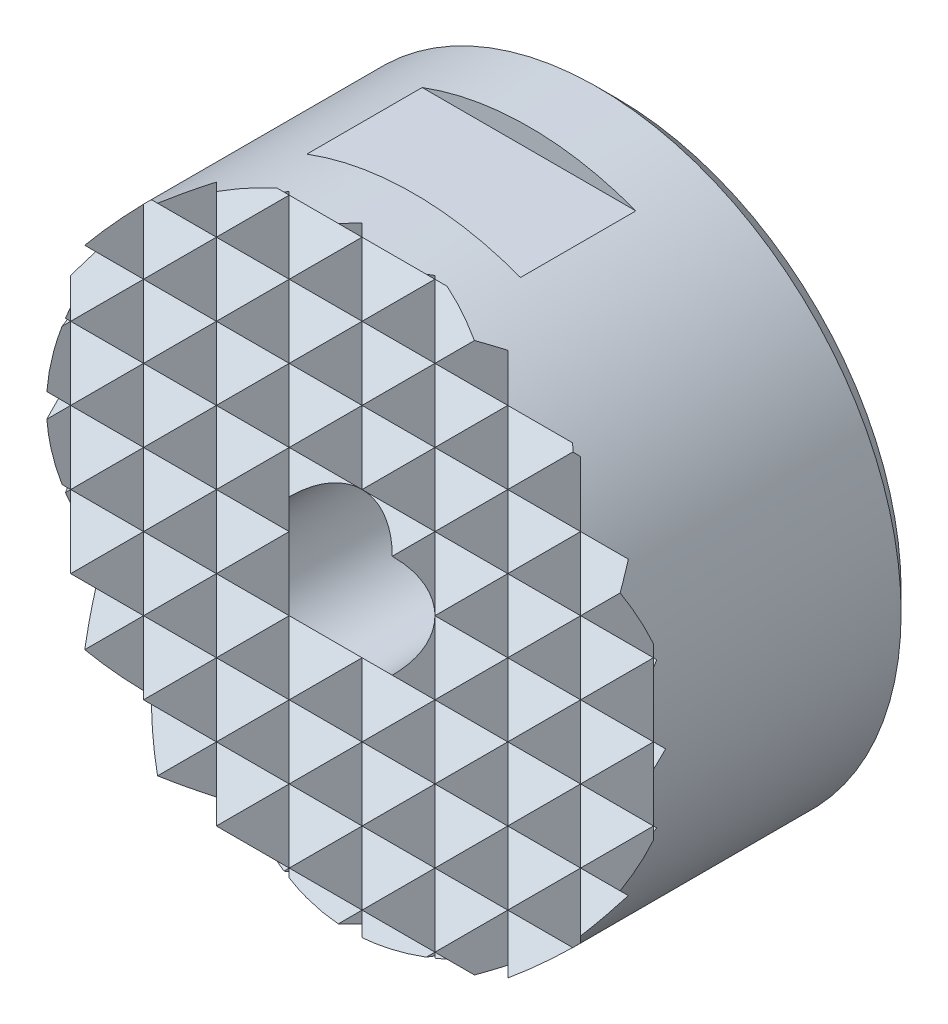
ISO-10303-21;
HEADER;
FILE_DESCRIPTION(('STEP AP214'),'2;1');
FILE_NAME('part.step','',(''),(''),'','','');
FILE_SCHEMA(('AUTOMOTIVE_DESIGN { 1 0 10303 214 1 1 1 1 }'));
ENDSEC;
DATA;
#1=APPLICATION_CONTEXT('core data for automotive mechanical design processes');
#2=APPLICATION_PROTOCOL_DEFINITION('international standard','automotive_design',2000,#1);
#3=PRODUCT_CONTEXT('',#1,'mechanical');
#4=PRODUCT('Part','Part','',(#3));
#5=PRODUCT_RELATED_PRODUCT_CATEGORY('part','',(#4));
#6=PRODUCT_DEFINITION_FORMATION('','',#4);
#7=PRODUCT_DEFINITION_CONTEXT('part definition',#1,'design');
#8=PRODUCT_DEFINITION('design','',#6,#7);
#9=PRODUCT_DEFINITION_SHAPE('','',#8);
#10=(LENGTH_UNIT() NAMED_UNIT(*) SI_UNIT(.MILLI.,.METRE.));
#11=(NAMED_UNIT(*) PLANE_ANGLE_UNIT() SI_UNIT($,.RADIAN.));
#12=(NAMED_UNIT(*) SI_UNIT($,.STERADIAN.) SOLID_ANGLE_UNIT());
#13=UNCERTAINTY_MEASURE_WITH_UNIT(LENGTH_MEASURE(1.E-05),#10,'distance_accuracy_value','');
#14=(GEOMETRIC_REPRESENTATION_CONTEXT(3) GLOBAL_UNCERTAINTY_ASSIGNED_CONTEXT((#13)) GLOBAL_UNIT_ASSIGNED_CONTEXT((#10,
#11,#12)) REPRESENTATION_CONTEXT('',''));
#15=CARTESIAN_POINT('',(0.,0.,0.));
#16=DIRECTION('',(0.,0.,1.));
#17=DIRECTION('',(1.,0.,0.));
#18=AXIS2_PLACEMENT_3D('',#15,#16,#17);
#19=CARTESIAN_POINT('',(-12.,-15.,10.5));
#20=DIRECTION('',(0.707106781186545,0.,-0.70710678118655));
#21=DIRECTION('',(-0.70710678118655,0.,-0.707106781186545));
#22=AXIS2_PLACEMENT_3D('',#19,#20,#21);
#23=PLANE('',#22);
#24=DIRECTION('',(0.577350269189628,0.577350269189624,0.577350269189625));
#25=VECTOR('',#24,1.);
#26=CARTESIAN_POINT('',(-18.,-2.99999999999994,4.5));
#27=LINE('',#26,#25);
#28=CARTESIAN_POINT('',(-12.,3.,10.5));
#29=VERTEX_POINT('',#28);
#30=CARTESIAN_POINT('',(-10.5,4.5,12.));
#31=VERTEX_POINT('',#30);
#32=EDGE_CURVE('E1385',#29,#31,#27,.T.);
#33=ORIENTED_EDGE('',*,*,#32,.T.);
#34=DIRECTION('',(-0.577350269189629,0.577350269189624,-0.577350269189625));
#35=VECTOR('',#34,1.);
#36=CARTESIAN_POINT('',(-5.,-0.999999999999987,17.5));
#37=LINE('',#36,#35);
#38=CARTESIAN_POINT('',(-11.3141445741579,5.31414457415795,11.185855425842));
#39=VERTEX_POINT('',#38);
#40=EDGE_CURVE('E1436',#31,#39,#37,.T.);
#41=ORIENTED_EDGE('',*,*,#40,.T.);
#42=CARTESIAN_POINT('',(0.,0.,22.5));
#43=DIRECTION('',(0.707106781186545,0.,-0.70710678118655));
#44=DIRECTION('',(-0.70710678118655,0.,-0.707106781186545));
#45=AXIS2_PLACEMENT_3D('',#42,#43,#44);
#46=ELLIPSE('',#45,17.6776695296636,12.5);
#47=CARTESIAN_POINT('',(-12.,3.50000000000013,10.5));
#48=VERTEX_POINT('',#47);
#49=EDGE_CURVE('E762',#48,#39,#46,.T.);
#50=ORIENTED_EDGE('',*,*,#49,.F.);
#51=DIRECTION('',(0.,1.,0.));
#52=VECTOR('',#51,1.);
#53=CARTESIAN_POINT('',(-12.,-15.,10.5));
#54=LINE('',#53,#52);
#55=EDGE_CURVE('E645',#29,#48,#54,.T.);
#56=ORIENTED_EDGE('',*,*,#55,.F.);
#57=EDGE_LOOP('',(#33,#41,#50,#56));
#58=FACE_BOUND('',#57,.T.);
#59=ADVANCED_FACE('F14',(#58),#23,.F.);
#60=DIRECTION('',(0.577350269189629,0.577350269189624,0.577350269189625));
#61=VECTOR('',#60,1.);
#62=CARTESIAN_POINT('',(-17.,-5.,5.5));
#63=LINE('',#62,#61);
#64=CARTESIAN_POINT('',(-12.,0.,10.5));
#65=VERTEX_POINT('',#64);
#66=CARTESIAN_POINT('',(-10.5,1.5,12.));
#67=VERTEX_POINT('',#66);
#68=EDGE_CURVE('E1304',#65,#67,#63,.T.);
#69=ORIENTED_EDGE('',*,*,#68,.T.);
#70=DIRECTION('',(-0.577350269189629,0.577350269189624,-0.577350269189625));
#71=VECTOR('',#70,1.);
#72=CARTESIAN_POINT('',(-6.,-3.,16.5));
#73=LINE('',#72,#71);
#74=EDGE_CURVE('E1338',#67,#29,#73,.T.);
#75=ORIENTED_EDGE('',*,*,#74,.T.);
#76=EDGE_CURVE('E1759',#65,#29,#54,.T.);
#77=ORIENTED_EDGE('',*,*,#76,.F.);
#78=EDGE_LOOP('',(#69,#75,#77));
#79=FACE_BOUND('',#78,.T.);
#80=ADVANCED_FACE('F2095',(#79),#23,.F.);
#81=DIRECTION('',(0.577350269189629,0.577350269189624,0.577350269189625));
#82=VECTOR('',#81,1.);
#83=CARTESIAN_POINT('',(-16.,-7.,6.5));
#84=LINE('',#83,#82);
#85=CARTESIAN_POINT('',(-12.,-3.,10.5));
#86=VERTEX_POINT('',#85);
#87=CARTESIAN_POINT('',(-10.5,-1.5,12.));
#88=VERTEX_POINT('',#87);
#89=EDGE_CURVE('E1211',#86,#88,#84,.T.);
#90=ORIENTED_EDGE('',*,*,#89,.T.);
#91=DIRECTION('',(-0.577350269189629,0.577350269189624,-0.577350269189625));
#92=VECTOR('',#91,1.);
#93=CARTESIAN_POINT('',(-7.,-5.,15.5));
#94=LINE('',#93,#92);
#95=EDGE_CURVE('E1263',#88,#65,#94,.T.);
#96=ORIENTED_EDGE('',*,*,#95,.T.);
#97=EDGE_CURVE('E700',#86,#65,#54,.T.);
#98=ORIENTED_EDGE('',*,*,#97,.F.);
#99=EDGE_LOOP('',(#90,#96,#98));
#100=FACE_BOUND('',#99,.T.);
#101=ADVANCED_FACE('F1757',(#100),#23,.F.);
#102=CARTESIAN_POINT('',(-10.5,-15.,12.));
#103=DIRECTION('',(-0.70710678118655,0.,-0.707106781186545));
#104=DIRECTION('',(-0.707106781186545,0.,0.70710678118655));
#105=AXIS2_PLACEMENT_3D('',#102,#103,#104);
#106=PLANE('',#105);
#107=CARTESIAN_POINT('',(0.,0.,1.5));
#108=DIRECTION('',(-0.70710678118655,0.,-0.707106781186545));
#109=DIRECTION('',(0.707106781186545,0.,-0.70710678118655));
#110=AXIS2_PLACEMENT_3D('',#107,#108,#109);
#111=ELLIPSE('',#110,17.6776695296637,12.5);
#112=CARTESIAN_POINT('',(-10.2106256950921,7.21062569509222,11.7106256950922));
#113=VERTEX_POINT('',#112);
#114=CARTESIAN_POINT('',(-9.,8.67467578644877,10.5));
#115=VERTEX_POINT('',#114);
#116=EDGE_CURVE('E763',#113,#115,#111,.T.);
#117=ORIENTED_EDGE('',*,*,#116,.F.);
#118=DIRECTION('',(0.577350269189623,-0.577350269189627,-0.577350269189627));
#119=VECTOR('',#118,1.);
#120=CARTESIAN_POINT('',(-2.99999999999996,0.,4.5));
#121=LINE('',#120,#119);
#122=CARTESIAN_POINT('',(-9.,6.,10.5));
#123=VERTEX_POINT('',#122);
#124=EDGE_CURVE('E1479',#113,#123,#121,.T.);
#125=ORIENTED_EDGE('',*,*,#124,.T.);
#126=DIRECTION('',(0.,1.,0.));
#127=VECTOR('',#126,1.);
#128=CARTESIAN_POINT('',(-9.,-15.,10.5));
#129=LINE('',#128,#127);
#130=EDGE_CURVE('E655',#123,#115,#129,.T.);
#131=ORIENTED_EDGE('',*,*,#130,.T.);
#132=EDGE_LOOP('',(#117,#125,#131));
#133=FACE_BOUND('',#132,.T.);
#134=ADVANCED_FACE('F1683',(#133),#106,.F.);
#135=CARTESIAN_POINT('',(-9.,-15.,10.5));
#136=DIRECTION('',(0.707106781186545,0.,-0.70710678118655));
#137=DIRECTION('',(-0.70710678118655,0.,-0.707106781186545));
#138=AXIS2_PLACEMENT_3D('',#135,#136,#137);
#139=PLANE('',#138);
#140=DIRECTION('',(0.577350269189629,0.577350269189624,0.577350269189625));
#141=VECTOR('',#140,1.);
#142=CARTESIAN_POINT('',(-16.,-0.999999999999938,3.50000000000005));
#143=LINE('',#142,#141);
#144=CARTESIAN_POINT('',(-7.5,7.5,12.));
#145=VERTEX_POINT('',#144);
#146=EDGE_CURVE('E1476',#123,#145,#143,.T.);
#147=ORIENTED_EDGE('',*,*,#146,.T.);
#148=DIRECTION('',(-0.577350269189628,0.577350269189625,-0.577350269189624));
#149=VECTOR('',#148,1.);
#150=CARTESIAN_POINT('',(-0.999999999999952,1.,18.5));
#151=LINE('',#150,#149);
#152=CARTESIAN_POINT('',(-8.83883476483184,8.83883476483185,10.6611652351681));
#153=VERTEX_POINT('',#152);
#154=EDGE_CURVE('E1516',#145,#153,#151,.T.);
#155=ORIENTED_EDGE('',*,*,#154,.T.);
#156=CARTESIAN_POINT('',(0.,0.,19.5));
#157=DIRECTION('',(0.707106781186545,0.,-0.70710678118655));
#158=DIRECTION('',(-0.70710678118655,0.,-0.707106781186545));
#159=AXIS2_PLACEMENT_3D('',#156,#157,#158);
#160=ELLIPSE('',#159,17.6776695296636,12.5);
#161=EDGE_CURVE('E768',#115,#153,#160,.T.);
#162=ORIENTED_EDGE('',*,*,#161,.F.);
#163=ORIENTED_EDGE('',*,*,#130,.F.);
#164=EDGE_LOOP('',(#147,#155,#162,#163));
#165=FACE_BOUND('',#164,.T.);
#166=ADVANCED_FACE('F1664',(#165),#139,.F.);
#167=CARTESIAN_POINT('',(-7.5,-15.,12.));
#168=DIRECTION('',(-0.70710678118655,0.,-0.707106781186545));
#169=DIRECTION('',(-0.707106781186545,0.,0.70710678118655));
#170=AXIS2_PLACEMENT_3D('',#167,#168,#169);
#171=PLANE('',#170);
#172=CARTESIAN_POINT('',(0.,0.,4.5));
#173=DIRECTION('',(-0.70710678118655,0.,-0.707106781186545));
#174=DIRECTION('',(0.707106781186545,0.,-0.70710678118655));
#175=AXIS2_PLACEMENT_3D('',#172,#173,#174);
#176=ELLIPSE('',#175,17.6776695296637,12.5);
#177=CARTESIAN_POINT('',(-7.21062569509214,10.2106256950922,11.7106256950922));
#178=VERTEX_POINT('',#177);
#179=CARTESIAN_POINT('',(-6.,10.9658560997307,10.5));
#180=VERTEX_POINT('',#179);
#181=EDGE_CURVE('E769',#178,#180,#176,.T.);
#182=ORIENTED_EDGE('',*,*,#181,.F.);
#183=DIRECTION('',(0.577350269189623,-0.577350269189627,-0.577350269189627));
#184=VECTOR('',#183,1.);
#185=CARTESIAN_POINT('',(1.00000000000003,2.,3.5));
#186=LINE('',#185,#184);
#187=CARTESIAN_POINT('',(-6.,9.,10.5));
#188=VERTEX_POINT('',#187);
#189=EDGE_CURVE('E1548',#178,#188,#186,.T.);
#190=ORIENTED_EDGE('',*,*,#189,.T.);
#191=DIRECTION('',(0.,1.,0.));
#192=VECTOR('',#191,1.);
#193=CARTESIAN_POINT('',(-6.,-15.,10.5));
#194=LINE('',#193,#192);
#195=EDGE_CURVE('E660',#188,#180,#194,.T.);
#196=ORIENTED_EDGE('',*,*,#195,.T.);
#197=EDGE_LOOP('',(#182,#190,#196));
#198=FACE_BOUND('',#197,.T.);
#199=ADVANCED_FACE('F1654',(#198),#171,.F.);
#200=CARTESIAN_POINT('',(-6.,-15.,10.5));
#201=DIRECTION('',(0.707106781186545,0.,-0.70710678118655));
#202=DIRECTION('',(-0.70710678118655,0.,-0.707106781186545));
#203=AXIS2_PLACEMENT_3D('',#200,#201,#202);
#204=PLANE('',#203);
#205=DIRECTION('',(0.577350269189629,0.577350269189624,0.577350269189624));
#206=VECTOR('',#205,1.);
#207=CARTESIAN_POINT('',(-14.,1.00000000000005,2.50000000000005));
#208=LINE('',#207,#206);
#209=CARTESIAN_POINT('',(-4.49999999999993,10.5,12.));
#210=VERTEX_POINT('',#209);
#211=EDGE_CURVE('E1545',#188,#210,#208,.T.);
#212=ORIENTED_EDGE('',*,*,#211,.T.);
#213=DIRECTION('',(-0.577350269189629,0.577350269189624,-0.577350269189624));
#214=VECTOR('',#213,1.);
#215=CARTESIAN_POINT('',(3.00000000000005,3.,19.5));
#216=LINE('',#215,#214);
#217=CARTESIAN_POINT('',(-5.31414457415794,11.3141445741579,11.185855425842));
#218=VERTEX_POINT('',#217);
#219=EDGE_CURVE('E642',#210,#218,#216,.T.);
#220=ORIENTED_EDGE('',*,*,#219,.T.);
#221=CARTESIAN_POINT('',(0.,0.,16.5));
#222=DIRECTION('',(0.707106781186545,0.,-0.70710678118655));
#223=DIRECTION('',(-0.70710678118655,0.,-0.707106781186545));
#224=AXIS2_PLACEMENT_3D('',#221,#222,#223);
#225=ELLIPSE('',#224,17.6776695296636,12.5);
#226=EDGE_CURVE('E640',#180,#218,#225,.T.);
#227=ORIENTED_EDGE('',*,*,#226,.F.);
#228=ORIENTED_EDGE('',*,*,#195,.F.);
#229=EDGE_LOOP('',(#212,#220,#227,#228));
#230=FACE_BOUND('',#229,.T.);
#231=ADVANCED_FACE('F1635',(#230),#204,.F.);
#232=CARTESIAN_POINT('',(4.5,-15.,12.));
#233=DIRECTION('',(-0.70710678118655,0.,-0.707106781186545));
#234=DIRECTION('',(-0.707106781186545,0.,0.707106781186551));
#235=AXIS2_PLACEMENT_3D('',#232,#233,#234);
#236=PLANE('',#235);
#237=CARTESIAN_POINT('',(0.,0.,16.5));
#238=DIRECTION('',(-0.70710678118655,0.,-0.707106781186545));
#239=DIRECTION('',(0.707106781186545,0.,-0.707106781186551));
#240=AXIS2_PLACEMENT_3D('',#237,#238,#239);
#241=ELLIPSE('',#240,17.6776695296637,12.5);
#242=CARTESIAN_POINT('',(5.31414457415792,11.314144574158,11.185855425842));
#243=VERTEX_POINT('',#242);
#244=CARTESIAN_POINT('',(6.,10.9658560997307,10.5));
#245=VERTEX_POINT('',#244);
#246=EDGE_CURVE('E774',#243,#245,#241,.T.);
#247=ORIENTED_EDGE('',*,*,#246,.F.);
#248=DIRECTION('',(-0.577350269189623,-0.577350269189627,0.577350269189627));
#249=VECTOR('',#248,1.);
#250=CARTESIAN_POINT('',(-4.,1.99999999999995,20.5));
#251=LINE('',#250,#249);
#252=CARTESIAN_POINT('',(4.5,10.5,12.));
#253=VERTEX_POINT('',#252);
#254=EDGE_CURVE('E646',#243,#253,#251,.T.);
#255=ORIENTED_EDGE('',*,*,#254,.T.);
#256=DIRECTION('',(0.577350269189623,-0.577350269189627,-0.577350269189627));
#257=VECTOR('',#256,1.);
#258=CARTESIAN_POINT('',(13.,1.99999999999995,3.49999999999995));
#259=LINE('',#258,#257);
#260=CARTESIAN_POINT('',(6.,9.,10.5));
#261=VERTEX_POINT('',#260);
#262=EDGE_CURVE('E1542',#253,#261,#259,.T.);
#263=ORIENTED_EDGE('',*,*,#262,.T.);
#264=DIRECTION('',(0.,1.,0.));
#265=VECTOR('',#264,1.);
#266=CARTESIAN_POINT('',(6.,-15.,10.5));
#267=LINE('',#266,#265);
#268=EDGE_CURVE('E686',#261,#245,#267,.T.);
#269=ORIENTED_EDGE('',*,*,#268,.T.);
#270=EDGE_LOOP('',(#247,#255,#263,#269));
#271=FACE_BOUND('',#270,.T.);
#272=ADVANCED_FACE('F1571',(#271),#236,.F.);
#273=CARTESIAN_POINT('',(6.,-15.,10.5));
#274=DIRECTION('',(0.707106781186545,0.,-0.707106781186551));
#275=DIRECTION('',(-0.707106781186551,0.,-0.707106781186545));
#276=AXIS2_PLACEMENT_3D('',#273,#274,#275);
#277=PLANE('',#276);
#278=ORIENTED_EDGE('',*,*,#268,.F.);
#279=DIRECTION('',(0.577350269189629,0.577350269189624,0.577350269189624));
#280=VECTOR('',#279,1.);
#281=CARTESIAN_POINT('',(-2.00000000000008,1.00000000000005,2.50000000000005));
#282=LINE('',#281,#280);
#283=CARTESIAN_POINT('',(7.21062569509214,10.2106256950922,11.7106256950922));
#284=VERTEX_POINT('',#283);
#285=EDGE_CURVE('E1554',#261,#284,#282,.T.);
#286=ORIENTED_EDGE('',*,*,#285,.T.);
#287=CARTESIAN_POINT('',(0.,0.,4.50000000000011));
#288=DIRECTION('',(0.707106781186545,0.,-0.707106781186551));
#289=DIRECTION('',(-0.707106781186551,0.,-0.707106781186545));
#290=AXIS2_PLACEMENT_3D('',#287,#288,#289);
#291=ELLIPSE('',#290,17.6776695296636,12.5);
#292=EDGE_CURVE('E779',#245,#284,#291,.T.);
#293=ORIENTED_EDGE('',*,*,#292,.F.);
#294=EDGE_LOOP('',(#278,#286,#293));
#295=FACE_BOUND('',#294,.T.);
#296=ADVANCED_FACE('F3232',(#295),#277,.F.);
#297=CARTESIAN_POINT('',(7.5,-15.,12.));
#298=DIRECTION('',(-0.707106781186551,0.,-0.707106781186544));
#299=DIRECTION('',(-0.707106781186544,0.,0.707106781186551));
#300=AXIS2_PLACEMENT_3D('',#297,#298,#299);
#301=PLANE('',#300);
#302=CARTESIAN_POINT('',(0.,0.,19.5));
#303=DIRECTION('',(-0.707106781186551,0.,-0.707106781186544));
#304=DIRECTION('',(0.707106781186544,0.,-0.707106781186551));
#305=AXIS2_PLACEMENT_3D('',#302,#303,#304);
#306=ELLIPSE('',#305,17.6776695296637,12.5);
#307=CARTESIAN_POINT('',(8.83883476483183,8.83883476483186,10.6611652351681));
#308=VERTEX_POINT('',#307);
#309=CARTESIAN_POINT('',(9.,8.67467578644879,10.5));
#310=VERTEX_POINT('',#309);
#311=EDGE_CURVE('E780',#308,#310,#306,.T.);
#312=ORIENTED_EDGE('',*,*,#311,.F.);
#313=DIRECTION('',(-0.577350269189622,-0.577350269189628,0.577350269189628));
#314=VECTOR('',#313,1.);
#315=CARTESIAN_POINT('',(0.,0.,19.5));
#316=LINE('',#315,#314);
#317=CARTESIAN_POINT('',(7.5,7.5,12.));
#318=VERTEX_POINT('',#317);
#319=EDGE_CURVE('E1526',#308,#318,#316,.T.);
#320=ORIENTED_EDGE('',*,*,#319,.T.);
#321=DIRECTION('',(0.577350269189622,-0.577350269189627,-0.577350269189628));
#322=VECTOR('',#321,1.);
#323=CARTESIAN_POINT('',(15.,0.,4.49999999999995));
#324=LINE('',#323,#322);
#325=CARTESIAN_POINT('',(9.,6.,10.5));
#326=VERTEX_POINT('',#325);
#327=EDGE_CURVE('E1489',#318,#326,#324,.T.);
#328=ORIENTED_EDGE('',*,*,#327,.T.);
#329=DIRECTION('',(0.,1.,0.));
#330=VECTOR('',#329,1.);
#331=CARTESIAN_POINT('',(9.,-15.,10.5));
#332=LINE('',#331,#330);
#333=EDGE_CURVE('E691',#326,#310,#332,.T.);
#334=ORIENTED_EDGE('',*,*,#333,.T.);
#335=EDGE_LOOP('',(#312,#320,#328,#334));
#336=FACE_BOUND('',#335,.T.);
#337=ADVANCED_FACE('F3038',(#336),#301,.F.);
#338=CARTESIAN_POINT('',(9.,-15.,10.5));
#339=DIRECTION('',(0.707106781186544,0.,-0.707106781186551));
#340=DIRECTION('',(-0.707106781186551,0.,-0.707106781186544));
#341=AXIS2_PLACEMENT_3D('',#338,#339,#340);
#342=PLANE('',#341);
#343=ORIENTED_EDGE('',*,*,#333,.F.);
#344=DIRECTION('',(0.577350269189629,0.577350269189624,0.577350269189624));
#345=VECTOR('',#344,1.);
#346=CARTESIAN_POINT('',(1.99999999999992,-0.999999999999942,3.50000000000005));
#347=LINE('',#346,#345);
#348=CARTESIAN_POINT('',(10.2106256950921,7.21062569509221,11.7106256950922));
#349=VERTEX_POINT('',#348);
#350=EDGE_CURVE('E1492',#326,#349,#347,.T.);
#351=ORIENTED_EDGE('',*,*,#350,.T.);
#352=CARTESIAN_POINT('',(0.,0.,1.50000000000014));
#353=DIRECTION('',(0.707106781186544,0.,-0.707106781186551));
#354=DIRECTION('',(-0.707106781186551,0.,-0.707106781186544));
#355=AXIS2_PLACEMENT_3D('',#352,#353,#354);
#356=ELLIPSE('',#355,17.6776695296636,12.5);
#357=EDGE_CURVE('E785',#310,#349,#356,.T.);
#358=ORIENTED_EDGE('',*,*,#357,.F.);
#359=EDGE_LOOP('',(#343,#351,#358));
#360=FACE_BOUND('',#359,.T.);
#361=ADVANCED_FACE('F3028',(#360),#342,.F.);
#362=CARTESIAN_POINT('',(10.5,-15.,12.));
#363=DIRECTION('',(-0.707106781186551,0.,-0.707106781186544));
#364=DIRECTION('',(-0.707106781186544,0.,0.707106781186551));
#365=AXIS2_PLACEMENT_3D('',#362,#363,#364);
#366=PLANE('',#365);
#367=CARTESIAN_POINT('',(0.,0.,22.5));
#368=DIRECTION('',(-0.707106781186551,0.,-0.707106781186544));
#369=DIRECTION('',(0.707106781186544,0.,-0.707106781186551));
#370=AXIS2_PLACEMENT_3D('',#367,#368,#369);
#371=ELLIPSE('',#370,17.6776695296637,12.5);
#372=CARTESIAN_POINT('',(11.3141445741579,5.31414457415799,11.185855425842));
#373=VERTEX_POINT('',#372);
#374=CARTESIAN_POINT('',(12.,3.50000000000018,10.5));
#375=VERTEX_POINT('',#374);
#376=EDGE_CURVE('E786',#373,#375,#371,.T.);
#377=ORIENTED_EDGE('',*,*,#376,.F.);
#378=DIRECTION('',(-0.577350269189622,-0.577350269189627,0.577350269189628));
#379=VECTOR('',#378,1.);
#380=CARTESIAN_POINT('',(4.,-2.00000000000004,18.5));
#381=LINE('',#380,#379);
#382=CARTESIAN_POINT('',(10.5,4.5,12.));
#383=VERTEX_POINT('',#382);
#384=EDGE_CURVE('E1451',#373,#383,#381,.T.);
#385=ORIENTED_EDGE('',*,*,#384,.T.);
#386=DIRECTION('',(0.577350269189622,-0.577350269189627,-0.577350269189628));
#387=VECTOR('',#386,1.);
#388=CARTESIAN_POINT('',(17.,-2.00000000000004,5.5));
#389=LINE('',#388,#387);
#390=CARTESIAN_POINT('',(12.,3.,10.5));
#391=VERTEX_POINT('',#390);
#392=EDGE_CURVE('E1404',#383,#391,#389,.T.);
#393=ORIENTED_EDGE('',*,*,#392,.T.);
#394=DIRECTION('',(0.,1.,0.));
#395=VECTOR('',#394,1.);
#396=CARTESIAN_POINT('',(12.,-15.,10.5));
#397=LINE('',#396,#395);
#398=EDGE_CURVE('E696',#391,#375,#397,.T.);
#399=ORIENTED_EDGE('',*,*,#398,.T.);
#400=EDGE_LOOP('',(#377,#385,#393,#399));
#401=FACE_BOUND('',#400,.T.);
#402=ADVANCED_FACE('F1928',(#401),#366,.F.);
#403=CARTESIAN_POINT('',(12.,0.,10.5));
#404=VERTEX_POINT('',#403);
#405=EDGE_CURVE('E1919',#404,#391,#397,.T.);
#406=ORIENTED_EDGE('',*,*,#405,.T.);
#407=DIRECTION('',(-0.577350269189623,-0.577350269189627,0.577350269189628));
#408=VECTOR('',#407,1.);
#409=CARTESIAN_POINT('',(5.,-4.,17.5));
#410=LINE('',#409,#408);
#411=CARTESIAN_POINT('',(10.5,1.5,12.));
#412=VERTEX_POINT('',#411);
#413=EDGE_CURVE('E1353',#391,#412,#410,.T.);
#414=ORIENTED_EDGE('',*,*,#413,.T.);
#415=DIRECTION('',(0.577350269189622,-0.577350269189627,-0.577350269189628));
#416=VECTOR('',#415,1.);
#417=CARTESIAN_POINT('',(16.,-4.,6.5));
#418=LINE('',#417,#416);
#419=EDGE_CURVE('E1281',#412,#404,#418,.T.);
#420=ORIENTED_EDGE('',*,*,#419,.T.);
#421=EDGE_LOOP('',(#406,#414,#420));
#422=FACE_BOUND('',#421,.T.);
#423=ADVANCED_FACE('F1947',(#422),#366,.F.);
#424=CARTESIAN_POINT('',(12.,-3.,10.5));
#425=VERTEX_POINT('',#424);
#426=EDGE_CURVE('E695',#425,#404,#397,.T.);
#427=ORIENTED_EDGE('',*,*,#426,.T.);
#428=DIRECTION('',(-0.577350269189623,-0.577350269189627,0.577350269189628));
#429=VECTOR('',#428,1.);
#430=CARTESIAN_POINT('',(6.,-6.,16.5));
#431=LINE('',#430,#429);
#432=CARTESIAN_POINT('',(10.5,-1.5,12.));
#433=VERTEX_POINT('',#432);
#434=EDGE_CURVE('E1241',#404,#433,#431,.T.);
#435=ORIENTED_EDGE('',*,*,#434,.T.);
#436=DIRECTION('',(0.577350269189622,-0.577350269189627,-0.577350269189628));
#437=VECTOR('',#436,1.);
#438=CARTESIAN_POINT('',(15.,-6.,7.5));
#439=LINE('',#438,#437);
#440=EDGE_CURVE('E1223',#433,#425,#439,.T.);
#441=ORIENTED_EDGE('',*,*,#440,.T.);
#442=EDGE_LOOP('',(#427,#435,#441));
#443=FACE_BOUND('',#442,.T.);
#444=ADVANCED_FACE('F1912',(#443),#366,.F.);
#445=CARTESIAN_POINT('',(12.,-15.,10.5));
#446=DIRECTION('',(0.707106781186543,0.,-0.707106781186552));
#447=DIRECTION('',(-0.707106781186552,0.,-0.707106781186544));
#448=AXIS2_PLACEMENT_3D('',#445,#446,#447);
#449=PLANE('',#448);
#450=ORIENTED_EDGE('',*,*,#398,.F.);
#451=DIRECTION('',(0.57735026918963,0.577350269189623,0.577350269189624));
#452=VECTOR('',#451,1.);
#453=CARTESIAN_POINT('',(5.99999999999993,-2.99999999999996,4.5));
#454=LINE('',#453,#452);
#455=CARTESIAN_POINT('',(12.1075620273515,3.1075620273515,10.6075620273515));
#456=VERTEX_POINT('',#455);
#457=EDGE_CURVE('E1407',#391,#456,#454,.T.);
#458=ORIENTED_EDGE('',*,*,#457,.T.);
#459=CARTESIAN_POINT('',(0.,0.,-1.49999999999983));
#460=DIRECTION('',(0.707106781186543,0.,-0.707106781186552));
#461=DIRECTION('',(-0.707106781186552,0.,-0.707106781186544));
#462=AXIS2_PLACEMENT_3D('',#459,#460,#461);
#463=ELLIPSE('',#462,17.6776695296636,12.5);
#464=EDGE_CURVE('E789',#375,#456,#463,.T.);
#465=ORIENTED_EDGE('',*,*,#464,.F.);
#466=EDGE_LOOP('',(#450,#458,#465));
#467=FACE_BOUND('',#466,.T.);
#468=ADVANCED_FACE('F1931',(#467),#449,.F.);
#469=CARTESIAN_POINT('',(12.1770717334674,2.82292826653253,10.6770717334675));
#470=VERTEX_POINT('',#469);
#471=CARTESIAN_POINT('',(12.4903774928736,0.490377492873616,10.9903774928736));
#472=VERTEX_POINT('',#471);
#473=EDGE_CURVE('E793',#470,#472,#463,.T.);
#474=ORIENTED_EDGE('',*,*,#473,.F.);
#475=DIRECTION('',(-0.577350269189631,0.577350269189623,-0.577350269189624));
#476=VECTOR('',#475,1.);
#477=CARTESIAN_POINT('',(18.,-2.99999999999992,16.5));
#478=LINE('',#477,#476);
#479=EDGE_CURVE('E1355',#470,#391,#478,.T.);
#480=ORIENTED_EDGE('',*,*,#479,.T.);
#481=ORIENTED_EDGE('',*,*,#405,.F.);
#482=DIRECTION('',(0.57735026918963,0.577350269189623,0.577350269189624));
#483=VECTOR('',#482,1.);
#484=CARTESIAN_POINT('',(7.,-5.,5.5));
#485=LINE('',#484,#483);
#486=EDGE_CURVE('E1284',#404,#472,#485,.T.);
#487=ORIENTED_EDGE('',*,*,#486,.T.);
#488=EDGE_LOOP('',(#474,#480,#481,#487));
#489=FACE_BOUND('',#488,.T.);
#490=ADVANCED_FACE('F4089',(#489),#449,.F.);
#491=CARTESIAN_POINT('',(12.4903774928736,-0.490377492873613,10.9903774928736));
#492=VERTEX_POINT('',#491);
#493=CARTESIAN_POINT('',(12.1770717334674,-2.82292826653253,10.6770717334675));
#494=VERTEX_POINT('',#493);
#495=EDGE_CURVE('E4420',#492,#494,#463,.T.);
#496=ORIENTED_EDGE('',*,*,#495,.F.);
#497=DIRECTION('',(-0.577350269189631,0.577350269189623,-0.577350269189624));
#498=VECTOR('',#497,1.);
#499=CARTESIAN_POINT('',(17.,-4.99999999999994,15.5));
#500=LINE('',#499,#498);
#501=EDGE_CURVE('E1243',#492,#404,#500,.T.);
#502=ORIENTED_EDGE('',*,*,#501,.T.);
#503=ORIENTED_EDGE('',*,*,#426,.F.);
#504=DIRECTION('',(0.57735026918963,0.577350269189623,0.577350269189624));
#505=VECTOR('',#504,1.);
#506=CARTESIAN_POINT('',(8.,-7.,6.5));
#507=LINE('',#506,#505);
#508=EDGE_CURVE('E1227',#425,#494,#507,.T.);
#509=ORIENTED_EDGE('',*,*,#508,.T.);
#510=EDGE_LOOP('',(#496,#502,#503,#509));
#511=FACE_BOUND('',#510,.T.);
#512=ADVANCED_FACE('F1916',(#511),#449,.F.);
#513=CARTESIAN_POINT('',(-13.5,-15.,12.));
#514=DIRECTION('',(-0.70710678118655,0.,-0.707106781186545));
#515=DIRECTION('',(-0.707106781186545,0.,0.70710678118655));
#516=AXIS2_PLACEMENT_3D('',#513,#514,#515);
#517=PLANE('',#516);
#518=CARTESIAN_POINT('',(0.,0.,-1.50000000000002));
#519=DIRECTION('',(-0.70710678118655,0.,-0.707106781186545));
#520=DIRECTION('',(0.707106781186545,0.,-0.70710678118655));
#521=AXIS2_PLACEMENT_3D('',#518,#519,#520);
#522=ELLIPSE('',#521,17.6776695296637,12.5);
#523=CARTESIAN_POINT('',(-12.1075620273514,3.10756202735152,10.6075620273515));
#524=VERTEX_POINT('',#523);
#525=EDGE_CURVE('E760',#524,#48,#522,.T.);
#526=ORIENTED_EDGE('',*,*,#525,.F.);
#527=DIRECTION('',(0.577350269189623,-0.577350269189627,-0.577350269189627));
#528=VECTOR('',#527,1.);
#529=CARTESIAN_POINT('',(-7.,-2.,5.5));
#530=LINE('',#529,#528);
#531=EDGE_CURVE('E1388',#524,#29,#530,.T.);
#532=ORIENTED_EDGE('',*,*,#531,.T.);
#533=ORIENTED_EDGE('',*,*,#55,.T.);
#534=EDGE_LOOP('',(#526,#532,#533));
#535=FACE_BOUND('',#534,.T.);
#536=ADVANCED_FACE('F3735',(#535),#517,.F.);
#537=ORIENTED_EDGE('',*,*,#76,.T.);
#538=DIRECTION('',(-0.577350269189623,-0.577350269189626,0.577350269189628));
#539=VECTOR('',#538,1.);
#540=CARTESIAN_POINT('',(-19.,-4.,17.5));
#541=LINE('',#540,#539);
#542=CARTESIAN_POINT('',(-12.1770717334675,2.82292826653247,10.6770717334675));
#543=VERTEX_POINT('',#542);
#544=EDGE_CURVE('E1341',#29,#543,#541,.T.);
#545=ORIENTED_EDGE('',*,*,#544,.T.);
#546=CARTESIAN_POINT('',(-12.4903774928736,0.49037749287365,10.9903774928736));
#547=VERTEX_POINT('',#546);
#548=EDGE_CURVE('E4470',#547,#543,#522,.T.);
#549=ORIENTED_EDGE('',*,*,#548,.F.);
#550=DIRECTION('',(0.577350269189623,-0.577350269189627,-0.577350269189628));
#551=VECTOR('',#550,1.);
#552=CARTESIAN_POINT('',(-8.,-4.,6.5));
#553=LINE('',#552,#551);
#554=EDGE_CURVE('E1307',#547,#65,#553,.T.);
#555=ORIENTED_EDGE('',*,*,#554,.T.);
#556=EDGE_LOOP('',(#537,#545,#549,#555));
#557=FACE_BOUND('',#556,.T.);
#558=ADVANCED_FACE('F4068',(#557),#517,.F.);
#559=ORIENTED_EDGE('',*,*,#97,.T.);
#560=DIRECTION('',(-0.577350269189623,-0.577350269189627,0.577350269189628));
#561=VECTOR('',#560,1.);
#562=CARTESIAN_POINT('',(-18.,-6.,16.5));
#563=LINE('',#562,#561);
#564=CARTESIAN_POINT('',(-12.4903774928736,-0.490377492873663,10.9903774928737));
#565=VERTEX_POINT('',#564);
#566=EDGE_CURVE('E1266',#65,#565,#563,.T.);
#567=ORIENTED_EDGE('',*,*,#566,.T.);
#568=CARTESIAN_POINT('',(-12.1770717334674,-2.82292826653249,10.6770717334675));
#569=VERTEX_POINT('',#568);
#570=EDGE_CURVE('E759',#569,#565,#522,.T.);
#571=ORIENTED_EDGE('',*,*,#570,.F.);
#572=DIRECTION('',(0.577350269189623,-0.577350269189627,-0.577350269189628));
#573=VECTOR('',#572,1.);
#574=CARTESIAN_POINT('',(-9.,-6.,7.5));
#575=LINE('',#574,#573);
#576=EDGE_CURVE('E1214',#569,#86,#575,.T.);
#577=ORIENTED_EDGE('',*,*,#576,.T.);
#578=EDGE_LOOP('',(#559,#567,#571,#577));
#579=FACE_BOUND('',#578,.T.);
#580=ADVANCED_FACE('F1761',(#579),#517,.F.);
#581=CARTESIAN_POINT('',(-4.49999999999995,-15.,12.));
#582=DIRECTION('',(-0.70710678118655,0.,-0.707106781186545));
#583=DIRECTION('',(-0.707106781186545,0.,0.70710678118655));
#584=AXIS2_PLACEMENT_3D('',#581,#582,#583);
#585=PLANE('',#584);
#586=DIRECTION('',(0.,1.,0.));
#587=VECTOR('',#586,1.);
#588=CARTESIAN_POINT('',(-2.99999999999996,-15.,10.5));
#589=LINE('',#588,#587);
#590=CARTESIAN_POINT('',(-2.99999999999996,-12.1346610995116,10.5));
#591=VERTEX_POINT('',#590);
#592=CARTESIAN_POINT('',(-3.,-12.,10.5));
#593=VERTEX_POINT('',#592);
#594=EDGE_CURVE('E667',#591,#593,#589,.T.);
#595=ORIENTED_EDGE('',*,*,#594,.T.);
#596=DIRECTION('',(-0.577350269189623,-0.577350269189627,0.577350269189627));
#597=VECTOR('',#596,1.);
#598=CARTESIAN_POINT('',(-5.,-14.,12.5));
#599=LINE('',#598,#597);
#600=CARTESIAN_POINT('',(-3.10756202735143,-12.1075620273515,10.6075620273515));
#601=VERTEX_POINT('',#600);
#602=EDGE_CURVE('E954',#593,#601,#599,.T.);
#603=ORIENTED_EDGE('',*,*,#602,.T.);
#604=CARTESIAN_POINT('',(0.,0.,7.5));
#605=DIRECTION('',(-0.70710678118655,0.,-0.707106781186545));
#606=DIRECTION('',(0.707106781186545,0.,-0.70710678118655));
#607=AXIS2_PLACEMENT_3D('',#604,#605,#606);
#608=ELLIPSE('',#607,17.6776695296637,12.5);
#609=EDGE_CURVE('E717',#591,#601,#608,.T.);
#610=ORIENTED_EDGE('',*,*,#609,.F.);
#611=EDGE_LOOP('',(#595,#603,#610));
#612=FACE_BOUND('',#611,.T.);
#613=ADVANCED_FACE('F2576',(#612),#585,.F.);
#614=DIRECTION('',(-0.577350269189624,-0.577350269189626,0.577350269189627));
#615=VECTOR('',#614,1.);
#616=CARTESIAN_POINT('',(-9.,-6.,16.5));
#617=LINE('',#616,#615);
#618=CARTESIAN_POINT('',(-3.,0.,10.5));
#619=VERTEX_POINT('',#618);
#620=CARTESIAN_POINT('',(-4.49999999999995,-1.49999999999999,12.));
#621=VERTEX_POINT('',#620);
#622=EDGE_CURVE('E1249',#619,#621,#617,.T.);
#623=ORIENTED_EDGE('',*,*,#622,.T.);
#624=DIRECTION('',(0.577350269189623,-0.577350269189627,-0.577350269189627));
#625=VECTOR('',#624,1.);
#626=CARTESIAN_POINT('',(0.,-6.,7.5));
#627=LINE('',#626,#625);
#628=CARTESIAN_POINT('',(-2.99999999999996,-3.,10.5));
#629=VERTEX_POINT('',#628);
#630=EDGE_CURVE('E1193',#621,#629,#627,.T.);
#631=ORIENTED_EDGE('',*,*,#630,.T.);
#632=EDGE_CURVE('E664',#629,#619,#589,.T.);
#633=ORIENTED_EDGE('',*,*,#632,.T.);
#634=EDGE_LOOP('',(#623,#631,#633));
#635=FACE_BOUND('',#634,.T.);
#636=ADVANCED_FACE('F2278',(#635),#585,.F.);
#637=DIRECTION('',(-0.577350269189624,-0.577350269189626,0.577350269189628));
#638=VECTOR('',#637,1.);
#639=CARTESIAN_POINT('',(-10.,-4.,17.5));
#640=LINE('',#639,#638);
#641=CARTESIAN_POINT('',(-3.,3.,10.5));
#642=VERTEX_POINT('',#641);
#643=CARTESIAN_POINT('',(-4.49999999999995,1.5,12.));
#644=VERTEX_POINT('',#643);
#645=EDGE_CURVE('E1322',#642,#644,#640,.T.);
#646=ORIENTED_EDGE('',*,*,#645,.T.);
#647=DIRECTION('',(0.577350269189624,-0.577350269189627,-0.577350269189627));
#648=VECTOR('',#647,1.);
#649=CARTESIAN_POINT('',(1.00000000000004,-4.,6.5));
#650=LINE('',#649,#648);
#651=EDGE_CURVE('E1290',#644,#619,#650,.T.);
#652=ORIENTED_EDGE('',*,*,#651,.T.);
#653=EDGE_CURVE('E661',#619,#642,#589,.T.);
#654=ORIENTED_EDGE('',*,*,#653,.T.);
#655=EDGE_LOOP('',(#646,#652,#654));
#656=FACE_BOUND('',#655,.T.);
#657=ADVANCED_FACE('F2628',(#656),#585,.F.);
#658=CARTESIAN_POINT('',(-2.99999999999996,-15.,10.5));
#659=DIRECTION('',(0.707106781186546,0.,-0.707106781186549));
#660=DIRECTION('',(-0.707106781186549,0.,-0.707106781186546));
#661=AXIS2_PLACEMENT_3D('',#658,#659,#660);
#662=PLANE('',#661);
#663=CARTESIAN_POINT('',(0.,0.,13.5));
#664=DIRECTION('',(0.707106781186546,0.,-0.707106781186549));
#665=DIRECTION('',(0.707106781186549,0.,0.707106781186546));
#666=AXIS2_PLACEMENT_3D('',#663,#664,#665);
#667=ELLIPSE('',#666,4.24264068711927,3.);
#668=CARTESIAN_POINT('',(-2.12132034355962,2.12132034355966,11.3786796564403));
#669=VERTEX_POINT('',#668);
#670=EDGE_CURVE('E751',#619,#669,#667,.T.);
#671=ORIENTED_EDGE('',*,*,#670,.T.);
#672=DIRECTION('',(-0.577350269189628,0.577350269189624,-0.577350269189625));
#673=VECTOR('',#672,1.);
#674=CARTESIAN_POINT('',(3.00000000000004,-3.,16.5));
#675=LINE('',#674,#673);
#676=EDGE_CURVE('E1319',#669,#642,#675,.T.);
#677=ORIENTED_EDGE('',*,*,#676,.T.);
#678=ORIENTED_EDGE('',*,*,#653,.F.);
#679=EDGE_LOOP('',(#671,#677,#678));
#680=FACE_BOUND('',#679,.T.);
#681=ADVANCED_FACE('F2618',(#680),#662,.F.);
#682=ORIENTED_EDGE('',*,*,#632,.F.);
#683=DIRECTION('',(0.577350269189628,0.577350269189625,0.577350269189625));
#684=VECTOR('',#683,1.);
#685=CARTESIAN_POINT('',(-7.,-7.,6.5));
#686=LINE('',#685,#684);
#687=CARTESIAN_POINT('',(-2.12132034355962,-2.12132034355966,11.3786796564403));
#688=VERTEX_POINT('',#687);
#689=EDGE_CURVE('E1190',#629,#688,#686,.T.);
#690=ORIENTED_EDGE('',*,*,#689,.T.);
#691=EDGE_CURVE('E754',#688,#619,#667,.T.);
#692=ORIENTED_EDGE('',*,*,#691,.T.);
#693=EDGE_LOOP('',(#682,#690,#692));
#694=FACE_BOUND('',#693,.T.);
#695=ADVANCED_FACE('F2280',(#694),#662,.F.);
#696=CARTESIAN_POINT('',(1.5,-15.,12.));
#697=DIRECTION('',(-0.70710678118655,0.,-0.707106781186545));
#698=DIRECTION('',(-0.707106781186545,0.,0.70710678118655));
#699=AXIS2_PLACEMENT_3D('',#696,#697,#698);
#700=PLANE('',#699);
#701=CARTESIAN_POINT('',(0.,0.,13.5));
#702=DIRECTION('',(-0.70710678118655,0.,-0.707106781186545));
#703=DIRECTION('',(-0.707106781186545,0.,0.70710678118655));
#704=AXIS2_PLACEMENT_3D('',#701,#702,#703);
#705=ELLIPSE('',#704,4.2426406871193,3.);
#706=CARTESIAN_POINT('',(2.99999999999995,0.,10.5));
#707=VERTEX_POINT('',#706);
#708=CARTESIAN_POINT('',(2.12132034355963,-2.12132034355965,11.3786796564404));
#709=VERTEX_POINT('',#708);
#710=EDGE_CURVE('E747',#707,#709,#705,.T.);
#711=ORIENTED_EDGE('',*,*,#710,.T.);
#712=DIRECTION('',(0.577350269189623,-0.577350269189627,-0.577350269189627));
#713=VECTOR('',#712,1.);
#714=CARTESIAN_POINT('',(6.,-6.,7.5));
#715=LINE('',#714,#713);
#716=CARTESIAN_POINT('',(2.99999999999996,-3.,10.5));
#717=VERTEX_POINT('',#716);
#718=EDGE_CURVE('E1177',#709,#717,#715,.T.);
#719=ORIENTED_EDGE('',*,*,#718,.T.);
#720=DIRECTION('',(0.,1.,0.));
#721=VECTOR('',#720,1.);
#722=CARTESIAN_POINT('',(3.,-15.,10.5));
#723=LINE('',#722,#721);
#724=EDGE_CURVE('E678',#717,#707,#723,.T.);
#725=ORIENTED_EDGE('',*,*,#724,.T.);
#726=EDGE_LOOP('',(#711,#719,#725));
#727=FACE_BOUND('',#726,.T.);
#728=ADVANCED_FACE('F1990',(#727),#700,.F.);
#729=CARTESIAN_POINT('',(2.99999999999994,3.,10.5));
#730=VERTEX_POINT('',#729);
#731=EDGE_CURVE('E675',#707,#730,#723,.T.);
#732=ORIENTED_EDGE('',*,*,#731,.T.);
#733=DIRECTION('',(-0.577350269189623,-0.577350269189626,0.577350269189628));
#734=VECTOR('',#733,1.);
#735=CARTESIAN_POINT('',(-4.,-4.,17.5));
#736=LINE('',#735,#734);
#737=CARTESIAN_POINT('',(2.12132034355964,2.12132034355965,11.3786796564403));
#738=VERTEX_POINT('',#737);
#739=EDGE_CURVE('E1310',#730,#738,#736,.T.);
#740=ORIENTED_EDGE('',*,*,#739,.T.);
#741=EDGE_CURVE('E750',#738,#707,#705,.T.);
#742=ORIENTED_EDGE('',*,*,#741,.T.);
#743=EDGE_LOOP('',(#732,#740,#742));
#744=FACE_BOUND('',#743,.T.);
#745=ADVANCED_FACE('F3821',(#744),#700,.F.);
#746=CARTESIAN_POINT('',(3.,-15.,10.5));
#747=DIRECTION('',(0.707106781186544,0.,-0.707106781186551));
#748=DIRECTION('',(-0.707106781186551,0.,-0.707106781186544));
#749=AXIS2_PLACEMENT_3D('',#746,#747,#748);
#750=PLANE('',#749);
#751=CARTESIAN_POINT('',(0.,0.,7.5));
#752=DIRECTION('',(0.707106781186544,0.,-0.707106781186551));
#753=DIRECTION('',(-0.707106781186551,0.,-0.707106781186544));
#754=AXIS2_PLACEMENT_3D('',#751,#752,#753);
#755=ELLIPSE('',#754,17.6776695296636,12.5);
#756=CARTESIAN_POINT('',(3.10756202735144,-12.1075620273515,10.6075620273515));
#757=VERTEX_POINT('',#756);
#758=CARTESIAN_POINT('',(3.,-12.1346610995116,10.5));
#759=VERTEX_POINT('',#758);
#760=EDGE_CURVE('E653',#757,#759,#755,.T.);
#761=ORIENTED_EDGE('',*,*,#760,.F.);
#762=DIRECTION('',(-0.577350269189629,0.577350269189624,-0.577350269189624));
#763=VECTOR('',#762,1.);
#764=CARTESIAN_POINT('',(4.,-13.,11.5));
#765=LINE('',#764,#763);
#766=CARTESIAN_POINT('',(2.99999999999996,-12.,10.5));
#767=VERTEX_POINT('',#766);
#768=EDGE_CURVE('E9',#757,#767,#765,.T.);
#769=ORIENTED_EDGE('',*,*,#768,.T.);
#770=EDGE_CURVE('E680',#759,#767,#723,.T.);
#771=ORIENTED_EDGE('',*,*,#770,.F.);
#772=EDGE_LOOP('',(#761,#769,#771));
#773=FACE_BOUND('',#772,.T.);
#774=ADVANCED_FACE('F884',(#773),#750,.F.);
#775=ORIENTED_EDGE('',*,*,#724,.F.);
#776=DIRECTION('',(0.577350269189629,0.577350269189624,0.577350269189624));
#777=VECTOR('',#776,1.);
#778=CARTESIAN_POINT('',(-1.00000000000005,-7.,6.5));
#779=LINE('',#778,#777);
#780=CARTESIAN_POINT('',(4.5,-1.5,12.));
#781=VERTEX_POINT('',#780);
#782=EDGE_CURVE('E824',#717,#781,#779,.T.);
#783=ORIENTED_EDGE('',*,*,#782,.T.);
#784=DIRECTION('',(-0.57735026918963,0.577350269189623,-0.577350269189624));
#785=VECTOR('',#784,1.);
#786=CARTESIAN_POINT('',(8.,-5.,15.5));
#787=LINE('',#786,#785);
#788=EDGE_CURVE('E821',#781,#707,#787,.T.);
#789=ORIENTED_EDGE('',*,*,#788,.T.);
#790=EDGE_LOOP('',(#775,#783,#789));
#791=FACE_BOUND('',#790,.T.);
#792=ADVANCED_FACE('F1985',(#791),#750,.F.);
#793=ORIENTED_EDGE('',*,*,#731,.F.);
#794=DIRECTION('',(0.577350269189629,0.577350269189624,0.577350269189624));
#795=VECTOR('',#794,1.);
#796=CARTESIAN_POINT('',(-2.00000000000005,-5.,5.5));
#797=LINE('',#796,#795);
#798=CARTESIAN_POINT('',(4.5,1.5,12.));
#799=VERTEX_POINT('',#798);
#800=EDGE_CURVE('E818',#707,#799,#797,.T.);
#801=ORIENTED_EDGE('',*,*,#800,.T.);
#802=DIRECTION('',(-0.57735026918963,0.577350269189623,-0.577350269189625));
#803=VECTOR('',#802,1.);
#804=CARTESIAN_POINT('',(9.,-2.99999999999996,16.5));
#805=LINE('',#804,#803);
#806=EDGE_CURVE('E815',#799,#730,#805,.T.);
#807=ORIENTED_EDGE('',*,*,#806,.T.);
#808=EDGE_LOOP('',(#793,#801,#807));
#809=FACE_BOUND('',#808,.T.);
#810=ADVANCED_FACE('F3866',(#809),#750,.F.);
#811=CARTESIAN_POINT('',(0.,0.,12.));
#812=DIRECTION('',(0.,0.,-1.));
#813=DIRECTION('',(-1.,0.,0.));
#814=AXIS2_PLACEMENT_3D('',#811,#812,#813);
#815=CYLINDRICAL_SURFACE('',#814,12.5);
#816=CARTESIAN_POINT('',(0.,0.,8.375));
#817=DIRECTION('',(0.,0.,1.));
#818=DIRECTION('',(1.,0.,0.));
#819=AXIS2_PLACEMENT_3D('',#816,#817,#818);
#820=CIRCLE('',#819,12.5);
#821=CARTESIAN_POINT('',(4.4,11.7,8.375));
#822=VERTEX_POINT('',#821);
#823=CARTESIAN_POINT('',(-4.4,11.7,8.375));
#824=VERTEX_POINT('',#823);
#825=EDGE_CURVE('E741',#822,#824,#820,.T.);
#826=ORIENTED_EDGE('',*,*,#825,.T.);
#827=DIRECTION('',(0.,0.,-1.));
#828=VECTOR('',#827,1.);
#829=CARTESIAN_POINT('',(-4.4,11.7,12.));
#830=LINE('',#829,#828);
#831=CARTESIAN_POINT('',(-4.4,11.7,3.625));
#832=VERTEX_POINT('',#831);
#833=EDGE_CURVE('E744',#824,#832,#830,.T.);
#834=ORIENTED_EDGE('',*,*,#833,.T.);
#835=CARTESIAN_POINT('',(0.,0.,3.625));
#836=DIRECTION('',(0.,0.,-1.));
#837=DIRECTION('',(0.,1.,0.));
#838=AXIS2_PLACEMENT_3D('',#835,#836,#837);
#839=CIRCLE('',#838,12.5);
#840=CARTESIAN_POINT('',(4.4,11.7,3.625));
#841=VERTEX_POINT('',#840);
#842=EDGE_CURVE('E738',#832,#841,#839,.T.);
#843=ORIENTED_EDGE('',*,*,#842,.T.);
#844=DIRECTION('',(0.,0.,-1.));
#845=VECTOR('',#844,1.);
#846=CARTESIAN_POINT('',(4.4,11.7,12.));
#847=LINE('',#846,#845);
#848=EDGE_CURVE('E735',#841,#822,#847,.F.);
#849=ORIENTED_EDGE('',*,*,#848,.T.);
#850=EDGE_LOOP('',(#826,#834,#843,#849));
#851=FACE_BOUND('',#850,.T.);
#852=CARTESIAN_POINT('',(0.,0.,0.8));
#853=DIRECTION('',(0.,0.,1.));
#854=DIRECTION('',(1.,0.,0.));
#855=AXIS2_PLACEMENT_3D('',#852,#853,#854);
#856=CIRCLE('',#855,12.5);
#857=CARTESIAN_POINT('',(12.5,0.,0.8));
#858=VERTEX_POINT('',#857);
#859=EDGE_CURVE('E729',#858,#858,#856,.T.);
#860=ORIENTED_EDGE('',*,*,#859,.T.);
#861=EDGE_LOOP('',(#860));
#862=FACE_BOUND('',#861,.T.);
#863=ORIENTED_EDGE('',*,*,#292,.T.);
#864=CARTESIAN_POINT('',(0.,0.,1.5));
#865=DIRECTION('',(0.,0.707106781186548,-0.707106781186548));
#866=DIRECTION('',(0.,-0.707106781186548,-0.707106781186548));
#867=AXIS2_PLACEMENT_3D('',#864,#865,#866);
#868=ELLIPSE('',#867,17.6776695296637,12.5);
#869=CARTESIAN_POINT('',(8.67467578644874,9.,10.5));
#870=VERTEX_POINT('',#869);
#871=EDGE_CURVE('E1555',#284,#870,#868,.T.);
#872=ORIENTED_EDGE('',*,*,#871,.T.);
#873=CARTESIAN_POINT('',(0.,0.,19.5));
#874=DIRECTION('',(0.,-0.707106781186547,-0.707106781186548));
#875=DIRECTION('',(0.,0.707106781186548,-0.707106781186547));
#876=AXIS2_PLACEMENT_3D('',#873,#874,#875);
#877=ELLIPSE('',#876,17.6776695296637,12.5);
#878=EDGE_CURVE('E1523',#870,#308,#877,.T.);
#879=ORIENTED_EDGE('',*,*,#878,.T.);
#880=ORIENTED_EDGE('',*,*,#311,.T.);
#881=ORIENTED_EDGE('',*,*,#357,.T.);
#882=CARTESIAN_POINT('',(0.,0.,4.5));
#883=DIRECTION('',(0.,0.707106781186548,-0.707106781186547));
#884=DIRECTION('',(0.,-0.707106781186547,-0.707106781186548));
#885=AXIS2_PLACEMENT_3D('',#882,#883,#884);
#886=ELLIPSE('',#885,17.6776695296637,12.5);
#887=CARTESIAN_POINT('',(10.9658560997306,6.,10.5));
#888=VERTEX_POINT('',#887);
#889=EDGE_CURVE('E1486',#349,#888,#886,.T.);
#890=ORIENTED_EDGE('',*,*,#889,.T.);
#891=CARTESIAN_POINT('',(0.,0.,16.5));
#892=DIRECTION('',(0.,-0.707106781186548,-0.707106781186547));
#893=DIRECTION('',(0.,0.707106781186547,-0.707106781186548));
#894=AXIS2_PLACEMENT_3D('',#891,#892,#893);
#895=ELLIPSE('',#894,17.6776695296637,12.5);
#896=EDGE_CURVE('E1443',#888,#373,#895,.T.);
#897=ORIENTED_EDGE('',*,*,#896,.T.);
#898=ORIENTED_EDGE('',*,*,#376,.T.);
#899=ORIENTED_EDGE('',*,*,#464,.T.);
#900=CARTESIAN_POINT('',(0.,0.,7.5));
#901=DIRECTION('',(0.,0.707106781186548,-0.707106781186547));
#902=DIRECTION('',(0.,-0.707106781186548,-0.707106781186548));
#903=AXIS2_PLACEMENT_3D('',#900,#901,#902);
#904=ELLIPSE('',#903,17.6776695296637,12.5);
#905=CARTESIAN_POINT('',(12.1346610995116,3.,10.5));
#906=VERTEX_POINT('',#905);
#907=EDGE_CURVE('E1398',#456,#906,#904,.T.);
#908=ORIENTED_EDGE('',*,*,#907,.T.);
#909=CARTESIAN_POINT('',(0.,0.,13.5));
#910=DIRECTION('',(0.,-0.707106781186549,-0.707106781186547));
#911=DIRECTION('',(0.,0.707106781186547,-0.707106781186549));
#912=AXIS2_PLACEMENT_3D('',#909,#910,#911);
#913=ELLIPSE('',#912,17.6776695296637,12.5);
#914=EDGE_CURVE('E1350',#906,#470,#913,.T.);
#915=ORIENTED_EDGE('',*,*,#914,.T.);
#916=ORIENTED_EDGE('',*,*,#473,.T.);
#917=CARTESIAN_POINT('',(0.,0.,10.5));
#918=DIRECTION('',(0.,0.707106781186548,-0.707106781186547));
#919=DIRECTION('',(0.,-0.707106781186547,-0.707106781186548));
#920=AXIS2_PLACEMENT_3D('',#917,#918,#919);
#921=ELLIPSE('',#920,17.6776695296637,12.5);
#922=CARTESIAN_POINT('',(12.5,0.,10.5));
#923=VERTEX_POINT('',#922);
#924=EDGE_CURVE('E1287',#472,#923,#921,.T.);
#925=ORIENTED_EDGE('',*,*,#924,.T.);
#926=CARTESIAN_POINT('',(0.,0.,10.5));
#927=DIRECTION('',(0.,-0.707106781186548,-0.707106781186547));
#928=DIRECTION('',(0.,0.707106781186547,-0.707106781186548));
#929=AXIS2_PLACEMENT_3D('',#926,#927,#928);
#930=ELLIPSE('',#929,17.6776695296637,12.5);
#931=EDGE_CURVE('E1246',#923,#492,#930,.T.);
#932=ORIENTED_EDGE('',*,*,#931,.T.);
#933=ORIENTED_EDGE('',*,*,#495,.T.);
#934=CARTESIAN_POINT('',(0.,0.,13.5));
#935=DIRECTION('',(0.,0.707106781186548,-0.707106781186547));
#936=DIRECTION('',(0.,-0.707106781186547,-0.707106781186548));
#937=AXIS2_PLACEMENT_3D('',#934,#935,#936);
#938=ELLIPSE('',#937,17.6776695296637,12.5);
#939=CARTESIAN_POINT('',(12.1346610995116,-3.,10.5));
#940=VERTEX_POINT('',#939);
#941=EDGE_CURVE('E1224',#494,#940,#938,.T.);
#942=ORIENTED_EDGE('',*,*,#941,.T.);
#943=CARTESIAN_POINT('',(0.,0.,7.5));
#944=DIRECTION('',(0.,-0.707106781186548,-0.707106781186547));
#945=DIRECTION('',(0.,0.707106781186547,-0.707106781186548));
#946=AXIS2_PLACEMENT_3D('',#943,#944,#945);
#947=ELLIPSE('',#946,17.6776695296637,12.5);
#948=CARTESIAN_POINT('',(12.1075620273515,-3.10756202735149,10.6075620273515));
#949=VERTEX_POINT('',#948);
#950=EDGE_CURVE('E1167',#940,#949,#947,.T.);
#951=ORIENTED_EDGE('',*,*,#950,.T.);
#952=CARTESIAN_POINT('',(12.,-3.50000000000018,10.5));
#953=VERTEX_POINT('',#952);
#954=EDGE_CURVE('E794',#949,#953,#463,.T.);
#955=ORIENTED_EDGE('',*,*,#954,.T.);
#956=CARTESIAN_POINT('',(11.3141445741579,-5.31414457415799,11.185855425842));
#957=VERTEX_POINT('',#956);
#958=EDGE_CURVE('E788',#953,#957,#371,.T.);
#959=ORIENTED_EDGE('',*,*,#958,.T.);
#960=CARTESIAN_POINT('',(0.,0.,16.5));
#961=DIRECTION('',(0.,0.707106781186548,-0.707106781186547));
#962=DIRECTION('',(0.,-0.707106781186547,-0.707106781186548));
#963=AXIS2_PLACEMENT_3D('',#960,#961,#962);
#964=ELLIPSE('',#963,17.6776695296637,12.5);
#965=CARTESIAN_POINT('',(10.9658560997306,-6.,10.5));
#966=VERTEX_POINT('',#965);
#967=EDGE_CURVE('E1116',#957,#966,#964,.T.);
#968=ORIENTED_EDGE('',*,*,#967,.T.);
#969=CARTESIAN_POINT('',(0.,0.,4.5));
#970=DIRECTION('',(0.,-0.707106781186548,-0.707106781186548));
#971=DIRECTION('',(0.,0.707106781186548,-0.707106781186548));
#972=AXIS2_PLACEMENT_3D('',#969,#970,#971);
#973=ELLIPSE('',#972,17.6776695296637,12.5);
#974=CARTESIAN_POINT('',(10.2106256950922,-7.2106256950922,11.7106256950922));
#975=VERTEX_POINT('',#974);
#976=EDGE_CURVE('E1071',#966,#975,#973,.T.);
#977=ORIENTED_EDGE('',*,*,#976,.T.);
#978=CARTESIAN_POINT('',(9.,-8.67467578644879,10.5));
#979=VERTEX_POINT('',#978);
#980=EDGE_CURVE('E783',#975,#979,#356,.T.);
#981=ORIENTED_EDGE('',*,*,#980,.T.);
#982=CARTESIAN_POINT('',(8.83883476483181,-8.83883476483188,10.6611652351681));
#983=VERTEX_POINT('',#982);
#984=EDGE_CURVE('E782',#979,#983,#306,.T.);
#985=ORIENTED_EDGE('',*,*,#984,.T.);
#986=CARTESIAN_POINT('',(0.,0.,19.5));
#987=DIRECTION('',(0.,0.707106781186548,-0.707106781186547));
#988=DIRECTION('',(0.,-0.707106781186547,-0.707106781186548));
#989=AXIS2_PLACEMENT_3D('',#986,#987,#988);
#990=ELLIPSE('',#989,17.6776695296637,12.5);
#991=CARTESIAN_POINT('',(8.67467578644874,-9.,10.5));
#992=VERTEX_POINT('',#991);
#993=EDGE_CURVE('E1034',#983,#992,#990,.T.);
#994=ORIENTED_EDGE('',*,*,#993,.T.);
#995=CARTESIAN_POINT('',(0.,0.,1.50000000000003));
#996=DIRECTION('',(0.,-0.707106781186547,-0.707106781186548));
#997=DIRECTION('',(0.,0.707106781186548,-0.707106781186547));
#998=AXIS2_PLACEMENT_3D('',#995,#996,#997);
#999=ELLIPSE('',#998,17.6776695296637,12.5);
#1000=CARTESIAN_POINT('',(7.21062569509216,-10.2106256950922,11.7106256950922));
#1001=VERTEX_POINT('',#1000);
#1002=EDGE_CURVE('E1000',#992,#1001,#999,.T.);
#1003=ORIENTED_EDGE('',*,*,#1002,.T.);
#1004=CARTESIAN_POINT('',(6.,-10.9658560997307,10.5));
#1005=VERTEX_POINT('',#1004);
#1006=EDGE_CURVE('E777',#1001,#1005,#291,.T.);
#1007=ORIENTED_EDGE('',*,*,#1006,.T.);
#1008=CARTESIAN_POINT('',(5.31414457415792,-11.314144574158,11.185855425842));
#1009=VERTEX_POINT('',#1008);
#1010=EDGE_CURVE('E776',#1005,#1009,#241,.T.);
#1011=ORIENTED_EDGE('',*,*,#1010,.T.);
#1012=CARTESIAN_POINT('',(0.,0.,22.5));
#1013=DIRECTION('',(0.,0.707106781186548,-0.707106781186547));
#1014=DIRECTION('',(0.,-0.707106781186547,-0.707106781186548));
#1015=AXIS2_PLACEMENT_3D('',#1012,#1013,#1014);
#1016=ELLIPSE('',#1015,17.6776695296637,12.5);
#1017=CARTESIAN_POINT('',(3.5,-12.,10.5));
#1018=VERTEX_POINT('',#1017);
#1019=EDGE_CURVE('E972',#1009,#1018,#1016,.T.);
#1020=ORIENTED_EDGE('',*,*,#1019,.T.);
#1021=CARTESIAN_POINT('',(0.,0.,-1.5));
#1022=DIRECTION('',(0.,-0.707106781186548,-0.707106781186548));
#1023=DIRECTION('',(0.,0.707106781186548,-0.707106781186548));
#1024=AXIS2_PLACEMENT_3D('',#1021,#1022,#1023);
#1025=ELLIPSE('',#1024,17.6776695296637,12.5);
#1026=EDGE_CURVE('E942',#1018,#757,#1025,.T.);
#1027=ORIENTED_EDGE('',*,*,#1026,.T.);
#1028=ORIENTED_EDGE('',*,*,#760,.T.);
#1029=CARTESIAN_POINT('',(0.,0.,13.5));
#1030=DIRECTION('',(-0.70710678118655,0.,-0.707106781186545));
#1031=DIRECTION('',(0.707106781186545,0.,-0.70710678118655));
#1032=AXIS2_PLACEMENT_3D('',#1029,#1030,#1031);
#1033=ELLIPSE('',#1032,17.6776695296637,12.5);
#1034=CARTESIAN_POINT('',(2.82292826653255,-12.1770717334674,10.6770717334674));
#1035=VERTEX_POINT('',#1034);
#1036=EDGE_CURVE('E705',#759,#1035,#1033,.T.);
#1037=ORIENTED_EDGE('',*,*,#1036,.T.);
#1038=CARTESIAN_POINT('',(0.490377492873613,-12.4903774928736,10.9903774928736));
#1039=VERTEX_POINT('',#1038);
#1040=EDGE_CURVE('E865',#1035,#1039,#1025,.T.);
#1041=ORIENTED_EDGE('',*,*,#1040,.T.);
#1042=CARTESIAN_POINT('',(0.,0.,10.5));
#1043=DIRECTION('',(0.707106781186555,0.,-0.70710678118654));
#1044=DIRECTION('',(-0.70710678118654,0.,-0.707106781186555));
#1045=AXIS2_PLACEMENT_3D('',#1042,#1043,#1044);
#1046=ELLIPSE('',#1045,17.6776695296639,12.5);
#1047=CARTESIAN_POINT('',(0.,-12.5,10.5));
#1048=VERTEX_POINT('',#1047);
#1049=EDGE_CURVE('E706',#1039,#1048,#1046,.T.);
#1050=ORIENTED_EDGE('',*,*,#1049,.T.);
#1051=CARTESIAN_POINT('',(0.,0.,10.5));
#1052=DIRECTION('',(-0.70710678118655,0.,-0.707106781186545));
#1053=DIRECTION('',(0.707106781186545,0.,-0.70710678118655));
#1054=AXIS2_PLACEMENT_3D('',#1051,#1052,#1053);
#1055=ELLIPSE('',#1054,17.6776695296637,12.5);
#1056=CARTESIAN_POINT('',(-0.490377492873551,-12.4903774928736,10.9903774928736));
#1057=VERTEX_POINT('',#1056);
#1058=EDGE_CURVE('E711',#1048,#1057,#1055,.T.);
#1059=ORIENTED_EDGE('',*,*,#1058,.T.);
#1060=CARTESIAN_POINT('',(-2.82292826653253,-12.1770717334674,10.6770717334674));
#1061=VERTEX_POINT('',#1060);
#1062=EDGE_CURVE('E950',#1057,#1061,#1025,.T.);
#1063=ORIENTED_EDGE('',*,*,#1062,.T.);
#1064=CARTESIAN_POINT('',(0.,0.,13.5));
#1065=DIRECTION('',(0.707106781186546,0.,-0.707106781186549));
#1066=DIRECTION('',(-0.707106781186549,0.,-0.707106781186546));
#1067=AXIS2_PLACEMENT_3D('',#1064,#1065,#1066);
#1068=ELLIPSE('',#1067,17.6776695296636,12.5);
#1069=EDGE_CURVE('E712',#1061,#591,#1068,.T.);
#1070=ORIENTED_EDGE('',*,*,#1069,.T.);
#1071=ORIENTED_EDGE('',*,*,#609,.T.);
#1072=CARTESIAN_POINT('',(-3.5,-12.,10.5));
#1073=VERTEX_POINT('',#1072);
#1074=EDGE_CURVE('E943',#601,#1073,#1025,.T.);
#1075=ORIENTED_EDGE('',*,*,#1074,.T.);
#1076=CARTESIAN_POINT('',(-5.31414457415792,-11.314144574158,11.185855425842));
#1077=VERTEX_POINT('',#1076);
#1078=EDGE_CURVE('E974',#1073,#1077,#1016,.T.);
#1079=ORIENTED_EDGE('',*,*,#1078,.T.);
#1080=CARTESIAN_POINT('',(-6.,-10.9658560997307,10.5));
#1081=VERTEX_POINT('',#1080);
#1082=EDGE_CURVE('E772',#1077,#1081,#225,.T.);
#1083=ORIENTED_EDGE('',*,*,#1082,.T.);
#1084=CARTESIAN_POINT('',(-7.21062569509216,-10.2106256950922,11.7106256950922));
#1085=VERTEX_POINT('',#1084);
#1086=EDGE_CURVE('E771',#1081,#1085,#176,.T.);
#1087=ORIENTED_EDGE('',*,*,#1086,.T.);
#1088=CARTESIAN_POINT('',(-8.67467578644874,-9.,10.5));
#1089=VERTEX_POINT('',#1088);
#1090=EDGE_CURVE('E996',#1085,#1089,#999,.T.);
#1091=ORIENTED_EDGE('',*,*,#1090,.T.);
#1092=CARTESIAN_POINT('',(-8.83883476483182,-8.83883476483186,10.6611652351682));
#1093=VERTEX_POINT('',#1092);
#1094=EDGE_CURVE('E1030',#1089,#1093,#990,.T.);
#1095=ORIENTED_EDGE('',*,*,#1094,.T.);
#1096=CARTESIAN_POINT('',(-9.,-8.67467578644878,10.5));
#1097=VERTEX_POINT('',#1096);
#1098=EDGE_CURVE('E766',#1093,#1097,#160,.T.);
#1099=ORIENTED_EDGE('',*,*,#1098,.T.);
#1100=CARTESIAN_POINT('',(-10.2106256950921,-7.2106256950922,11.7106256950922));
#1101=VERTEX_POINT('',#1100);
#1102=EDGE_CURVE('E765',#1097,#1101,#111,.T.);
#1103=ORIENTED_EDGE('',*,*,#1102,.T.);
#1104=CARTESIAN_POINT('',(-10.9658560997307,-6.,10.5));
#1105=VERTEX_POINT('',#1104);
#1106=EDGE_CURVE('E1067',#1101,#1105,#973,.T.);
#1107=ORIENTED_EDGE('',*,*,#1106,.T.);
#1108=CARTESIAN_POINT('',(-11.3141445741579,-5.31414457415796,11.1858554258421));
#1109=VERTEX_POINT('',#1108);
#1110=EDGE_CURVE('E1112',#1105,#1109,#964,.T.);
#1111=ORIENTED_EDGE('',*,*,#1110,.T.);
#1112=CARTESIAN_POINT('',(-12.,-3.50000000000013,10.5));
#1113=VERTEX_POINT('',#1112);
#1114=EDGE_CURVE('E758',#1109,#1113,#46,.T.);
#1115=ORIENTED_EDGE('',*,*,#1114,.T.);
#1116=CARTESIAN_POINT('',(-12.1075620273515,-3.10756202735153,10.6075620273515));
#1117=VERTEX_POINT('',#1116);
#1118=EDGE_CURVE('E755',#1113,#1117,#522,.T.);
#1119=ORIENTED_EDGE('',*,*,#1118,.T.);
#1120=CARTESIAN_POINT('',(-12.1346610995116,-3.,10.5));
#1121=VERTEX_POINT('',#1120);
#1122=EDGE_CURVE('E1163',#1117,#1121,#947,.T.);
#1123=ORIENTED_EDGE('',*,*,#1122,.T.);
#1124=EDGE_CURVE('E1220',#1121,#569,#938,.T.);
#1125=ORIENTED_EDGE('',*,*,#1124,.T.);
#1126=ORIENTED_EDGE('',*,*,#570,.T.);
#1127=CARTESIAN_POINT('',(-12.5,0.,10.5));
#1128=VERTEX_POINT('',#1127);
#1129=EDGE_CURVE('E1250',#565,#1128,#930,.T.);
#1130=ORIENTED_EDGE('',*,*,#1129,.T.);
#1131=EDGE_CURVE('E1291',#1128,#547,#921,.T.);
#1132=ORIENTED_EDGE('',*,*,#1131,.T.);
#1133=ORIENTED_EDGE('',*,*,#548,.T.);
#1134=CARTESIAN_POINT('',(-12.1346610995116,3.,10.5));
#1135=VERTEX_POINT('',#1134);
#1136=EDGE_CURVE('E1346',#543,#1135,#913,.T.);
#1137=ORIENTED_EDGE('',*,*,#1136,.T.);
#1138=EDGE_CURVE('E1394',#1135,#524,#904,.T.);
#1139=ORIENTED_EDGE('',*,*,#1138,.T.);
#1140=ORIENTED_EDGE('',*,*,#525,.T.);
#1141=ORIENTED_EDGE('',*,*,#49,.T.);
#1142=CARTESIAN_POINT('',(-10.9658560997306,6.,10.5));
#1143=VERTEX_POINT('',#1142);
#1144=EDGE_CURVE('E1439',#39,#1143,#895,.T.);
#1145=ORIENTED_EDGE('',*,*,#1144,.T.);
#1146=EDGE_CURVE('E1482',#1143,#113,#886,.T.);
#1147=ORIENTED_EDGE('',*,*,#1146,.T.);
#1148=ORIENTED_EDGE('',*,*,#116,.T.);
#1149=ORIENTED_EDGE('',*,*,#161,.T.);
#1150=CARTESIAN_POINT('',(-8.67467578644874,9.,10.5));
#1151=VERTEX_POINT('',#1150);
#1152=EDGE_CURVE('E1519',#153,#1151,#877,.T.);
#1153=ORIENTED_EDGE('',*,*,#1152,.T.);
#1154=EDGE_CURVE('E1551',#1151,#178,#868,.T.);
#1155=ORIENTED_EDGE('',*,*,#1154,.T.);
#1156=ORIENTED_EDGE('',*,*,#181,.T.);
#1157=ORIENTED_EDGE('',*,*,#226,.T.);
#1158=CARTESIAN_POINT('',(0.,0.,22.5));
#1159=DIRECTION('',(0.,-0.707106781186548,-0.707106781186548));
#1160=DIRECTION('',(0.,0.707106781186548,-0.707106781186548));
#1161=AXIS2_PLACEMENT_3D('',#1158,#1159,#1160);
#1162=ELLIPSE('',#1161,17.6776695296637,12.5);
#1163=CARTESIAN_POINT('',(-3.5,12.,10.5));
#1164=VERTEX_POINT('',#1163);
#1165=EDGE_CURVE('E627',#218,#1164,#1162,.T.);
#1166=ORIENTED_EDGE('',*,*,#1165,.T.);
#1167=CARTESIAN_POINT('',(0.,0.,-1.5));
#1168=DIRECTION('',(0.,0.707106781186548,-0.707106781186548));
#1169=DIRECTION('',(0.,-0.707106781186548,-0.707106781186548));
#1170=AXIS2_PLACEMENT_3D('',#1167,#1168,#1169);
#1171=ELLIPSE('',#1170,17.6776695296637,12.5);
#1172=CARTESIAN_POINT('',(-3.10756202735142,12.1075620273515,10.6075620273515));
#1173=VERTEX_POINT('',#1172);
#1174=EDGE_CURVE('E610',#1164,#1173,#1171,.T.);
#1175=ORIENTED_EDGE('',*,*,#1174,.T.);
#1176=CARTESIAN_POINT('',(-2.99999999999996,12.1346610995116,10.5));
#1177=VERTEX_POINT('',#1176);
#1178=EDGE_CURVE('E715',#1173,#1177,#608,.T.);
#1179=ORIENTED_EDGE('',*,*,#1178,.T.);
#1180=CARTESIAN_POINT('',(-2.82292826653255,12.1770717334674,10.6770717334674));
#1181=VERTEX_POINT('',#1180);
#1182=EDGE_CURVE('E714',#1177,#1181,#1068,.T.);
#1183=ORIENTED_EDGE('',*,*,#1182,.T.);
#1184=CARTESIAN_POINT('',(-0.490377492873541,12.4903774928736,10.9903774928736));
#1185=VERTEX_POINT('',#1184);
#1186=EDGE_CURVE('E622',#1181,#1185,#1171,.T.);
#1187=ORIENTED_EDGE('',*,*,#1186,.T.);
#1188=CARTESIAN_POINT('',(0.,12.5,10.5));
#1189=VERTEX_POINT('',#1188);
#1190=EDGE_CURVE('E709',#1185,#1189,#1055,.T.);
#1191=ORIENTED_EDGE('',*,*,#1190,.T.);
#1192=CARTESIAN_POINT('',(0.490377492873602,12.4903774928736,10.9903774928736));
#1193=VERTEX_POINT('',#1192);
#1194=EDGE_CURVE('E708',#1189,#1193,#1046,.T.);
#1195=ORIENTED_EDGE('',*,*,#1194,.T.);
#1196=CARTESIAN_POINT('',(2.82292826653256,12.1770717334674,10.6770717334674));
#1197=VERTEX_POINT('',#1196);
#1198=EDGE_CURVE('E920',#1193,#1197,#1171,.T.);
#1199=ORIENTED_EDGE('',*,*,#1198,.T.);
#1200=CARTESIAN_POINT('',(3.,12.1346610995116,10.5));
#1201=VERTEX_POINT('',#1200);
#1202=EDGE_CURVE('E703',#1197,#1201,#1033,.T.);
#1203=ORIENTED_EDGE('',*,*,#1202,.T.);
#1204=CARTESIAN_POINT('',(3.10756202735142,12.1075620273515,10.6075620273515));
#1205=VERTEX_POINT('',#1204);
#1206=EDGE_CURVE('E702',#1201,#1205,#755,.T.);
#1207=ORIENTED_EDGE('',*,*,#1206,.T.);
#1208=CARTESIAN_POINT('',(3.5,12.,10.5));
#1209=VERTEX_POINT('',#1208);
#1210=EDGE_CURVE('E623',#1205,#1209,#1171,.T.);
#1211=ORIENTED_EDGE('',*,*,#1210,.T.);
#1212=EDGE_CURVE('E641',#1209,#243,#1162,.T.);
#1213=ORIENTED_EDGE('',*,*,#1212,.T.);
#1214=ORIENTED_EDGE('',*,*,#246,.T.);
#1215=EDGE_LOOP('',(#863,#872,#879,#880,#881,#890,#897,#898,#899,#908,#915,#916,#925,#932,#933,
#942,#951,#955,#959,#968,#977,#981,#985,#994,#1003,#1007,#1011,#1020,#1027,#1028,#1037,#1041,
#1050,#1059,#1063,#1070,#1071,#1075,#1079,#1083,#1087,#1091,#1095,#1099,#1103,#1107,#1111,#1115,
#1119,#1123,#1125,#1126,#1130,#1132,#1133,#1137,#1139,#1140,#1141,#1145,#1147,#1148,#1149,#1153,
#1155,#1156,#1157,#1166,#1175,#1179,#1183,#1187,#1191,#1195,#1199,#1203,#1207,#1211,#1213,#1214));
#1216=FACE_BOUND('',#1215,.T.);
#1217=ADVANCED_FACE('F638',(#851,#862,#1216),#815,.T.);
#1218=CARTESIAN_POINT('',(0.,0.,0.));
#1219=DIRECTION('',(0.,0.,1.));
#1220=DIRECTION('',(1.,0.,0.));
#1221=AXIS2_PLACEMENT_3D('',#1218,#1219,#1220);
#1222=PLANE('',#1221);
#1223=CARTESIAN_POINT('',(0.,0.,0.));
#1224=DIRECTION('',(0.,0.,1.));
#1225=DIRECTION('',(1.,0.,0.));
#1226=AXIS2_PLACEMENT_3D('',#1223,#1224,#1225);
#1227=CIRCLE('',#1226,11.7);
#1228=CARTESIAN_POINT('',(11.7,0.,0.));
#1229=VERTEX_POINT('',#1228);
#1230=EDGE_CURVE('E732',#1229,#1229,#1227,.F.);
#1231=ORIENTED_EDGE('',*,*,#1230,.T.);
#1232=EDGE_LOOP('',(#1231));
#1233=FACE_BOUND('',#1232,.T.);
#1234=CARTESIAN_POINT('',(0.,0.,0.));
#1235=DIRECTION('',(0.,0.,1.));
#1236=DIRECTION('',(1.,0.,0.));
#1237=AXIS2_PLACEMENT_3D('',#1234,#1235,#1236);
#1238=CIRCLE('',#1237,3.45);
#1239=CARTESIAN_POINT('',(3.45,0.,0.));
#1240=VERTEX_POINT('',#1239);
#1241=EDGE_CURVE('E721',#1240,#1240,#1238,.T.);
#1242=ORIENTED_EDGE('',*,*,#1241,.T.);
#1243=EDGE_LOOP('',(#1242));
#1244=FACE_BOUND('',#1243,.T.);
#1245=ADVANCED_FACE('F3696',(#1233,#1244),#1222,.F.);
#1246=CARTESIAN_POINT('',(0.,0.,12.));
#1247=DIRECTION('',(0.,0.,1.));
#1248=DIRECTION('',(1.,0.,0.));
#1249=AXIS2_PLACEMENT_3D('',#1246,#1247,#1248);
#1250=CYLINDRICAL_SURFACE('',#1249,3.);
#1251=CARTESIAN_POINT('',(0.,0.,13.5));
#1252=DIRECTION('',(0.,-0.707106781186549,-0.707106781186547));
#1253=DIRECTION('',(0.,-0.707106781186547,0.707106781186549));
#1254=AXIS2_PLACEMENT_3D('',#1251,#1252,#1253);
#1255=ELLIPSE('',#1254,4.24264068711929,3.);
#1256=CARTESIAN_POINT('',(0.,3.,10.5));
#1257=VERTEX_POINT('',#1256);
#1258=EDGE_CURVE('E1318',#669,#1257,#1255,.T.);
#1259=ORIENTED_EDGE('',*,*,#1258,.F.);
#1260=ORIENTED_EDGE('',*,*,#670,.F.);
#1261=ORIENTED_EDGE('',*,*,#691,.F.);
#1262=CARTESIAN_POINT('',(0.,0.,13.5));
#1263=DIRECTION('',(0.,0.707106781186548,-0.707106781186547));
#1264=DIRECTION('',(0.,0.707106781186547,0.707106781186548));
#1265=AXIS2_PLACEMENT_3D('',#1262,#1263,#1264);
#1266=ELLIPSE('',#1265,4.24264068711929,3.);
#1267=CARTESIAN_POINT('',(0.,-3.,10.5));
#1268=VERTEX_POINT('',#1267);
#1269=EDGE_CURVE('E1187',#1268,#688,#1266,.T.);
#1270=ORIENTED_EDGE('',*,*,#1269,.F.);
#1271=EDGE_CURVE('E1183',#709,#1268,#1266,.T.);
#1272=ORIENTED_EDGE('',*,*,#1271,.F.);
#1273=ORIENTED_EDGE('',*,*,#710,.F.);
#1274=ORIENTED_EDGE('',*,*,#741,.F.);
#1275=EDGE_CURVE('E1316',#1257,#738,#1255,.T.);
#1276=ORIENTED_EDGE('',*,*,#1275,.F.);
#1277=EDGE_LOOP('',(#1259,#1260,#1261,#1270,#1272,#1273,#1274,#1276));
#1278=FACE_BOUND('',#1277,.T.);
#1279=CARTESIAN_POINT('',(0.,0.,0.45));
#1280=DIRECTION('',(0.,0.,1.));
#1281=DIRECTION('',(1.,0.,0.));
#1282=AXIS2_PLACEMENT_3D('',#1279,#1280,#1281);
#1283=CIRCLE('',#1282,3.);
#1284=CARTESIAN_POINT('',(3.,0.,0.45));
#1285=VERTEX_POINT('',#1284);
#1286=EDGE_CURVE('E726',#1285,#1285,#1283,.F.);
#1287=ORIENTED_EDGE('',*,*,#1286,.T.);
#1288=EDGE_LOOP('',(#1287));
#1289=FACE_BOUND('',#1288,.T.);
#1290=ADVANCED_FACE('F1997',(#1278,#1289),#1250,.F.);
#1291=CARTESIAN_POINT('',(0.,0.,0.));
#1292=DIRECTION('',(0.,0.,-1.));
#1293=DIRECTION('',(-1.,0.,0.));
#1294=AXIS2_PLACEMENT_3D('',#1291,#1292,#1293);
#1295=CONICAL_SURFACE('',#1294,3.45,0.785398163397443);
#1296=ORIENTED_EDGE('',*,*,#1286,.F.);
#1297=EDGE_LOOP('',(#1296));
#1298=FACE_BOUND('',#1297,.T.);
#1299=ORIENTED_EDGE('',*,*,#1241,.F.);
#1300=EDGE_LOOP('',(#1299));
#1301=FACE_BOUND('',#1300,.T.);
#1302=ADVANCED_FACE('F3691',(#1298,#1301),#1295,.F.);
#1303=CARTESIAN_POINT('',(0.,0.,0.8));
#1304=DIRECTION('',(0.,0.,1.));
#1305=DIRECTION('',(1.,0.,0.));
#1306=AXIS2_PLACEMENT_3D('',#1303,#1304,#1305);
#1307=CONICAL_SURFACE('',#1306,12.5,0.78539816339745);
#1308=ORIENTED_EDGE('',*,*,#1230,.F.);
#1309=EDGE_LOOP('',(#1308));
#1310=FACE_BOUND('',#1309,.T.);
#1311=ORIENTED_EDGE('',*,*,#859,.F.);
#1312=EDGE_LOOP('',(#1311));
#1313=FACE_BOUND('',#1312,.T.);
#1314=ADVANCED_FACE('F16',(#1310,#1313),#1307,.T.);
#1315=CARTESIAN_POINT('',(-5.,15.5571856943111,8.375));
#1316=DIRECTION('',(0.,0.,1.));
#1317=DIRECTION('',(1.,0.,0.));
#1318=AXIS2_PLACEMENT_3D('',#1315,#1316,#1317);
#1319=PLANE('',#1318);
#1320=DIRECTION('',(1.,0.,0.));
#1321=VECTOR('',#1320,1.);
#1322=CARTESIAN_POINT('',(-5.,11.7,8.375));
#1323=LINE('',#1322,#1321);
#1324=EDGE_CURVE('E722',#824,#822,#1323,.T.);
#1325=ORIENTED_EDGE('',*,*,#1324,.F.);
#1326=ORIENTED_EDGE('',*,*,#825,.F.);
#1327=EDGE_LOOP('',(#1325,#1326));
#1328=FACE_BOUND('',#1327,.T.);
#1329=ADVANCED_FACE('F3674',(#1328),#1319,.F.);
#1330=CARTESIAN_POINT('',(-5.,15.5571856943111,3.625));
#1331=DIRECTION('',(0.,0.,-1.));
#1332=DIRECTION('',(0.,1.,0.));
#1333=AXIS2_PLACEMENT_3D('',#1330,#1331,#1332);
#1334=PLANE('',#1333);
#1335=DIRECTION('',(1.,0.,0.));
#1336=VECTOR('',#1335,1.);
#1337=CARTESIAN_POINT('',(-5.,11.7,3.625));
#1338=LINE('',#1337,#1336);
#1339=EDGE_CURVE('E718',#832,#841,#1338,.T.);
#1340=ORIENTED_EDGE('',*,*,#1339,.T.);
#1341=ORIENTED_EDGE('',*,*,#842,.F.);
#1342=EDGE_LOOP('',(#1340,#1341));
#1343=FACE_BOUND('',#1342,.T.);
#1344=ADVANCED_FACE('F2113',(#1343),#1334,.F.);
#1345=CARTESIAN_POINT('',(-5.,11.7,8.375));
#1346=DIRECTION('',(0.,-1.,0.));
#1347=DIRECTION('',(0.,0.,-1.));
#1348=AXIS2_PLACEMENT_3D('',#1345,#1346,#1347);
#1349=PLANE('',#1348);
#1350=ORIENTED_EDGE('',*,*,#1324,.T.);
#1351=ORIENTED_EDGE('',*,*,#848,.F.);
#1352=ORIENTED_EDGE('',*,*,#1339,.F.);
#1353=ORIENTED_EDGE('',*,*,#833,.F.);
#1354=EDGE_LOOP('',(#1350,#1351,#1352,#1353));
#1355=FACE_BOUND('',#1354,.T.);
#1356=ADVANCED_FACE('F2105',(#1355),#1349,.F.);
#1357=DIRECTION('',(0.577350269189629,0.577350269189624,0.577350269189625));
#1358=VECTOR('',#1357,1.);
#1359=CARTESIAN_POINT('',(-15.,-9.,7.5));
#1360=LINE('',#1359,#1358);
#1361=CARTESIAN_POINT('',(-10.5,-4.5,12.));
#1362=VERTEX_POINT('',#1361);
#1363=EDGE_CURVE('E1109',#1109,#1362,#1360,.T.);
#1364=ORIENTED_EDGE('',*,*,#1363,.T.);
#1365=DIRECTION('',(-0.577350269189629,0.577350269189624,-0.577350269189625));
#1366=VECTOR('',#1365,1.);
#1367=CARTESIAN_POINT('',(-8.,-7.,14.5));
#1368=LINE('',#1367,#1366);
#1369=EDGE_CURVE('E1154',#1362,#86,#1368,.T.);
#1370=ORIENTED_EDGE('',*,*,#1369,.T.);
#1371=EDGE_CURVE('E697',#1113,#86,#54,.T.);
#1372=ORIENTED_EDGE('',*,*,#1371,.F.);
#1373=ORIENTED_EDGE('',*,*,#1114,.F.);
#1374=EDGE_LOOP('',(#1364,#1370,#1372,#1373));
#1375=FACE_BOUND('',#1374,.T.);
#1376=ADVANCED_FACE('F1767',(#1375),#23,.F.);
#1377=CARTESIAN_POINT('',(-9.,-6.,10.5));
#1378=VERTEX_POINT('',#1377);
#1379=EDGE_CURVE('E650',#1097,#1378,#129,.T.);
#1380=ORIENTED_EDGE('',*,*,#1379,.T.);
#1381=DIRECTION('',(-0.577350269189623,-0.577350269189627,0.577350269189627));
#1382=VECTOR('',#1381,1.);
#1383=CARTESIAN_POINT('',(-13.,-10.,14.5));
#1384=LINE('',#1383,#1382);
#1385=EDGE_CURVE('E1064',#1378,#1101,#1384,.T.);
#1386=ORIENTED_EDGE('',*,*,#1385,.T.);
#1387=ORIENTED_EDGE('',*,*,#1102,.F.);
#1388=EDGE_LOOP('',(#1380,#1386,#1387));
#1389=FACE_BOUND('',#1388,.T.);
#1390=ADVANCED_FACE('F2104',(#1389),#106,.F.);
#1391=DIRECTION('',(0.577350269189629,0.577350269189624,0.577350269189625));
#1392=VECTOR('',#1391,1.);
#1393=CARTESIAN_POINT('',(-11.,-11.,8.5));
#1394=LINE('',#1393,#1392);
#1395=CARTESIAN_POINT('',(-7.5,-7.5,12.));
#1396=VERTEX_POINT('',#1395);
#1397=EDGE_CURVE('E1027',#1093,#1396,#1394,.T.);
#1398=ORIENTED_EDGE('',*,*,#1397,.T.);
#1399=DIRECTION('',(-0.577350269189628,0.577350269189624,-0.577350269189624));
#1400=VECTOR('',#1399,1.);
#1401=CARTESIAN_POINT('',(-6.,-9.,13.5));
#1402=LINE('',#1401,#1400);
#1403=EDGE_CURVE('E1061',#1396,#1378,#1402,.T.);
#1404=ORIENTED_EDGE('',*,*,#1403,.T.);
#1405=ORIENTED_EDGE('',*,*,#1379,.F.);
#1406=ORIENTED_EDGE('',*,*,#1098,.F.);
#1407=EDGE_LOOP('',(#1398,#1404,#1405,#1406));
#1408=FACE_BOUND('',#1407,.T.);
#1409=ADVANCED_FACE('F2110',(#1408),#139,.F.);
#1410=CARTESIAN_POINT('',(-6.,-9.,10.5));
#1411=VERTEX_POINT('',#1410);
#1412=EDGE_CURVE('E656',#1081,#1411,#194,.T.);
#1413=ORIENTED_EDGE('',*,*,#1412,.T.);
#1414=DIRECTION('',(-0.577350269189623,-0.577350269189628,0.577350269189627));
#1415=VECTOR('',#1414,1.);
#1416=CARTESIAN_POINT('',(-9.,-12.,13.5));
#1417=LINE('',#1416,#1415);
#1418=EDGE_CURVE('E993',#1411,#1085,#1417,.T.);
#1419=ORIENTED_EDGE('',*,*,#1418,.T.);
#1420=ORIENTED_EDGE('',*,*,#1086,.F.);
#1421=EDGE_LOOP('',(#1413,#1419,#1420));
#1422=FACE_BOUND('',#1421,.T.);
#1423=ADVANCED_FACE('F2150',(#1422),#171,.F.);
#1424=DIRECTION('',(0.577350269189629,0.577350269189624,0.577350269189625));
#1425=VECTOR('',#1424,1.);
#1426=CARTESIAN_POINT('',(-7.,-13.,9.5));
#1427=LINE('',#1426,#1425);
#1428=CARTESIAN_POINT('',(-4.49999999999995,-10.5,12.));
#1429=VERTEX_POINT('',#1428);
#1430=EDGE_CURVE('E969',#1077,#1429,#1427,.T.);
#1431=ORIENTED_EDGE('',*,*,#1430,.T.);
#1432=DIRECTION('',(-0.577350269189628,0.577350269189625,-0.577350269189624));
#1433=VECTOR('',#1432,1.);
#1434=CARTESIAN_POINT('',(-3.99999999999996,-11.,12.5));
#1435=LINE('',#1434,#1433);
#1436=EDGE_CURVE('E990',#1429,#1411,#1435,.T.);
#1437=ORIENTED_EDGE('',*,*,#1436,.T.);
#1438=ORIENTED_EDGE('',*,*,#1412,.F.);
#1439=ORIENTED_EDGE('',*,*,#1082,.F.);
#1440=EDGE_LOOP('',(#1431,#1437,#1438,#1439));
#1441=FACE_BOUND('',#1440,.T.);
#1442=ADVANCED_FACE('F2155',(#1441),#204,.F.);
#1443=CARTESIAN_POINT('',(6.,-9.,10.5));
#1444=VERTEX_POINT('',#1443);
#1445=EDGE_CURVE('E681',#1005,#1444,#267,.T.);
#1446=ORIENTED_EDGE('',*,*,#1445,.T.);
#1447=DIRECTION('',(-0.577350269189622,-0.577350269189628,0.577350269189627));
#1448=VECTOR('',#1447,1.);
#1449=CARTESIAN_POINT('',(2.99999999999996,-12.,13.5));
#1450=LINE('',#1449,#1448);
#1451=CARTESIAN_POINT('',(4.5,-10.5,12.));
#1452=VERTEX_POINT('',#1451);
#1453=EDGE_CURVE('E988',#1444,#1452,#1450,.T.);
#1454=ORIENTED_EDGE('',*,*,#1453,.T.);
#1455=DIRECTION('',(0.577350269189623,-0.577350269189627,-0.577350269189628));
#1456=VECTOR('',#1455,1.);
#1457=CARTESIAN_POINT('',(6.,-12.,10.5));
#1458=LINE('',#1457,#1456);
#1459=EDGE_CURVE('E857',#1452,#1009,#1458,.T.);
#1460=ORIENTED_EDGE('',*,*,#1459,.T.);
#1461=ORIENTED_EDGE('',*,*,#1010,.F.);
#1462=EDGE_LOOP('',(#1446,#1454,#1460,#1461));
#1463=FACE_BOUND('',#1462,.T.);
#1464=ADVANCED_FACE('F3157',(#1463),#236,.F.);
#1465=ORIENTED_EDGE('',*,*,#1006,.F.);
#1466=DIRECTION('',(-0.577350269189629,0.577350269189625,-0.577350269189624));
#1467=VECTOR('',#1466,1.);
#1468=CARTESIAN_POINT('',(8.,-11.,12.5));
#1469=LINE('',#1468,#1467);
#1470=EDGE_CURVE('E999',#1001,#1444,#1469,.T.);
#1471=ORIENTED_EDGE('',*,*,#1470,.T.);
#1472=ORIENTED_EDGE('',*,*,#1445,.F.);
#1473=EDGE_LOOP('',(#1465,#1471,#1472));
#1474=FACE_BOUND('',#1473,.T.);
#1475=ADVANCED_FACE('F3147',(#1474),#277,.F.);
#1476=CARTESIAN_POINT('',(9.,-6.,10.5));
#1477=VERTEX_POINT('',#1476);
#1478=EDGE_CURVE('E687',#979,#1477,#332,.T.);
#1479=ORIENTED_EDGE('',*,*,#1478,.T.);
#1480=DIRECTION('',(-0.577350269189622,-0.577350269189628,0.577350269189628));
#1481=VECTOR('',#1480,1.);
#1482=CARTESIAN_POINT('',(5.,-10.,14.5));
#1483=LINE('',#1482,#1481);
#1484=CARTESIAN_POINT('',(7.5,-7.5,12.));
#1485=VERTEX_POINT('',#1484);
#1486=EDGE_CURVE('E1074',#1477,#1485,#1483,.T.);
#1487=ORIENTED_EDGE('',*,*,#1486,.T.);
#1488=DIRECTION('',(0.577350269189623,-0.577350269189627,-0.577350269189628));
#1489=VECTOR('',#1488,1.);
#1490=CARTESIAN_POINT('',(10.,-10.,9.5));
#1491=LINE('',#1490,#1489);
#1492=EDGE_CURVE('E1037',#1485,#983,#1491,.T.);
#1493=ORIENTED_EDGE('',*,*,#1492,.T.);
#1494=ORIENTED_EDGE('',*,*,#984,.F.);
#1495=EDGE_LOOP('',(#1479,#1487,#1493,#1494));
#1496=FACE_BOUND('',#1495,.T.);
#1497=ADVANCED_FACE('F2985',(#1496),#301,.F.);
#1498=ORIENTED_EDGE('',*,*,#980,.F.);
#1499=DIRECTION('',(-0.577350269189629,0.577350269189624,-0.577350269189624));
#1500=VECTOR('',#1499,1.);
#1501=CARTESIAN_POINT('',(12.,-9.,13.5));
#1502=LINE('',#1501,#1500);
#1503=EDGE_CURVE('E1076',#975,#1477,#1502,.T.);
#1504=ORIENTED_EDGE('',*,*,#1503,.T.);
#1505=ORIENTED_EDGE('',*,*,#1478,.F.);
#1506=EDGE_LOOP('',(#1498,#1504,#1505));
#1507=FACE_BOUND('',#1506,.T.);
#1508=ADVANCED_FACE('F2975',(#1507),#342,.F.);
#1509=EDGE_CURVE('E692',#953,#425,#397,.T.);
#1510=ORIENTED_EDGE('',*,*,#1509,.T.);
#1511=DIRECTION('',(-0.577350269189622,-0.577350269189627,0.577350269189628));
#1512=VECTOR('',#1511,1.);
#1513=CARTESIAN_POINT('',(7.,-8.,15.5));
#1514=LINE('',#1513,#1512);
#1515=CARTESIAN_POINT('',(10.5,-4.5,12.));
#1516=VERTEX_POINT('',#1515);
#1517=EDGE_CURVE('E1172',#425,#1516,#1514,.T.);
#1518=ORIENTED_EDGE('',*,*,#1517,.T.);
#1519=DIRECTION('',(0.577350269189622,-0.577350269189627,-0.577350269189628));
#1520=VECTOR('',#1519,1.);
#1521=CARTESIAN_POINT('',(14.,-8.,8.5));
#1522=LINE('',#1521,#1520);
#1523=EDGE_CURVE('E1125',#1516,#957,#1522,.T.);
#1524=ORIENTED_EDGE('',*,*,#1523,.T.);
#1525=ORIENTED_EDGE('',*,*,#958,.F.);
#1526=EDGE_LOOP('',(#1510,#1518,#1524,#1525));
#1527=FACE_BOUND('',#1526,.T.);
#1528=ADVANCED_FACE('F1901',(#1527),#366,.F.);
#1529=ORIENTED_EDGE('',*,*,#954,.F.);
#1530=DIRECTION('',(-0.57735026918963,0.577350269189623,-0.577350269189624));
#1531=VECTOR('',#1530,1.);
#1532=CARTESIAN_POINT('',(16.,-7.,14.5));
#1533=LINE('',#1532,#1531);
#1534=EDGE_CURVE('E1174',#949,#425,#1533,.T.);
#1535=ORIENTED_EDGE('',*,*,#1534,.T.);
#1536=ORIENTED_EDGE('',*,*,#1509,.F.);
#1537=EDGE_LOOP('',(#1529,#1535,#1536));
#1538=FACE_BOUND('',#1537,.T.);
#1539=ADVANCED_FACE('F1906',(#1538),#449,.F.);
#1540=ORIENTED_EDGE('',*,*,#1371,.T.);
#1541=DIRECTION('',(-0.577350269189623,-0.577350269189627,0.577350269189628));
#1542=VECTOR('',#1541,1.);
#1543=CARTESIAN_POINT('',(-17.,-8.,15.5));
#1544=LINE('',#1543,#1542);
#1545=EDGE_CURVE('E1157',#86,#1117,#1544,.T.);
#1546=ORIENTED_EDGE('',*,*,#1545,.T.);
#1547=ORIENTED_EDGE('',*,*,#1118,.F.);
#1548=EDGE_LOOP('',(#1540,#1546,#1547));
#1549=FACE_BOUND('',#1548,.T.);
#1550=ADVANCED_FACE('F1772',(#1549),#517,.F.);
#1551=ORIENTED_EDGE('',*,*,#1178,.F.);
#1552=DIRECTION('',(0.577350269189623,-0.577350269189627,-0.577350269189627));
#1553=VECTOR('',#1552,1.);
#1554=CARTESIAN_POINT('',(5.,4.,2.49999999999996));
#1555=LINE('',#1554,#1553);
#1556=CARTESIAN_POINT('',(-3.,12.,10.5));
#1557=VERTEX_POINT('',#1556);
#1558=EDGE_CURVE('E616',#1173,#1557,#1555,.T.);
#1559=ORIENTED_EDGE('',*,*,#1558,.T.);
#1560=EDGE_CURVE('E666',#1557,#1177,#589,.T.);
#1561=ORIENTED_EDGE('',*,*,#1560,.T.);
#1562=EDGE_LOOP('',(#1551,#1559,#1561));
#1563=FACE_BOUND('',#1562,.T.);
#1564=ADVANCED_FACE('F2311',(#1563),#585,.F.);
#1565=ORIENTED_EDGE('',*,*,#1560,.F.);
#1566=DIRECTION('',(0.577350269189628,0.577350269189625,0.577350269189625));
#1567=VECTOR('',#1566,1.);
#1568=CARTESIAN_POINT('',(-12.,3.00000000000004,1.50000000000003));
#1569=LINE('',#1568,#1567);
#1570=EDGE_CURVE('E930',#1557,#1181,#1569,.T.);
#1571=ORIENTED_EDGE('',*,*,#1570,.T.);
#1572=ORIENTED_EDGE('',*,*,#1182,.F.);
#1573=EDGE_LOOP('',(#1565,#1571,#1572));
#1574=FACE_BOUND('',#1573,.T.);
#1575=ADVANCED_FACE('F2313',(#1574),#662,.F.);
#1576=ORIENTED_EDGE('',*,*,#1069,.F.);
#1577=DIRECTION('',(-0.577350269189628,0.577350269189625,-0.577350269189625));
#1578=VECTOR('',#1577,1.);
#1579=CARTESIAN_POINT('',(-1.99999999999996,-13.,11.5));
#1580=LINE('',#1579,#1578);
#1581=EDGE_CURVE('E951',#1061,#593,#1580,.T.);
#1582=ORIENTED_EDGE('',*,*,#1581,.T.);
#1583=ORIENTED_EDGE('',*,*,#594,.F.);
#1584=EDGE_LOOP('',(#1576,#1582,#1583));
#1585=FACE_BOUND('',#1584,.T.);
#1586=ADVANCED_FACE('F2330',(#1585),#662,.F.);
#1587=CARTESIAN_POINT('',(-1.49999999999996,-15.,12.));
#1588=DIRECTION('',(-0.70710678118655,0.,-0.707106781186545));
#1589=DIRECTION('',(-0.707106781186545,0.,0.70710678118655));
#1590=AXIS2_PLACEMENT_3D('',#1587,#1588,#1589);
#1591=PLANE('',#1590);
#1592=DIRECTION('',(0.,1.,0.));
#1593=VECTOR('',#1592,1.);
#1594=CARTESIAN_POINT('',(0.,-15.,10.5));
#1595=LINE('',#1594,#1593);
#1596=CARTESIAN_POINT('',(0.,-12.,10.5));
#1597=VERTEX_POINT('',#1596);
#1598=EDGE_CURVE('E674',#1048,#1597,#1595,.T.);
#1599=ORIENTED_EDGE('',*,*,#1598,.T.);
#1600=DIRECTION('',(-0.577350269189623,-0.577350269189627,0.577350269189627));
#1601=VECTOR('',#1600,1.);
#1602=CARTESIAN_POINT('',(-1.99999999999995,-14.,12.5));
#1603=LINE('',#1602,#1601);
#1604=EDGE_CURVE('E947',#1597,#1057,#1603,.T.);
#1605=ORIENTED_EDGE('',*,*,#1604,.T.);
#1606=ORIENTED_EDGE('',*,*,#1058,.F.);
#1607=EDGE_LOOP('',(#1599,#1605,#1606));
#1608=FACE_BOUND('',#1607,.T.);
#1609=ADVANCED_FACE('F2321',(#1608),#1591,.F.);
#1610=ORIENTED_EDGE('',*,*,#1190,.F.);
#1611=DIRECTION('',(0.577350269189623,-0.577350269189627,-0.577350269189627));
#1612=VECTOR('',#1611,1.);
#1613=CARTESIAN_POINT('',(8.,4.,2.49999999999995));
#1614=LINE('',#1613,#1612);
#1615=CARTESIAN_POINT('',(0.,12.,10.5));
#1616=VERTEX_POINT('',#1615);
#1617=EDGE_CURVE('E926',#1185,#1616,#1614,.T.);
#1618=ORIENTED_EDGE('',*,*,#1617,.T.);
#1619=EDGE_CURVE('E673',#1616,#1189,#1595,.T.);
#1620=ORIENTED_EDGE('',*,*,#1619,.T.);
#1621=EDGE_LOOP('',(#1610,#1618,#1620));
#1622=FACE_BOUND('',#1621,.T.);
#1623=ADVANCED_FACE('F2319',(#1622),#1591,.F.);
#1624=CARTESIAN_POINT('',(0.,-15.,10.5));
#1625=DIRECTION('',(0.707106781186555,0.,-0.70710678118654));
#1626=DIRECTION('',(-0.70710678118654,0.,-0.707106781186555));
#1627=AXIS2_PLACEMENT_3D('',#1624,#1625,#1626);
#1628=PLANE('',#1627);
#1629=ORIENTED_EDGE('',*,*,#1619,.F.);
#1630=DIRECTION('',(0.577350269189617,0.57735026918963,0.57735026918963));
#1631=VECTOR('',#1630,1.);
#1632=CARTESIAN_POINT('',(-8.9999999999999,2.99999999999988,1.49999999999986));
#1633=LINE('',#1632,#1631);
#1634=EDGE_CURVE('E925',#1616,#1193,#1633,.T.);
#1635=ORIENTED_EDGE('',*,*,#1634,.T.);
#1636=ORIENTED_EDGE('',*,*,#1194,.F.);
#1637=EDGE_LOOP('',(#1629,#1635,#1636));
#1638=FACE_BOUND('',#1637,.T.);
#1639=ADVANCED_FACE('F2318',(#1638),#1628,.F.);
#1640=ORIENTED_EDGE('',*,*,#1049,.F.);
#1641=DIRECTION('',(-0.577350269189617,0.57735026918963,-0.57735026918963));
#1642=VECTOR('',#1641,1.);
#1643=CARTESIAN_POINT('',(1.00000000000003,-13.,11.5));
#1644=LINE('',#1643,#1642);
#1645=EDGE_CURVE('E944',#1039,#1597,#1644,.T.);
#1646=ORIENTED_EDGE('',*,*,#1645,.T.);
#1647=ORIENTED_EDGE('',*,*,#1598,.F.);
#1648=EDGE_LOOP('',(#1640,#1646,#1647));
#1649=FACE_BOUND('',#1648,.T.);
#1650=ADVANCED_FACE('F2327',(#1649),#1628,.F.);
#1651=ORIENTED_EDGE('',*,*,#770,.T.);
#1652=DIRECTION('',(-0.577350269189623,-0.577350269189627,0.577350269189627));
#1653=VECTOR('',#1652,1.);
#1654=CARTESIAN_POINT('',(1.,-14.,12.5));
#1655=LINE('',#1654,#1653);
#1656=EDGE_CURVE('E620',#767,#1035,#1655,.T.);
#1657=ORIENTED_EDGE('',*,*,#1656,.T.);
#1658=ORIENTED_EDGE('',*,*,#1036,.F.);
#1659=EDGE_LOOP('',(#1651,#1657,#1658));
#1660=FACE_BOUND('',#1659,.T.);
#1661=ADVANCED_FACE('F887',(#1660),#700,.F.);
#1662=ORIENTED_EDGE('',*,*,#1202,.F.);
#1663=DIRECTION('',(0.577350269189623,-0.577350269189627,-0.577350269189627));
#1664=VECTOR('',#1663,1.);
#1665=CARTESIAN_POINT('',(11.,3.99999999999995,2.49999999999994));
#1666=LINE('',#1665,#1664);
#1667=CARTESIAN_POINT('',(2.99999999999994,12.,10.5));
#1668=VERTEX_POINT('',#1667);
#1669=EDGE_CURVE('E912',#1197,#1668,#1666,.T.);
#1670=ORIENTED_EDGE('',*,*,#1669,.T.);
#1671=EDGE_CURVE('E684',#1668,#1201,#723,.T.);
#1672=ORIENTED_EDGE('',*,*,#1671,.T.);
#1673=EDGE_LOOP('',(#1662,#1670,#1672));
#1674=FACE_BOUND('',#1673,.T.);
#1675=ADVANCED_FACE('F911',(#1674),#700,.F.);
#1676=ORIENTED_EDGE('',*,*,#1671,.F.);
#1677=DIRECTION('',(0.577350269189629,0.577350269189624,0.577350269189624));
#1678=VECTOR('',#1677,1.);
#1679=CARTESIAN_POINT('',(-6.00000000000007,3.00000000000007,1.50000000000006));
#1680=LINE('',#1679,#1678);
#1681=EDGE_CURVE('E792',#1668,#1205,#1680,.T.);
#1682=ORIENTED_EDGE('',*,*,#1681,.T.);
#1683=ORIENTED_EDGE('',*,*,#1206,.F.);
#1684=EDGE_LOOP('',(#1676,#1682,#1683));
#1685=FACE_BOUND('',#1684,.T.);
#1686=ADVANCED_FACE('F915',(#1685),#750,.F.);
#1687=CARTESIAN_POINT('',(-15.,13.5,12.));
#1688=DIRECTION('',(0.,0.707106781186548,-0.707106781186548));
#1689=DIRECTION('',(0.,0.707106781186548,0.707106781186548));
#1690=AXIS2_PLACEMENT_3D('',#1687,#1688,#1689);
#1691=PLANE('',#1690);
#1692=ORIENTED_EDGE('',*,*,#1681,.F.);
#1693=DIRECTION('',(1.,0.,0.));
#1694=VECTOR('',#1693,1.);
#1695=CARTESIAN_POINT('',(-15.,12.,10.5));
#1696=LINE('',#1695,#1694);
#1697=EDGE_CURVE('E635',#1668,#1209,#1696,.T.);
#1698=ORIENTED_EDGE('',*,*,#1697,.T.);
#1699=ORIENTED_EDGE('',*,*,#1210,.F.);
#1700=EDGE_LOOP('',(#1692,#1698,#1699));
#1701=FACE_BOUND('',#1700,.T.);
#1702=ADVANCED_FACE('F2666',(#1701),#1691,.F.);
#1703=CARTESIAN_POINT('',(-15.,12.,10.5));
#1704=DIRECTION('',(0.,-0.707106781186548,-0.707106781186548));
#1705=DIRECTION('',(0.,0.707106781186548,-0.707106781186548));
#1706=AXIS2_PLACEMENT_3D('',#1703,#1704,#1705);
#1707=PLANE('',#1706);
#1708=ORIENTED_EDGE('',*,*,#1697,.F.);
#1709=DIRECTION('',(-0.577350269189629,0.577350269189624,-0.577350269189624));
#1710=VECTOR('',#1709,1.);
#1711=CARTESIAN_POINT('',(12.,3.00000000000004,19.5));
#1712=LINE('',#1711,#1710);
#1713=EDGE_CURVE('E797',#253,#1668,#1712,.T.);
#1714=ORIENTED_EDGE('',*,*,#1713,.F.);
#1715=ORIENTED_EDGE('',*,*,#254,.F.);
#1716=ORIENTED_EDGE('',*,*,#1212,.F.);
#1717=EDGE_LOOP('',(#1708,#1714,#1715,#1716));
#1718=FACE_BOUND('',#1717,.T.);
#1719=ADVANCED_FACE('F1583',(#1718),#1707,.F.);
#1720=CARTESIAN_POINT('',(-15.,-12.,10.5));
#1721=DIRECTION('',(0.,-0.707106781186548,-0.707106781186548));
#1722=DIRECTION('',(0.,0.707106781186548,-0.707106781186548));
#1723=AXIS2_PLACEMENT_3D('',#1720,#1721,#1722);
#1724=PLANE('',#1723);
#1725=DIRECTION('',(1.,0.,0.));
#1726=VECTOR('',#1725,1.);
#1727=CARTESIAN_POINT('',(-15.,-12.,10.5));
#1728=LINE('',#1727,#1726);
#1729=EDGE_CURVE('E632',#767,#1018,#1728,.T.);
#1730=ORIENTED_EDGE('',*,*,#1729,.F.);
#1731=ORIENTED_EDGE('',*,*,#768,.F.);
#1732=ORIENTED_EDGE('',*,*,#1026,.F.);
#1733=EDGE_LOOP('',(#1730,#1731,#1732));
#1734=FACE_BOUND('',#1733,.T.);
#1735=ADVANCED_FACE('F2683',(#1734),#1724,.F.);
#1736=CARTESIAN_POINT('',(-15.,-10.5,12.));
#1737=DIRECTION('',(0.,0.707106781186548,-0.707106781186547));
#1738=DIRECTION('',(0.,0.707106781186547,0.707106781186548));
#1739=AXIS2_PLACEMENT_3D('',#1736,#1737,#1738);
#1740=PLANE('',#1739);
#1741=ORIENTED_EDGE('',*,*,#1459,.F.);
#1742=DIRECTION('',(0.57735026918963,0.577350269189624,0.577350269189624));
#1743=VECTOR('',#1742,1.);
#1744=CARTESIAN_POINT('',(1.99999999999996,-13.,9.5));
#1745=LINE('',#1744,#1743);
#1746=EDGE_CURVE('E22',#767,#1452,#1745,.T.);
#1747=ORIENTED_EDGE('',*,*,#1746,.F.);
#1748=ORIENTED_EDGE('',*,*,#1729,.T.);
#1749=ORIENTED_EDGE('',*,*,#1019,.F.);
#1750=EDGE_LOOP('',(#1741,#1747,#1748,#1749));
#1751=FACE_BOUND('',#1750,.T.);
#1752=ADVANCED_FACE('F854',(#1751),#1740,.F.);
#1753=CARTESIAN_POINT('',(2.99999999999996,-9.,10.5));
#1754=VERTEX_POINT('',#1753);
#1755=EDGE_CURVE('E848',#767,#1754,#723,.T.);
#1756=ORIENTED_EDGE('',*,*,#1755,.F.);
#1757=ORIENTED_EDGE('',*,*,#1746,.T.);
#1758=DIRECTION('',(-0.577350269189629,0.577350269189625,-0.577350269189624));
#1759=VECTOR('',#1758,1.);
#1760=CARTESIAN_POINT('',(5.,-11.,12.5));
#1761=LINE('',#1760,#1759);
#1762=EDGE_CURVE('E839',#1452,#1754,#1761,.T.);
#1763=ORIENTED_EDGE('',*,*,#1762,.T.);
#1764=EDGE_LOOP('',(#1756,#1757,#1763));
#1765=FACE_BOUND('',#1764,.T.);
#1766=ADVANCED_FACE('F845',(#1765),#750,.F.);
#1767=ORIENTED_EDGE('',*,*,#1755,.T.);
#1768=DIRECTION('',(-0.577350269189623,-0.577350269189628,0.577350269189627));
#1769=VECTOR('',#1768,1.);
#1770=CARTESIAN_POINT('',(0.,-12.,13.5));
#1771=LINE('',#1770,#1769);
#1772=CARTESIAN_POINT('',(1.5,-10.5,12.));
#1773=VERTEX_POINT('',#1772);
#1774=EDGE_CURVE('E975',#1754,#1773,#1771,.T.);
#1775=ORIENTED_EDGE('',*,*,#1774,.T.);
#1776=DIRECTION('',(0.577350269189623,-0.577350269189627,-0.577350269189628));
#1777=VECTOR('',#1776,1.);
#1778=CARTESIAN_POINT('',(3.,-12.,10.5));
#1779=LINE('',#1778,#1777);
#1780=EDGE_CURVE('E874',#1773,#767,#1779,.T.);
#1781=ORIENTED_EDGE('',*,*,#1780,.T.);
#1782=EDGE_LOOP('',(#1767,#1775,#1781));
#1783=FACE_BOUND('',#1782,.T.);
#1784=ADVANCED_FACE('F2083',(#1783),#700,.F.);
#1785=CARTESIAN_POINT('',(-15.,-9.,10.5));
#1786=DIRECTION('',(0.,-0.707106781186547,-0.707106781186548));
#1787=DIRECTION('',(0.,0.707106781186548,-0.707106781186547));
#1788=AXIS2_PLACEMENT_3D('',#1785,#1786,#1787);
#1789=PLANE('',#1788);
#1790=DIRECTION('',(1.,0.,0.));
#1791=VECTOR('',#1790,1.);
#1792=CARTESIAN_POINT('',(-15.,-9.,10.5));
#1793=LINE('',#1792,#1791);
#1794=EDGE_CURVE('E1810',#1754,#1444,#1793,.T.);
#1795=ORIENTED_EDGE('',*,*,#1794,.F.);
#1796=ORIENTED_EDGE('',*,*,#1762,.F.);
#1797=ORIENTED_EDGE('',*,*,#1453,.F.);
#1798=EDGE_LOOP('',(#1795,#1796,#1797));
#1799=FACE_BOUND('',#1798,.T.);
#1800=ADVANCED_FACE('F2519',(#1799),#1789,.F.);
#1801=CARTESIAN_POINT('',(-15.,-7.5,12.));
#1802=DIRECTION('',(0.,0.707106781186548,-0.707106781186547));
#1803=DIRECTION('',(0.,0.707106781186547,0.707106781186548));
#1804=AXIS2_PLACEMENT_3D('',#1801,#1802,#1803);
#1805=PLANE('',#1804);
#1806=DIRECTION('',(0.57735026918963,0.577350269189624,0.577350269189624));
#1807=VECTOR('',#1806,1.);
#1808=CARTESIAN_POINT('',(0.999999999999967,-11.,8.5));
#1809=LINE('',#1808,#1807);
#1810=CARTESIAN_POINT('',(4.5,-7.5,12.));
#1811=VERTEX_POINT('',#1810);
#1812=EDGE_CURVE('E836',#1754,#1811,#1809,.T.);
#1813=ORIENTED_EDGE('',*,*,#1812,.F.);
#1814=ORIENTED_EDGE('',*,*,#1794,.T.);
#1815=DIRECTION('',(0.577350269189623,-0.577350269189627,-0.577350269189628));
#1816=VECTOR('',#1815,1.);
#1817=CARTESIAN_POINT('',(7.,-10.,9.5));
#1818=LINE('',#1817,#1816);
#1819=EDGE_CURVE('E1018',#1811,#1444,#1818,.T.);
#1820=ORIENTED_EDGE('',*,*,#1819,.F.);
#1821=EDGE_LOOP('',(#1813,#1814,#1820));
#1822=FACE_BOUND('',#1821,.T.);
#1823=ADVANCED_FACE('F2529',(#1822),#1805,.F.);
#1824=CARTESIAN_POINT('',(3.,-6.,10.5));
#1825=VERTEX_POINT('',#1824);
#1826=EDGE_CURVE('E890',#1754,#1825,#723,.T.);
#1827=ORIENTED_EDGE('',*,*,#1826,.F.);
#1828=ORIENTED_EDGE('',*,*,#1812,.T.);
#1829=DIRECTION('',(-0.577350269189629,0.577350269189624,-0.577350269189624));
#1830=VECTOR('',#1829,1.);
#1831=CARTESIAN_POINT('',(6.,-9.,13.5));
#1832=LINE('',#1831,#1830);
#1833=EDGE_CURVE('E833',#1811,#1825,#1832,.T.);
#1834=ORIENTED_EDGE('',*,*,#1833,.T.);
#1835=EDGE_LOOP('',(#1827,#1828,#1834));
#1836=FACE_BOUND('',#1835,.T.);
#1837=ADVANCED_FACE('F2032',(#1836),#750,.F.);
#1838=ORIENTED_EDGE('',*,*,#1826,.T.);
#1839=DIRECTION('',(-0.577350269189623,-0.577350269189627,0.577350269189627));
#1840=VECTOR('',#1839,1.);
#1841=CARTESIAN_POINT('',(-1.,-10.,14.5));
#1842=LINE('',#1841,#1840);
#1843=CARTESIAN_POINT('',(1.5,-7.5,12.));
#1844=VERTEX_POINT('',#1843);
#1845=EDGE_CURVE('E1040',#1825,#1844,#1842,.T.);
#1846=ORIENTED_EDGE('',*,*,#1845,.T.);
#1847=DIRECTION('',(0.577350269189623,-0.577350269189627,-0.577350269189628));
#1848=VECTOR('',#1847,1.);
#1849=CARTESIAN_POINT('',(4.,-10.,9.5));
#1850=LINE('',#1849,#1848);
#1851=EDGE_CURVE('E1003',#1844,#1754,#1850,.T.);
#1852=ORIENTED_EDGE('',*,*,#1851,.T.);
#1853=EDGE_LOOP('',(#1838,#1846,#1852));
#1854=FACE_BOUND('',#1853,.T.);
#1855=ADVANCED_FACE('F2038',(#1854),#700,.F.);
#1856=CARTESIAN_POINT('',(-15.,-6.,10.5));
#1857=DIRECTION('',(0.,-0.707106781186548,-0.707106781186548));
#1858=DIRECTION('',(0.,0.707106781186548,-0.707106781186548));
#1859=AXIS2_PLACEMENT_3D('',#1856,#1857,#1858);
#1860=PLANE('',#1859);
#1861=DIRECTION('',(1.,0.,0.));
#1862=VECTOR('',#1861,1.);
#1863=CARTESIAN_POINT('',(-15.,-6.,10.5));
#1864=LINE('',#1863,#1862);
#1865=CARTESIAN_POINT('',(6.,-6.,10.5));
#1866=VERTEX_POINT('',#1865);
#1867=EDGE_CURVE('E1801',#1825,#1866,#1864,.T.);
#1868=ORIENTED_EDGE('',*,*,#1867,.F.);
#1869=ORIENTED_EDGE('',*,*,#1833,.F.);
#1870=DIRECTION('',(-0.577350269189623,-0.577350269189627,0.577350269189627));
#1871=VECTOR('',#1870,1.);
#1872=CARTESIAN_POINT('',(1.99999999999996,-10.,14.5));
#1873=LINE('',#1872,#1871);
#1874=EDGE_CURVE('E1052',#1866,#1811,#1873,.T.);
#1875=ORIENTED_EDGE('',*,*,#1874,.F.);
#1876=EDGE_LOOP('',(#1868,#1869,#1875));
#1877=FACE_BOUND('',#1876,.T.);
#1878=ADVANCED_FACE('F2069',(#1877),#1860,.F.);
#1879=CARTESIAN_POINT('',(-15.,-4.5,12.));
#1880=DIRECTION('',(0.,0.707106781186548,-0.707106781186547));
#1881=DIRECTION('',(0.,0.707106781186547,0.707106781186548));
#1882=AXIS2_PLACEMENT_3D('',#1879,#1880,#1881);
#1883=PLANE('',#1882);
#1884=DIRECTION('',(0.57735026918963,0.577350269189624,0.577350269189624));
#1885=VECTOR('',#1884,1.);
#1886=CARTESIAN_POINT('',(0.,-9.,7.5));
#1887=LINE('',#1886,#1885);
#1888=CARTESIAN_POINT('',(4.5,-4.5,12.));
#1889=VERTEX_POINT('',#1888);
#1890=EDGE_CURVE('E830',#1825,#1889,#1887,.T.);
#1891=ORIENTED_EDGE('',*,*,#1890,.F.);
#1892=ORIENTED_EDGE('',*,*,#1867,.T.);
#1893=DIRECTION('',(0.577350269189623,-0.577350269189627,-0.577350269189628));
#1894=VECTOR('',#1893,1.);
#1895=CARTESIAN_POINT('',(8.,-8.,8.5));
#1896=LINE('',#1895,#1894);
#1897=EDGE_CURVE('E1094',#1889,#1866,#1896,.T.);
#1898=ORIENTED_EDGE('',*,*,#1897,.F.);
#1899=EDGE_LOOP('',(#1891,#1892,#1898));
#1900=FACE_BOUND('',#1899,.T.);
#1901=ADVANCED_FACE('F2048',(#1900),#1883,.F.);
#1902=EDGE_CURVE('E1989',#1825,#717,#723,.T.);
#1903=ORIENTED_EDGE('',*,*,#1902,.F.);
#1904=ORIENTED_EDGE('',*,*,#1890,.T.);
#1905=DIRECTION('',(-0.577350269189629,0.577350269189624,-0.577350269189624));
#1906=VECTOR('',#1905,1.);
#1907=CARTESIAN_POINT('',(7.,-7.,14.5));
#1908=LINE('',#1907,#1906);
#1909=EDGE_CURVE('E827',#1889,#717,#1908,.T.);
#1910=ORIENTED_EDGE('',*,*,#1909,.T.);
#1911=EDGE_LOOP('',(#1903,#1904,#1910));
#1912=FACE_BOUND('',#1911,.T.);
#1913=ADVANCED_FACE('F2041',(#1912),#750,.F.);
#1914=ORIENTED_EDGE('',*,*,#1902,.T.);
#1915=DIRECTION('',(-0.577350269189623,-0.577350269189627,0.577350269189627));
#1916=VECTOR('',#1915,1.);
#1917=CARTESIAN_POINT('',(-2.,-8.,15.5));
#1918=LINE('',#1917,#1916);
#1919=CARTESIAN_POINT('',(1.5,-4.5,12.));
#1920=VERTEX_POINT('',#1919);
#1921=EDGE_CURVE('E1128',#717,#1920,#1918,.T.);
#1922=ORIENTED_EDGE('',*,*,#1921,.T.);
#1923=DIRECTION('',(0.577350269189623,-0.577350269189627,-0.577350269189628));
#1924=VECTOR('',#1923,1.);
#1925=CARTESIAN_POINT('',(5.,-8.,8.5));
#1926=LINE('',#1925,#1924);
#1927=EDGE_CURVE('E1079',#1920,#1825,#1926,.T.);
#1928=ORIENTED_EDGE('',*,*,#1927,.T.);
#1929=EDGE_LOOP('',(#1914,#1922,#1928));
#1930=FACE_BOUND('',#1929,.T.);
#1931=ADVANCED_FACE('F2018',(#1930),#700,.F.);
#1932=CARTESIAN_POINT('',(-15.,-3.,10.5));
#1933=DIRECTION('',(0.,-0.707106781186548,-0.707106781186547));
#1934=DIRECTION('',(0.,0.707106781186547,-0.707106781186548));
#1935=AXIS2_PLACEMENT_3D('',#1932,#1933,#1934);
#1936=PLANE('',#1935);
#1937=DIRECTION('',(1.,0.,0.));
#1938=VECTOR('',#1937,1.);
#1939=CARTESIAN_POINT('',(-15.,-3.,10.5));
#1940=LINE('',#1939,#1938);
#1941=CARTESIAN_POINT('',(6.,-3.,10.5));
#1942=VERTEX_POINT('',#1941);
#1943=EDGE_CURVE('E1876',#717,#1942,#1940,.T.);
#1944=ORIENTED_EDGE('',*,*,#1943,.F.);
#1945=ORIENTED_EDGE('',*,*,#1909,.F.);
#1946=DIRECTION('',(-0.577350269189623,-0.577350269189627,0.577350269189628));
#1947=VECTOR('',#1946,1.);
#1948=CARTESIAN_POINT('',(0.999999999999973,-8.,15.5));
#1949=LINE('',#1948,#1947);
#1950=EDGE_CURVE('E1140',#1942,#1889,#1949,.T.);
#1951=ORIENTED_EDGE('',*,*,#1950,.F.);
#1952=EDGE_LOOP('',(#1944,#1945,#1951));
#1953=FACE_BOUND('',#1952,.T.);
#1954=ADVANCED_FACE('F2045',(#1953),#1936,.F.);
#1955=CARTESIAN_POINT('',(-15.,-1.5,12.));
#1956=DIRECTION('',(0.,0.707106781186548,-0.707106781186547));
#1957=DIRECTION('',(0.,0.707106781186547,0.707106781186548));
#1958=AXIS2_PLACEMENT_3D('',#1955,#1956,#1957);
#1959=PLANE('',#1958);
#1960=ORIENTED_EDGE('',*,*,#782,.F.);
#1961=ORIENTED_EDGE('',*,*,#1943,.T.);
#1962=DIRECTION('',(0.577350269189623,-0.577350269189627,-0.577350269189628));
#1963=VECTOR('',#1962,1.);
#1964=CARTESIAN_POINT('',(9.,-6.,7.5));
#1965=LINE('',#1964,#1963);
#1966=EDGE_CURVE('E1180',#781,#1942,#1965,.T.);
#1967=ORIENTED_EDGE('',*,*,#1966,.F.);
#1968=EDGE_LOOP('',(#1960,#1961,#1967));
#1969=FACE_BOUND('',#1968,.T.);
#1970=ADVANCED_FACE('F1981',(#1969),#1959,.F.);
#1971=CARTESIAN_POINT('',(-15.,0.,10.5));
#1972=DIRECTION('',(0.,-0.707106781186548,-0.707106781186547));
#1973=DIRECTION('',(0.,0.707106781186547,-0.707106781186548));
#1974=AXIS2_PLACEMENT_3D('',#1971,#1972,#1973);
#1975=PLANE('',#1974);
#1976=DIRECTION('',(1.,0.,0.));
#1977=VECTOR('',#1976,1.);
#1978=CARTESIAN_POINT('',(-15.,0.,10.5));
#1979=LINE('',#1978,#1977);
#1980=CARTESIAN_POINT('',(6.,0.,10.5));
#1981=VERTEX_POINT('',#1980);
#1982=EDGE_CURVE('E4402',#707,#1981,#1979,.T.);
#1983=ORIENTED_EDGE('',*,*,#1982,.F.);
#1984=ORIENTED_EDGE('',*,*,#788,.F.);
#1985=DIRECTION('',(-0.577350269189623,-0.577350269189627,0.577350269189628));
#1986=VECTOR('',#1985,1.);
#1987=CARTESIAN_POINT('',(0.,-6.,16.5));
#1988=LINE('',#1987,#1986);
#1989=EDGE_CURVE('E1230',#1981,#781,#1988,.T.);
#1990=ORIENTED_EDGE('',*,*,#1989,.F.);
#1991=EDGE_LOOP('',(#1983,#1984,#1990));
#1992=FACE_BOUND('',#1991,.T.);
#1993=ADVANCED_FACE('F2263',(#1992),#1975,.F.);
#1994=CARTESIAN_POINT('',(-15.,1.5,12.));
#1995=DIRECTION('',(0.,0.707106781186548,-0.707106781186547));
#1996=DIRECTION('',(0.,0.707106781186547,0.707106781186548));
#1997=AXIS2_PLACEMENT_3D('',#1994,#1995,#1996);
#1998=PLANE('',#1997);
#1999=ORIENTED_EDGE('',*,*,#800,.F.);
#2000=ORIENTED_EDGE('',*,*,#1982,.T.);
#2001=DIRECTION('',(0.577350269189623,-0.577350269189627,-0.577350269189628));
#2002=VECTOR('',#2001,1.);
#2003=CARTESIAN_POINT('',(10.,-4.,6.5));
#2004=LINE('',#2003,#2002);
#2005=EDGE_CURVE('E1269',#799,#1981,#2004,.T.);
#2006=ORIENTED_EDGE('',*,*,#2005,.F.);
#2007=EDGE_LOOP('',(#1999,#2000,#2006));
#2008=FACE_BOUND('',#2007,.T.);
#2009=ADVANCED_FACE('F2834',(#2008),#1998,.F.);
#2010=CARTESIAN_POINT('',(-15.,3.,10.5));
#2011=DIRECTION('',(0.,-0.707106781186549,-0.707106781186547));
#2012=DIRECTION('',(0.,0.707106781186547,-0.707106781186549));
#2013=AXIS2_PLACEMENT_3D('',#2010,#2011,#2012);
#2014=PLANE('',#2013);
#2015=DIRECTION('',(1.,0.,0.));
#2016=VECTOR('',#2015,1.);
#2017=CARTESIAN_POINT('',(-15.,3.,10.5));
#2018=LINE('',#2017,#2016);
#2019=CARTESIAN_POINT('',(6.,3.,10.5));
#2020=VERTEX_POINT('',#2019);
#2021=EDGE_CURVE('E4354',#730,#2020,#2018,.T.);
#2022=ORIENTED_EDGE('',*,*,#2021,.F.);
#2023=ORIENTED_EDGE('',*,*,#806,.F.);
#2024=DIRECTION('',(-0.577350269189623,-0.577350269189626,0.577350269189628));
#2025=VECTOR('',#2024,1.);
#2026=CARTESIAN_POINT('',(-1.00000000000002,-4.,17.5));
#2027=LINE('',#2026,#2025);
#2028=EDGE_CURVE('E1313',#2020,#799,#2027,.T.);
#2029=ORIENTED_EDGE('',*,*,#2028,.F.);
#2030=EDGE_LOOP('',(#2022,#2023,#2029));
#2031=FACE_BOUND('',#2030,.T.);
#2032=ADVANCED_FACE('F2443',(#2031),#2014,.F.);
#2033=CARTESIAN_POINT('',(-15.,4.5,12.));
#2034=DIRECTION('',(0.,0.707106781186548,-0.707106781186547));
#2035=DIRECTION('',(0.,0.707106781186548,0.707106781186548));
#2036=AXIS2_PLACEMENT_3D('',#2033,#2034,#2035);
#2037=PLANE('',#2036);
#2038=DIRECTION('',(0.577350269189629,0.577350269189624,0.577350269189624));
#2039=VECTOR('',#2038,1.);
#2040=CARTESIAN_POINT('',(-3.00000000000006,-2.99999999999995,4.5));
#2041=LINE('',#2040,#2039);
#2042=CARTESIAN_POINT('',(4.5,4.5,12.));
#2043=VERTEX_POINT('',#2042);
#2044=EDGE_CURVE('E812',#730,#2043,#2041,.T.);
#2045=ORIENTED_EDGE('',*,*,#2044,.F.);
#2046=ORIENTED_EDGE('',*,*,#2021,.T.);
#2047=DIRECTION('',(0.577350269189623,-0.577350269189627,-0.577350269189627));
#2048=VECTOR('',#2047,1.);
#2049=CARTESIAN_POINT('',(11.,-2.00000000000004,5.5));
#2050=LINE('',#2049,#2048);
#2051=EDGE_CURVE('E1372',#2043,#2020,#2050,.T.);
#2052=ORIENTED_EDGE('',*,*,#2051,.F.);
#2053=EDGE_LOOP('',(#2045,#2046,#2052));
#2054=FACE_BOUND('',#2053,.T.);
#2055=ADVANCED_FACE('F2432',(#2054),#2037,.F.);
#2056=CARTESIAN_POINT('',(2.99999999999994,6.,10.5));
#2057=VERTEX_POINT('',#2056);
#2058=EDGE_CURVE('E679',#730,#2057,#723,.T.);
#2059=ORIENTED_EDGE('',*,*,#2058,.F.);
#2060=ORIENTED_EDGE('',*,*,#2044,.T.);
#2061=DIRECTION('',(-0.577350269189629,0.577350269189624,-0.577350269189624));
#2062=VECTOR('',#2061,1.);
#2063=CARTESIAN_POINT('',(10.,-0.999999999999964,17.5));
#2064=LINE('',#2063,#2062);
#2065=EDGE_CURVE('E809',#2043,#2057,#2064,.T.);
#2066=ORIENTED_EDGE('',*,*,#2065,.T.);
#2067=EDGE_LOOP('',(#2059,#2060,#2066));
#2068=FACE_BOUND('',#2067,.T.);
#2069=ADVANCED_FACE('F3579',(#2068),#750,.F.);
#2070=DIRECTION('',(-0.577350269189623,-0.577350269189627,0.577350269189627));
#2071=VECTOR('',#2070,1.);
#2072=CARTESIAN_POINT('',(-5.,-2.00000000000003,18.5));
#2073=LINE('',#2072,#2071);
#2074=CARTESIAN_POINT('',(1.5,4.5,12.));
#2075=VERTEX_POINT('',#2074);
#2076=EDGE_CURVE('E1410',#2057,#2075,#2073,.T.);
#2077=ORIENTED_EDGE('',*,*,#2076,.T.);
#2078=DIRECTION('',(0.577350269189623,-0.577350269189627,-0.577350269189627));
#2079=VECTOR('',#2078,1.);
#2080=CARTESIAN_POINT('',(8.,-2.00000000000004,5.5));
#2081=LINE('',#2080,#2079);
#2082=EDGE_CURVE('E1358',#2075,#730,#2081,.T.);
#2083=ORIENTED_EDGE('',*,*,#2082,.T.);
#2084=ORIENTED_EDGE('',*,*,#2058,.T.);
#2085=EDGE_LOOP('',(#2077,#2083,#2084));
#2086=FACE_BOUND('',#2085,.T.);
#2087=ADVANCED_FACE('F3863',(#2086),#700,.F.);
#2088=CARTESIAN_POINT('',(-15.,6.,10.5));
#2089=DIRECTION('',(0.,-0.707106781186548,-0.707106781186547));
#2090=DIRECTION('',(0.,0.707106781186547,-0.707106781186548));
#2091=AXIS2_PLACEMENT_3D('',#2088,#2089,#2090);
#2092=PLANE('',#2091);
#2093=DIRECTION('',(1.,0.,0.));
#2094=VECTOR('',#2093,1.);
#2095=CARTESIAN_POINT('',(-15.,6.,10.5));
#2096=LINE('',#2095,#2094);
#2097=CARTESIAN_POINT('',(6.,6.,10.5));
#2098=VERTEX_POINT('',#2097);
#2099=EDGE_CURVE('E1834',#2057,#2098,#2096,.T.);
#2100=ORIENTED_EDGE('',*,*,#2099,.F.);
#2101=ORIENTED_EDGE('',*,*,#2065,.F.);
#2102=DIRECTION('',(-0.577350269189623,-0.577350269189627,0.577350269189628));
#2103=VECTOR('',#2102,1.);
#2104=CARTESIAN_POINT('',(-2.,-2.00000000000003,18.5));
#2105=LINE('',#2104,#2103);
#2106=EDGE_CURVE('E1422',#2098,#2043,#2105,.T.);
#2107=ORIENTED_EDGE('',*,*,#2106,.F.);
#2108=EDGE_LOOP('',(#2100,#2101,#2107));
#2109=FACE_BOUND('',#2108,.T.);
#2110=ADVANCED_FACE('F2456',(#2109),#2092,.F.);
#2111=CARTESIAN_POINT('',(-15.,7.5,12.));
#2112=DIRECTION('',(0.,0.707106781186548,-0.707106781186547));
#2113=DIRECTION('',(0.,0.707106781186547,0.707106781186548));
#2114=AXIS2_PLACEMENT_3D('',#2111,#2112,#2113);
#2115=PLANE('',#2114);
#2116=DIRECTION('',(0.577350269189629,0.577350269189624,0.577350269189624));
#2117=VECTOR('',#2116,1.);
#2118=CARTESIAN_POINT('',(-4.00000000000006,-0.999999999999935,3.50000000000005));
#2119=LINE('',#2118,#2117);
#2120=CARTESIAN_POINT('',(4.5,7.5,12.));
#2121=VERTEX_POINT('',#2120);
#2122=EDGE_CURVE('E806',#2057,#2121,#2119,.T.);
#2123=ORIENTED_EDGE('',*,*,#2122,.F.);
#2124=ORIENTED_EDGE('',*,*,#2099,.T.);
#2125=DIRECTION('',(0.577350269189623,-0.577350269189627,-0.577350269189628));
#2126=VECTOR('',#2125,1.);
#2127=CARTESIAN_POINT('',(12.,0.,4.5));
#2128=LINE('',#2127,#2126);
#2129=EDGE_CURVE('E1467',#2121,#2098,#2128,.T.);
#2130=ORIENTED_EDGE('',*,*,#2129,.F.);
#2131=EDGE_LOOP('',(#2123,#2124,#2130));
#2132=FACE_BOUND('',#2131,.T.);
#2133=ADVANCED_FACE('F2468',(#2132),#2115,.F.);
#2134=CARTESIAN_POINT('',(2.99999999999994,9.,10.5));
#2135=VERTEX_POINT('',#2134);
#2136=EDGE_CURVE('E892',#2057,#2135,#723,.T.);
#2137=ORIENTED_EDGE('',*,*,#2136,.F.);
#2138=ORIENTED_EDGE('',*,*,#2122,.T.);
#2139=DIRECTION('',(-0.577350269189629,0.577350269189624,-0.577350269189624));
#2140=VECTOR('',#2139,1.);
#2141=CARTESIAN_POINT('',(11.,1.00000000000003,18.5));
#2142=LINE('',#2141,#2140);
#2143=EDGE_CURVE('E803',#2121,#2135,#2142,.T.);
#2144=ORIENTED_EDGE('',*,*,#2143,.T.);
#2145=EDGE_LOOP('',(#2137,#2138,#2144));
#2146=FACE_BOUND('',#2145,.T.);
#2147=ADVANCED_FACE('F3865',(#2146),#750,.F.);
#2148=DIRECTION('',(-0.577350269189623,-0.577350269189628,0.577350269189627));
#2149=VECTOR('',#2148,1.);
#2150=CARTESIAN_POINT('',(-6.,0.,19.5));
#2151=LINE('',#2150,#2149);
#2152=CARTESIAN_POINT('',(1.5,7.5,12.));
#2153=VERTEX_POINT('',#2152);
#2154=EDGE_CURVE('E1495',#2135,#2153,#2151,.T.);
#2155=ORIENTED_EDGE('',*,*,#2154,.T.);
#2156=DIRECTION('',(0.577350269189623,-0.577350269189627,-0.577350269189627));
#2157=VECTOR('',#2156,1.);
#2158=CARTESIAN_POINT('',(9.,0.,4.49999999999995));
#2159=LINE('',#2158,#2157);
#2160=EDGE_CURVE('E1453',#2153,#2057,#2159,.T.);
#2161=ORIENTED_EDGE('',*,*,#2160,.T.);
#2162=ORIENTED_EDGE('',*,*,#2136,.T.);
#2163=EDGE_LOOP('',(#2155,#2161,#2162));
#2164=FACE_BOUND('',#2163,.T.);
#2165=ADVANCED_FACE('F3873',(#2164),#700,.F.);
#2166=CARTESIAN_POINT('',(-15.,9.,10.5));
#2167=DIRECTION('',(0.,-0.707106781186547,-0.707106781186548));
#2168=DIRECTION('',(0.,0.707106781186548,-0.707106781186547));
#2169=AXIS2_PLACEMENT_3D('',#2166,#2167,#2168);
#2170=PLANE('',#2169);
#2171=DIRECTION('',(1.,0.,0.));
#2172=VECTOR('',#2171,1.);
#2173=CARTESIAN_POINT('',(-15.,9.,10.5));
#2174=LINE('',#2173,#2172);
#2175=EDGE_CURVE('E1580',#2135,#261,#2174,.T.);
#2176=ORIENTED_EDGE('',*,*,#2175,.F.);
#2177=ORIENTED_EDGE('',*,*,#2143,.F.);
#2178=DIRECTION('',(-0.577350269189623,-0.577350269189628,0.577350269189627));
#2179=VECTOR('',#2178,1.);
#2180=CARTESIAN_POINT('',(-3.,0.,19.5));
#2181=LINE('',#2180,#2179);
#2182=EDGE_CURVE('E1507',#261,#2121,#2181,.T.);
#2183=ORIENTED_EDGE('',*,*,#2182,.F.);
#2184=EDGE_LOOP('',(#2176,#2177,#2183));
#2185=FACE_BOUND('',#2184,.T.);
#2186=ADVANCED_FACE('F2479',(#2185),#2170,.F.);
#2187=CARTESIAN_POINT('',(-15.,10.5,12.));
#2188=DIRECTION('',(0.,0.707106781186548,-0.707106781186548));
#2189=DIRECTION('',(0.,0.707106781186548,0.707106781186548));
#2190=AXIS2_PLACEMENT_3D('',#2187,#2188,#2189);
#2191=PLANE('',#2190);
#2192=DIRECTION('',(0.577350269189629,0.577350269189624,0.577350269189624));
#2193=VECTOR('',#2192,1.);
#2194=CARTESIAN_POINT('',(-5.00000000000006,1.00000000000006,2.50000000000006));
#2195=LINE('',#2194,#2193);
#2196=EDGE_CURVE('E800',#2135,#253,#2195,.T.);
#2197=ORIENTED_EDGE('',*,*,#2196,.F.);
#2198=ORIENTED_EDGE('',*,*,#2175,.T.);
#2199=ORIENTED_EDGE('',*,*,#262,.F.);
#2200=EDGE_LOOP('',(#2197,#2198,#2199));
#2201=FACE_BOUND('',#2200,.T.);
#2202=ADVANCED_FACE('F1578',(#2201),#2191,.F.);
#2203=EDGE_CURVE('E898',#2135,#1668,#723,.T.);
#2204=ORIENTED_EDGE('',*,*,#2203,.F.);
#2205=ORIENTED_EDGE('',*,*,#2196,.T.);
#2206=ORIENTED_EDGE('',*,*,#1713,.T.);
#2207=EDGE_LOOP('',(#2204,#2205,#2206));
#2208=FACE_BOUND('',#2207,.T.);
#2209=ADVANCED_FACE('F1586',(#2208),#750,.F.);
#2210=DIRECTION('',(-0.577350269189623,-0.577350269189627,0.577350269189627));
#2211=VECTOR('',#2210,1.);
#2212=CARTESIAN_POINT('',(-7.,1.99999999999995,20.5));
#2213=LINE('',#2212,#2211);
#2214=CARTESIAN_POINT('',(1.5,10.5,12.));
#2215=VERTEX_POINT('',#2214);
#2216=EDGE_CURVE('E1558',#1668,#2215,#2213,.T.);
#2217=ORIENTED_EDGE('',*,*,#2216,.T.);
#2218=DIRECTION('',(0.577350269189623,-0.577350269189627,-0.577350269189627));
#2219=VECTOR('',#2218,1.);
#2220=CARTESIAN_POINT('',(10.,1.99999999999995,3.49999999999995));
#2221=LINE('',#2220,#2219);
#2222=EDGE_CURVE('E1528',#2215,#2135,#2221,.T.);
#2223=ORIENTED_EDGE('',*,*,#2222,.T.);
#2224=ORIENTED_EDGE('',*,*,#2203,.T.);
#2225=EDGE_LOOP('',(#2217,#2223,#2224));
#2226=FACE_BOUND('',#2225,.T.);
#2227=ADVANCED_FACE('F1588',(#2226),#700,.F.);
#2228=EDGE_CURVE('E1600',#1616,#1668,#1696,.T.);
#2229=ORIENTED_EDGE('',*,*,#2228,.T.);
#2230=ORIENTED_EDGE('',*,*,#1669,.F.);
#2231=ORIENTED_EDGE('',*,*,#1198,.F.);
#2232=ORIENTED_EDGE('',*,*,#1634,.F.);
#2233=EDGE_LOOP('',(#2229,#2230,#2231,#2232));
#2234=FACE_BOUND('',#2233,.T.);
#2235=ADVANCED_FACE('F2316',(#2234),#1691,.F.);
#2236=ORIENTED_EDGE('',*,*,#2216,.F.);
#2237=ORIENTED_EDGE('',*,*,#2228,.F.);
#2238=DIRECTION('',(-0.577350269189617,0.57735026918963,-0.57735026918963));
#2239=VECTOR('',#2238,1.);
#2240=CARTESIAN_POINT('',(9.,2.99999999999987,19.5));
#2241=LINE('',#2240,#2239);
#2242=EDGE_CURVE('E1560',#2215,#1616,#2241,.T.);
#2243=ORIENTED_EDGE('',*,*,#2242,.F.);
#2244=EDGE_LOOP('',(#2236,#2237,#2243));
#2245=FACE_BOUND('',#2244,.T.);
#2246=ADVANCED_FACE('F1599',(#2245),#1707,.F.);
#2247=ORIENTED_EDGE('',*,*,#1275,.T.);
#2248=ORIENTED_EDGE('',*,*,#739,.F.);
#2249=EDGE_CURVE('E4361',#1257,#730,#2018,.T.);
#2250=ORIENTED_EDGE('',*,*,#2249,.F.);
#2251=EDGE_LOOP('',(#2247,#2248,#2250));
#2252=FACE_BOUND('',#2251,.T.);
#2253=ADVANCED_FACE('F2887',(#2252),#2014,.F.);
#2254=ORIENTED_EDGE('',*,*,#2249,.T.);
#2255=ORIENTED_EDGE('',*,*,#2082,.F.);
#2256=DIRECTION('',(0.577350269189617,0.57735026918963,0.57735026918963));
#2257=VECTOR('',#2256,1.);
#2258=CARTESIAN_POINT('',(-5.99999999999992,-3.00000000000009,4.49999999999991));
#2259=LINE('',#2258,#2257);
#2260=EDGE_CURVE('E1360',#1257,#2075,#2259,.T.);
#2261=ORIENTED_EDGE('',*,*,#2260,.F.);
#2262=EDGE_LOOP('',(#2254,#2255,#2261));
#2263=FACE_BOUND('',#2262,.T.);
#2264=ADVANCED_FACE('F2431',(#2263),#2037,.F.);
#2265=ORIENTED_EDGE('',*,*,#2076,.F.);
#2266=CARTESIAN_POINT('',(0.,6.,10.5));
#2267=VERTEX_POINT('',#2266);
#2268=EDGE_CURVE('E4363',#2267,#2057,#2096,.T.);
#2269=ORIENTED_EDGE('',*,*,#2268,.F.);
#2270=DIRECTION('',(-0.577350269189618,0.57735026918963,-0.57735026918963));
#2271=VECTOR('',#2270,1.);
#2272=CARTESIAN_POINT('',(7.,-1.0000000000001,17.5));
#2273=LINE('',#2272,#2271);
#2274=EDGE_CURVE('E1412',#2075,#2267,#2273,.T.);
#2275=ORIENTED_EDGE('',*,*,#2274,.F.);
#2276=EDGE_LOOP('',(#2265,#2269,#2275));
#2277=FACE_BOUND('',#2276,.T.);
#2278=ADVANCED_FACE('F2455',(#2277),#2092,.F.);
#2279=ORIENTED_EDGE('',*,*,#2268,.T.);
#2280=ORIENTED_EDGE('',*,*,#2160,.F.);
#2281=DIRECTION('',(0.577350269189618,0.57735026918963,0.57735026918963));
#2282=VECTOR('',#2281,1.);
#2283=CARTESIAN_POINT('',(-6.99999999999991,-1.00000000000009,3.4999999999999));
#2284=LINE('',#2283,#2282);
#2285=EDGE_CURVE('E1455',#2267,#2153,#2284,.T.);
#2286=ORIENTED_EDGE('',*,*,#2285,.F.);
#2287=EDGE_LOOP('',(#2279,#2280,#2286));
#2288=FACE_BOUND('',#2287,.T.);
#2289=ADVANCED_FACE('F2467',(#2288),#2115,.F.);
#2290=ORIENTED_EDGE('',*,*,#2154,.F.);
#2291=CARTESIAN_POINT('',(0.,9.,10.5));
#2292=VERTEX_POINT('',#2291);
#2293=EDGE_CURVE('E1596',#2292,#2135,#2174,.T.);
#2294=ORIENTED_EDGE('',*,*,#2293,.F.);
#2295=DIRECTION('',(-0.577350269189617,0.57735026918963,-0.57735026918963));
#2296=VECTOR('',#2295,1.);
#2297=CARTESIAN_POINT('',(8.,0.999999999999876,18.5));
#2298=LINE('',#2297,#2296);
#2299=EDGE_CURVE('E1497',#2153,#2292,#2298,.T.);
#2300=ORIENTED_EDGE('',*,*,#2299,.F.);
#2301=EDGE_LOOP('',(#2290,#2294,#2300));
#2302=FACE_BOUND('',#2301,.T.);
#2303=ADVANCED_FACE('F2478',(#2302),#2170,.F.);
#2304=ORIENTED_EDGE('',*,*,#2293,.T.);
#2305=ORIENTED_EDGE('',*,*,#2222,.F.);
#2306=DIRECTION('',(0.577350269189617,0.57735026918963,0.57735026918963));
#2307=VECTOR('',#2306,1.);
#2308=CARTESIAN_POINT('',(-7.99999999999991,0.99999999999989,2.49999999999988));
#2309=LINE('',#2308,#2307);
#2310=EDGE_CURVE('E1530',#2292,#2215,#2309,.T.);
#2311=ORIENTED_EDGE('',*,*,#2310,.F.);
#2312=EDGE_LOOP('',(#2304,#2305,#2311));
#2313=FACE_BOUND('',#2312,.T.);
#2314=ADVANCED_FACE('F1594',(#2313),#2191,.F.);
#2315=ORIENTED_EDGE('',*,*,#1040,.F.);
#2316=ORIENTED_EDGE('',*,*,#1656,.F.);
#2317=EDGE_CURVE('E862',#1597,#767,#1728,.T.);
#2318=ORIENTED_EDGE('',*,*,#2317,.F.);
#2319=ORIENTED_EDGE('',*,*,#1645,.F.);
#2320=EDGE_LOOP('',(#2315,#2316,#2318,#2319));
#2321=FACE_BOUND('',#2320,.T.);
#2322=ADVANCED_FACE('F861',(#2321),#1724,.F.);
#2323=ORIENTED_EDGE('',*,*,#2317,.T.);
#2324=ORIENTED_EDGE('',*,*,#1780,.F.);
#2325=DIRECTION('',(0.577350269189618,0.57735026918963,0.57735026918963));
#2326=VECTOR('',#2325,1.);
#2327=CARTESIAN_POINT('',(-0.999999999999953,-13.,9.5));
#2328=LINE('',#2327,#2326);
#2329=EDGE_CURVE('E877',#1597,#1773,#2328,.T.);
#2330=ORIENTED_EDGE('',*,*,#2329,.F.);
#2331=EDGE_LOOP('',(#2323,#2324,#2330));
#2332=FACE_BOUND('',#2331,.T.);
#2333=ADVANCED_FACE('F873',(#2332),#1740,.F.);
#2334=ORIENTED_EDGE('',*,*,#1774,.F.);
#2335=CARTESIAN_POINT('',(0.,-9.,10.5));
#2336=VERTEX_POINT('',#2335);
#2337=EDGE_CURVE('E1816',#2336,#1754,#1793,.T.);
#2338=ORIENTED_EDGE('',*,*,#2337,.F.);
#2339=DIRECTION('',(-0.577350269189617,0.577350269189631,-0.57735026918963));
#2340=VECTOR('',#2339,1.);
#2341=CARTESIAN_POINT('',(2.00000000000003,-11.,12.5));
#2342=LINE('',#2341,#2340);
#2343=EDGE_CURVE('E977',#1773,#2336,#2342,.T.);
#2344=ORIENTED_EDGE('',*,*,#2343,.F.);
#2345=EDGE_LOOP('',(#2334,#2338,#2344));
#2346=FACE_BOUND('',#2345,.T.);
#2347=ADVANCED_FACE('F2518',(#2346),#1789,.F.);
#2348=ORIENTED_EDGE('',*,*,#2337,.T.);
#2349=ORIENTED_EDGE('',*,*,#1851,.F.);
#2350=DIRECTION('',(0.577350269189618,0.57735026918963,0.57735026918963));
#2351=VECTOR('',#2350,1.);
#2352=CARTESIAN_POINT('',(-1.99999999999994,-11.,8.5));
#2353=LINE('',#2352,#2351);
#2354=EDGE_CURVE('E1006',#2336,#1844,#2353,.T.);
#2355=ORIENTED_EDGE('',*,*,#2354,.F.);
#2356=EDGE_LOOP('',(#2348,#2349,#2355));
#2357=FACE_BOUND('',#2356,.T.);
#2358=ADVANCED_FACE('F2528',(#2357),#1805,.F.);
#2359=ORIENTED_EDGE('',*,*,#1845,.F.);
#2360=CARTESIAN_POINT('',(0.,-6.,10.5));
#2361=VERTEX_POINT('',#2360);
#2362=EDGE_CURVE('E2024',#2361,#1825,#1864,.T.);
#2363=ORIENTED_EDGE('',*,*,#2362,.F.);
#2364=DIRECTION('',(-0.577350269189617,0.57735026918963,-0.57735026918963));
#2365=VECTOR('',#2364,1.);
#2366=CARTESIAN_POINT('',(3.,-9.,13.5));
#2367=LINE('',#2366,#2365);
#2368=EDGE_CURVE('E1042',#1844,#2361,#2367,.T.);
#2369=ORIENTED_EDGE('',*,*,#2368,.F.);
#2370=EDGE_LOOP('',(#2359,#2363,#2369));
#2371=FACE_BOUND('',#2370,.T.);
#2372=ADVANCED_FACE('F2089',(#2371),#1860,.F.);
#2373=ORIENTED_EDGE('',*,*,#2362,.T.);
#2374=ORIENTED_EDGE('',*,*,#1927,.F.);
#2375=DIRECTION('',(0.577350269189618,0.57735026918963,0.57735026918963));
#2376=VECTOR('',#2375,1.);
#2377=CARTESIAN_POINT('',(-2.99999999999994,-9.,7.5));
#2378=LINE('',#2377,#2376);
#2379=EDGE_CURVE('E1082',#2361,#1920,#2378,.T.);
#2380=ORIENTED_EDGE('',*,*,#2379,.F.);
#2381=EDGE_LOOP('',(#2373,#2374,#2380));
#2382=FACE_BOUND('',#2381,.T.);
#2383=ADVANCED_FACE('F2022',(#2382),#1883,.F.);
#2384=ORIENTED_EDGE('',*,*,#1921,.F.);
#2385=EDGE_CURVE('E1870',#1268,#717,#1940,.T.);
#2386=ORIENTED_EDGE('',*,*,#2385,.F.);
#2387=DIRECTION('',(-0.577350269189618,0.57735026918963,-0.57735026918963));
#2388=VECTOR('',#2387,1.);
#2389=CARTESIAN_POINT('',(4.,-7.,14.5));
#2390=LINE('',#2389,#2388);
#2391=EDGE_CURVE('E1130',#1920,#1268,#2390,.T.);
#2392=ORIENTED_EDGE('',*,*,#2391,.F.);
#2393=EDGE_LOOP('',(#2384,#2386,#2392));
#2394=FACE_BOUND('',#2393,.T.);
#2395=ADVANCED_FACE('F2014',(#2394),#1936,.F.);
#2396=ORIENTED_EDGE('',*,*,#1271,.T.);
#2397=ORIENTED_EDGE('',*,*,#2385,.T.);
#2398=ORIENTED_EDGE('',*,*,#718,.F.);
#2399=EDGE_LOOP('',(#2396,#2397,#2398));
#2400=FACE_BOUND('',#2399,.T.);
#2401=ADVANCED_FACE('F1993',(#2400),#1959,.F.);
#2402=ORIENTED_EDGE('',*,*,#2329,.T.);
#2403=ORIENTED_EDGE('',*,*,#2343,.T.);
#2404=EDGE_CURVE('E2299',#1597,#2336,#1595,.T.);
#2405=ORIENTED_EDGE('',*,*,#2404,.F.);
#2406=EDGE_LOOP('',(#2402,#2403,#2405));
#2407=FACE_BOUND('',#2406,.T.);
#2408=ADVANCED_FACE('F2249',(#2407),#1628,.F.);
#2409=ORIENTED_EDGE('',*,*,#2404,.T.);
#2410=DIRECTION('',(-0.577350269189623,-0.577350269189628,0.577350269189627));
#2411=VECTOR('',#2410,1.);
#2412=CARTESIAN_POINT('',(-2.99999999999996,-12.,13.5));
#2413=LINE('',#2412,#2411);
#2414=CARTESIAN_POINT('',(-1.49999999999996,-10.5,12.));
#2415=VERTEX_POINT('',#2414);
#2416=EDGE_CURVE('E980',#2336,#2415,#2413,.T.);
#2417=ORIENTED_EDGE('',*,*,#2416,.T.);
#2418=DIRECTION('',(0.577350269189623,-0.577350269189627,-0.577350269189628));
#2419=VECTOR('',#2418,1.);
#2420=CARTESIAN_POINT('',(0.,-12.,10.5));
#2421=LINE('',#2420,#2419);
#2422=EDGE_CURVE('E959',#2415,#1597,#2421,.T.);
#2423=ORIENTED_EDGE('',*,*,#2422,.T.);
#2424=EDGE_LOOP('',(#2409,#2417,#2423));
#2425=FACE_BOUND('',#2424,.T.);
#2426=ADVANCED_FACE('F2349',(#2425),#1591,.F.);
#2427=ORIENTED_EDGE('',*,*,#2354,.T.);
#2428=ORIENTED_EDGE('',*,*,#2368,.T.);
#2429=EDGE_CURVE('E2009',#2336,#2361,#1595,.T.);
#2430=ORIENTED_EDGE('',*,*,#2429,.F.);
#2431=EDGE_LOOP('',(#2427,#2428,#2430));
#2432=FACE_BOUND('',#2431,.T.);
#2433=ADVANCED_FACE('F2294',(#2432),#1628,.F.);
#2434=ORIENTED_EDGE('',*,*,#2429,.T.);
#2435=DIRECTION('',(-0.577350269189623,-0.577350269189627,0.577350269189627));
#2436=VECTOR('',#2435,1.);
#2437=CARTESIAN_POINT('',(-3.99999999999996,-10.,14.5));
#2438=LINE('',#2437,#2436);
#2439=CARTESIAN_POINT('',(-1.49999999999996,-7.5,12.));
#2440=VERTEX_POINT('',#2439);
#2441=EDGE_CURVE('E1045',#2361,#2440,#2438,.T.);
#2442=ORIENTED_EDGE('',*,*,#2441,.T.);
#2443=DIRECTION('',(0.577350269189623,-0.577350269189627,-0.577350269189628));
#2444=VECTOR('',#2443,1.);
#2445=CARTESIAN_POINT('',(1.00000000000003,-10.,9.5));
#2446=LINE('',#2445,#2444);
#2447=EDGE_CURVE('E1009',#2440,#2336,#2446,.T.);
#2448=ORIENTED_EDGE('',*,*,#2447,.T.);
#2449=EDGE_LOOP('',(#2434,#2442,#2448));
#2450=FACE_BOUND('',#2449,.T.);
#2451=ADVANCED_FACE('F2297',(#2450),#1591,.F.);
#2452=ORIENTED_EDGE('',*,*,#2379,.T.);
#2453=ORIENTED_EDGE('',*,*,#2391,.T.);
#2454=EDGE_CURVE('E671',#2361,#1268,#1595,.T.);
#2455=ORIENTED_EDGE('',*,*,#2454,.F.);
#2456=EDGE_LOOP('',(#2452,#2453,#2455));
#2457=FACE_BOUND('',#2456,.T.);
#2458=ADVANCED_FACE('F2011',(#2457),#1628,.F.);
#2459=ORIENTED_EDGE('',*,*,#2454,.T.);
#2460=DIRECTION('',(-0.577350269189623,-0.577350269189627,0.577350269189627));
#2461=VECTOR('',#2460,1.);
#2462=CARTESIAN_POINT('',(-5.,-8.,15.5));
#2463=LINE('',#2462,#2461);
#2464=CARTESIAN_POINT('',(-1.49999999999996,-4.5,12.));
#2465=VERTEX_POINT('',#2464);
#2466=EDGE_CURVE('E1133',#1268,#2465,#2463,.T.);
#2467=ORIENTED_EDGE('',*,*,#2466,.T.);
#2468=DIRECTION('',(0.577350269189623,-0.577350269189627,-0.577350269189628));
#2469=VECTOR('',#2468,1.);
#2470=CARTESIAN_POINT('',(2.00000000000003,-8.,8.5));
#2471=LINE('',#2470,#2469);
#2472=EDGE_CURVE('E1085',#2465,#2361,#2471,.T.);
#2473=ORIENTED_EDGE('',*,*,#2472,.T.);
#2474=EDGE_LOOP('',(#2459,#2467,#2473));
#2475=FACE_BOUND('',#2474,.T.);
#2476=ADVANCED_FACE('F2006',(#2475),#1591,.F.);
#2477=EDGE_CURVE('E668',#1257,#2267,#1595,.T.);
#2478=ORIENTED_EDGE('',*,*,#2477,.F.);
#2479=ORIENTED_EDGE('',*,*,#2260,.T.);
#2480=ORIENTED_EDGE('',*,*,#2274,.T.);
#2481=EDGE_LOOP('',(#2478,#2479,#2480));
#2482=FACE_BOUND('',#2481,.T.);
#2483=ADVANCED_FACE('F2329',(#2482),#1628,.F.);
#2484=DIRECTION('',(-0.577350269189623,-0.577350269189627,0.577350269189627));
#2485=VECTOR('',#2484,1.);
#2486=CARTESIAN_POINT('',(-8.,-2.00000000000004,18.5));
#2487=LINE('',#2486,#2485);
#2488=CARTESIAN_POINT('',(-1.49999999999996,4.5,12.));
#2489=VERTEX_POINT('',#2488);
#2490=EDGE_CURVE('E1415',#2267,#2489,#2487,.T.);
#2491=ORIENTED_EDGE('',*,*,#2490,.T.);
#2492=DIRECTION('',(0.577350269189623,-0.577350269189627,-0.577350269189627));
#2493=VECTOR('',#2492,1.);
#2494=CARTESIAN_POINT('',(5.,-2.00000000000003,5.5));
#2495=LINE('',#2494,#2493);
#2496=EDGE_CURVE('E1363',#2489,#1257,#2495,.T.);
#2497=ORIENTED_EDGE('',*,*,#2496,.T.);
#2498=ORIENTED_EDGE('',*,*,#2477,.T.);
#2499=EDGE_LOOP('',(#2491,#2497,#2498));
#2500=FACE_BOUND('',#2499,.T.);
#2501=ADVANCED_FACE('F2342',(#2500),#1591,.F.);
#2502=EDGE_CURVE('E672',#2267,#2292,#1595,.T.);
#2503=ORIENTED_EDGE('',*,*,#2502,.F.);
#2504=ORIENTED_EDGE('',*,*,#2285,.T.);
#2505=ORIENTED_EDGE('',*,*,#2299,.T.);
#2506=EDGE_LOOP('',(#2503,#2504,#2505));
#2507=FACE_BOUND('',#2506,.T.);
#2508=ADVANCED_FACE('F2339',(#2507),#1628,.F.);
#2509=DIRECTION('',(-0.577350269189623,-0.577350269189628,0.577350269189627));
#2510=VECTOR('',#2509,1.);
#2511=CARTESIAN_POINT('',(-9.,0.,19.5));
#2512=LINE('',#2511,#2510);
#2513=CARTESIAN_POINT('',(-1.49999999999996,7.5,12.));
#2514=VERTEX_POINT('',#2513);
#2515=EDGE_CURVE('E1500',#2292,#2514,#2512,.T.);
#2516=ORIENTED_EDGE('',*,*,#2515,.T.);
#2517=DIRECTION('',(0.577350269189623,-0.577350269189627,-0.577350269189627));
#2518=VECTOR('',#2517,1.);
#2519=CARTESIAN_POINT('',(6.,0.,4.5));
#2520=LINE('',#2519,#2518);
#2521=EDGE_CURVE('E1458',#2514,#2267,#2520,.T.);
#2522=ORIENTED_EDGE('',*,*,#2521,.T.);
#2523=ORIENTED_EDGE('',*,*,#2502,.T.);
#2524=EDGE_LOOP('',(#2516,#2522,#2523));
#2525=FACE_BOUND('',#2524,.T.);
#2526=ADVANCED_FACE('F2333',(#2525),#1591,.F.);
#2527=EDGE_CURVE('E889',#2292,#1616,#1595,.T.);
#2528=ORIENTED_EDGE('',*,*,#2527,.F.);
#2529=ORIENTED_EDGE('',*,*,#2310,.T.);
#2530=ORIENTED_EDGE('',*,*,#2242,.T.);
#2531=EDGE_LOOP('',(#2528,#2529,#2530));
#2532=FACE_BOUND('',#2531,.T.);
#2533=ADVANCED_FACE('F1603',(#2532),#1628,.F.);
#2534=DIRECTION('',(-0.577350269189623,-0.577350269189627,0.577350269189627));
#2535=VECTOR('',#2534,1.);
#2536=CARTESIAN_POINT('',(-10.,1.99999999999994,20.5));
#2537=LINE('',#2536,#2535);
#2538=CARTESIAN_POINT('',(-1.49999999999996,10.5,12.));
#2539=VERTEX_POINT('',#2538);
#2540=EDGE_CURVE('E1563',#1616,#2539,#2537,.T.);
#2541=ORIENTED_EDGE('',*,*,#2540,.T.);
#2542=DIRECTION('',(0.577350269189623,-0.577350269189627,-0.577350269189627));
#2543=VECTOR('',#2542,1.);
#2544=CARTESIAN_POINT('',(7.,1.99999999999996,3.49999999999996));
#2545=LINE('',#2544,#2543);
#2546=EDGE_CURVE('E1533',#2539,#2292,#2545,.T.);
#2547=ORIENTED_EDGE('',*,*,#2546,.T.);
#2548=ORIENTED_EDGE('',*,*,#2527,.T.);
#2549=EDGE_LOOP('',(#2541,#2547,#2548));
#2550=FACE_BOUND('',#2549,.T.);
#2551=ADVANCED_FACE('F1607',(#2550),#1591,.F.);
#2552=EDGE_CURVE('E633',#1557,#1616,#1696,.T.);
#2553=ORIENTED_EDGE('',*,*,#2552,.T.);
#2554=ORIENTED_EDGE('',*,*,#1617,.F.);
#2555=ORIENTED_EDGE('',*,*,#1186,.F.);
#2556=ORIENTED_EDGE('',*,*,#1570,.F.);
#2557=EDGE_LOOP('',(#2553,#2554,#2555,#2556));
#2558=FACE_BOUND('',#2557,.T.);
#2559=ADVANCED_FACE('F2315',(#2558),#1691,.F.);
#2560=ORIENTED_EDGE('',*,*,#2540,.F.);
#2561=ORIENTED_EDGE('',*,*,#2552,.F.);
#2562=DIRECTION('',(-0.577350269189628,0.577350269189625,-0.577350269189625));
#2563=VECTOR('',#2562,1.);
#2564=CARTESIAN_POINT('',(6.,3.,19.5));
#2565=LINE('',#2564,#2563);
#2566=EDGE_CURVE('E1565',#2539,#1557,#2565,.T.);
#2567=ORIENTED_EDGE('',*,*,#2566,.F.);
#2568=EDGE_LOOP('',(#2560,#2561,#2567));
#2569=FACE_BOUND('',#2568,.T.);
#2570=ADVANCED_FACE('F1618',(#2569),#1707,.F.);
#2571=EDGE_CURVE('E4373',#642,#1257,#2018,.T.);
#2572=ORIENTED_EDGE('',*,*,#2571,.T.);
#2573=ORIENTED_EDGE('',*,*,#2496,.F.);
#2574=DIRECTION('',(0.577350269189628,0.577350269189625,0.577350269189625));
#2575=VECTOR('',#2574,1.);
#2576=CARTESIAN_POINT('',(-9.,-3.,4.5));
#2577=LINE('',#2576,#2575);
#2578=EDGE_CURVE('E1366',#642,#2489,#2577,.T.);
#2579=ORIENTED_EDGE('',*,*,#2578,.F.);
#2580=EDGE_LOOP('',(#2572,#2573,#2579));
#2581=FACE_BOUND('',#2580,.T.);
#2582=ADVANCED_FACE('F2421',(#2581),#2037,.F.);
#2583=ORIENTED_EDGE('',*,*,#1258,.T.);
#2584=ORIENTED_EDGE('',*,*,#2571,.F.);
#2585=ORIENTED_EDGE('',*,*,#676,.F.);
#2586=EDGE_LOOP('',(#2583,#2584,#2585));
#2587=FACE_BOUND('',#2586,.T.);
#2588=ADVANCED_FACE('F2429',(#2587),#2014,.F.);
#2589=ORIENTED_EDGE('',*,*,#2490,.F.);
#2590=CARTESIAN_POINT('',(-3.,6.,10.5));
#2591=VERTEX_POINT('',#2590);
#2592=EDGE_CURVE('E4376',#2591,#2267,#2096,.T.);
#2593=ORIENTED_EDGE('',*,*,#2592,.F.);
#2594=DIRECTION('',(-0.577350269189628,0.577350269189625,-0.577350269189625));
#2595=VECTOR('',#2594,1.);
#2596=CARTESIAN_POINT('',(4.00000000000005,-0.99999999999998,17.5));
#2597=LINE('',#2596,#2595);
#2598=EDGE_CURVE('E1417',#2489,#2591,#2597,.T.);
#2599=ORIENTED_EDGE('',*,*,#2598,.F.);
#2600=EDGE_LOOP('',(#2589,#2593,#2599));
#2601=FACE_BOUND('',#2600,.T.);
#2602=ADVANCED_FACE('F2440',(#2601),#2092,.F.);
#2603=ORIENTED_EDGE('',*,*,#2592,.T.);
#2604=ORIENTED_EDGE('',*,*,#2521,.F.);
#2605=DIRECTION('',(0.577350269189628,0.577350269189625,0.577350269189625));
#2606=VECTOR('',#2605,1.);
#2607=CARTESIAN_POINT('',(-10.,-0.999999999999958,3.5));
#2608=LINE('',#2607,#2606);
#2609=EDGE_CURVE('E1461',#2591,#2514,#2608,.T.);
#2610=ORIENTED_EDGE('',*,*,#2609,.F.);
#2611=EDGE_LOOP('',(#2603,#2604,#2610));
#2612=FACE_BOUND('',#2611,.T.);
#2613=ADVANCED_FACE('F2452',(#2612),#2115,.F.);
#2614=ORIENTED_EDGE('',*,*,#2515,.F.);
#2615=CARTESIAN_POINT('',(-3.,9.,10.5));
#2616=VERTEX_POINT('',#2615);
#2617=EDGE_CURVE('E1615',#2616,#2292,#2174,.T.);
#2618=ORIENTED_EDGE('',*,*,#2617,.F.);
#2619=DIRECTION('',(-0.577350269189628,0.577350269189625,-0.577350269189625));
#2620=VECTOR('',#2619,1.);
#2621=CARTESIAN_POINT('',(5.,1.,18.5));
#2622=LINE('',#2621,#2620);
#2623=EDGE_CURVE('E1502',#2514,#2616,#2622,.T.);
#2624=ORIENTED_EDGE('',*,*,#2623,.F.);
#2625=EDGE_LOOP('',(#2614,#2618,#2624));
#2626=FACE_BOUND('',#2625,.T.);
#2627=ADVANCED_FACE('F2464',(#2626),#2170,.F.);
#2628=ORIENTED_EDGE('',*,*,#2617,.T.);
#2629=ORIENTED_EDGE('',*,*,#2546,.F.);
#2630=DIRECTION('',(0.577350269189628,0.577350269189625,0.577350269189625));
#2631=VECTOR('',#2630,1.);
#2632=CARTESIAN_POINT('',(-11.,1.00000000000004,2.5));
#2633=LINE('',#2632,#2631);
#2634=EDGE_CURVE('E1536',#2616,#2539,#2633,.T.);
#2635=ORIENTED_EDGE('',*,*,#2634,.F.);
#2636=EDGE_LOOP('',(#2628,#2629,#2635));
#2637=FACE_BOUND('',#2636,.T.);
#2638=ADVANCED_FACE('F1613',(#2637),#2191,.F.);
#2639=ORIENTED_EDGE('',*,*,#1062,.F.);
#2640=ORIENTED_EDGE('',*,*,#1604,.F.);
#2641=EDGE_CURVE('E879',#593,#1597,#1728,.T.);
#2642=ORIENTED_EDGE('',*,*,#2641,.F.);
#2643=ORIENTED_EDGE('',*,*,#1581,.F.);
#2644=EDGE_LOOP('',(#2639,#2640,#2642,#2643));
#2645=FACE_BOUND('',#2644,.T.);
#2646=ADVANCED_FACE('F2487',(#2645),#1724,.F.);
#2647=ORIENTED_EDGE('',*,*,#2641,.T.);
#2648=ORIENTED_EDGE('',*,*,#2422,.F.);
#2649=DIRECTION('',(0.577350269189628,0.577350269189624,0.577350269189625));
#2650=VECTOR('',#2649,1.);
#2651=CARTESIAN_POINT('',(-4.,-13.,9.5));
#2652=LINE('',#2651,#2650);
#2653=EDGE_CURVE('E962',#593,#2415,#2652,.T.);
#2654=ORIENTED_EDGE('',*,*,#2653,.F.);
#2655=EDGE_LOOP('',(#2647,#2648,#2654));
#2656=FACE_BOUND('',#2655,.T.);
#2657=ADVANCED_FACE('F2495',(#2656),#1740,.F.);
#2658=ORIENTED_EDGE('',*,*,#2416,.F.);
#2659=CARTESIAN_POINT('',(-2.99999999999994,-9.,10.5));
#2660=VERTEX_POINT('',#2659);
#2661=EDGE_CURVE('E1808',#2660,#2336,#1793,.T.);
#2662=ORIENTED_EDGE('',*,*,#2661,.F.);
#2663=DIRECTION('',(-0.577350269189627,0.577350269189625,-0.577350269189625));
#2664=VECTOR('',#2663,1.);
#2665=CARTESIAN_POINT('',(-0.999999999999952,-11.,12.5));
#2666=LINE('',#2665,#2664);
#2667=EDGE_CURVE('E982',#2415,#2660,#2666,.T.);
#2668=ORIENTED_EDGE('',*,*,#2667,.F.);
#2669=EDGE_LOOP('',(#2658,#2662,#2668));
#2670=FACE_BOUND('',#2669,.T.);
#2671=ADVANCED_FACE('F2506',(#2670),#1789,.F.);
#2672=ORIENTED_EDGE('',*,*,#2661,.T.);
#2673=ORIENTED_EDGE('',*,*,#2447,.F.);
#2674=DIRECTION('',(0.577350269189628,0.577350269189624,0.577350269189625));
#2675=VECTOR('',#2674,1.);
#2676=CARTESIAN_POINT('',(-5.,-11.,8.5));
#2677=LINE('',#2676,#2675);
#2678=EDGE_CURVE('E1012',#2660,#2440,#2677,.T.);
#2679=ORIENTED_EDGE('',*,*,#2678,.F.);
#2680=EDGE_LOOP('',(#2672,#2673,#2679));
#2681=FACE_BOUND('',#2680,.T.);
#2682=ADVANCED_FACE('F2087',(#2681),#1805,.F.);
#2683=ORIENTED_EDGE('',*,*,#2441,.F.);
#2684=CARTESIAN_POINT('',(-2.99999999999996,-6.,10.5));
#2685=VERTEX_POINT('',#2684);
#2686=EDGE_CURVE('E2028',#2685,#2361,#1864,.T.);
#2687=ORIENTED_EDGE('',*,*,#2686,.F.);
#2688=DIRECTION('',(-0.577350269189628,0.577350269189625,-0.577350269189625));
#2689=VECTOR('',#2688,1.);
#2690=CARTESIAN_POINT('',(0.,-9.,13.5));
#2691=LINE('',#2690,#2689);
#2692=EDGE_CURVE('E1047',#2440,#2685,#2691,.T.);
#2693=ORIENTED_EDGE('',*,*,#2692,.F.);
#2694=EDGE_LOOP('',(#2683,#2687,#2693));
#2695=FACE_BOUND('',#2694,.T.);
#2696=ADVANCED_FACE('F2072',(#2695),#1860,.F.);
#2697=ORIENTED_EDGE('',*,*,#2686,.T.);
#2698=ORIENTED_EDGE('',*,*,#2472,.F.);
#2699=DIRECTION('',(0.577350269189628,0.577350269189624,0.577350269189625));
#2700=VECTOR('',#2699,1.);
#2701=CARTESIAN_POINT('',(-6.,-9.,7.5));
#2702=LINE('',#2701,#2700);
#2703=EDGE_CURVE('E1088',#2685,#2465,#2702,.T.);
#2704=ORIENTED_EDGE('',*,*,#2703,.F.);
#2705=EDGE_LOOP('',(#2697,#2698,#2704));
#2706=FACE_BOUND('',#2705,.T.);
#2707=ADVANCED_FACE('F2080',(#2706),#1883,.F.);
#2708=ORIENTED_EDGE('',*,*,#2466,.F.);
#2709=EDGE_CURVE('E1865',#629,#1268,#1940,.T.);
#2710=ORIENTED_EDGE('',*,*,#2709,.F.);
#2711=DIRECTION('',(-0.577350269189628,0.577350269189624,-0.577350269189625));
#2712=VECTOR('',#2711,1.);
#2713=CARTESIAN_POINT('',(1.00000000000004,-7.,14.5));
#2714=LINE('',#2713,#2712);
#2715=EDGE_CURVE('E1135',#2465,#629,#2714,.T.);
#2716=ORIENTED_EDGE('',*,*,#2715,.F.);
#2717=EDGE_LOOP('',(#2708,#2710,#2716));
#2718=FACE_BOUND('',#2717,.T.);
#2719=ADVANCED_FACE('F2244',(#2718),#1936,.F.);
#2720=ORIENTED_EDGE('',*,*,#2709,.T.);
#2721=ORIENTED_EDGE('',*,*,#1269,.T.);
#2722=ORIENTED_EDGE('',*,*,#689,.F.);
#2723=EDGE_LOOP('',(#2720,#2721,#2722));
#2724=FACE_BOUND('',#2723,.T.);
#2725=ADVANCED_FACE('F2222',(#2724),#1959,.F.);
#2726=ORIENTED_EDGE('',*,*,#2653,.T.);
#2727=ORIENTED_EDGE('',*,*,#2667,.T.);
#2728=EDGE_CURVE('E4449',#593,#2660,#589,.T.);
#2729=ORIENTED_EDGE('',*,*,#2728,.F.);
#2730=EDGE_LOOP('',(#2726,#2727,#2729));
#2731=FACE_BOUND('',#2730,.T.);
#2732=ADVANCED_FACE('F2256',(#2731),#662,.F.);
#2733=DIRECTION('',(-0.577350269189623,-0.577350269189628,0.577350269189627));
#2734=VECTOR('',#2733,1.);
#2735=CARTESIAN_POINT('',(-6.,-12.,13.5));
#2736=LINE('',#2735,#2734);
#2737=EDGE_CURVE('E985',#2660,#1429,#2736,.T.);
#2738=ORIENTED_EDGE('',*,*,#2737,.T.);
#2739=DIRECTION('',(0.577350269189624,-0.577350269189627,-0.577350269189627));
#2740=VECTOR('',#2739,1.);
#2741=CARTESIAN_POINT('',(-2.99999999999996,-12.,10.5));
#2742=LINE('',#2741,#2740);
#2743=EDGE_CURVE('E965',#1429,#593,#2742,.T.);
#2744=ORIENTED_EDGE('',*,*,#2743,.T.);
#2745=ORIENTED_EDGE('',*,*,#2728,.T.);
#2746=EDGE_LOOP('',(#2738,#2744,#2745));
#2747=FACE_BOUND('',#2746,.T.);
#2748=ADVANCED_FACE('F2563',(#2747),#585,.F.);
#2749=ORIENTED_EDGE('',*,*,#2678,.T.);
#2750=ORIENTED_EDGE('',*,*,#2692,.T.);
#2751=EDGE_CURVE('E2286',#2660,#2685,#589,.T.);
#2752=ORIENTED_EDGE('',*,*,#2751,.F.);
#2753=EDGE_LOOP('',(#2749,#2750,#2752));
#2754=FACE_BOUND('',#2753,.T.);
#2755=ADVANCED_FACE('F2565',(#2754),#662,.F.);
#2756=DIRECTION('',(-0.577350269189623,-0.577350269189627,0.577350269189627));
#2757=VECTOR('',#2756,1.);
#2758=CARTESIAN_POINT('',(-7.,-10.,14.5));
#2759=LINE('',#2758,#2757);
#2760=CARTESIAN_POINT('',(-4.49999999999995,-7.5,12.));
#2761=VERTEX_POINT('',#2760);
#2762=EDGE_CURVE('E1050',#2685,#2761,#2759,.T.);
#2763=ORIENTED_EDGE('',*,*,#2762,.T.);
#2764=DIRECTION('',(0.577350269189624,-0.577350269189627,-0.577350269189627));
#2765=VECTOR('',#2764,1.);
#2766=CARTESIAN_POINT('',(-1.99999999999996,-10.,9.5));
#2767=LINE('',#2766,#2765);
#2768=EDGE_CURVE('E1015',#2761,#2660,#2767,.T.);
#2769=ORIENTED_EDGE('',*,*,#2768,.T.);
#2770=ORIENTED_EDGE('',*,*,#2751,.T.);
#2771=EDGE_LOOP('',(#2763,#2769,#2770));
#2772=FACE_BOUND('',#2771,.T.);
#2773=ADVANCED_FACE('F2575',(#2772),#585,.F.);
#2774=ORIENTED_EDGE('',*,*,#2703,.T.);
#2775=ORIENTED_EDGE('',*,*,#2715,.T.);
#2776=EDGE_CURVE('E2282',#2685,#629,#589,.T.);
#2777=ORIENTED_EDGE('',*,*,#2776,.F.);
#2778=EDGE_LOOP('',(#2774,#2775,#2777));
#2779=FACE_BOUND('',#2778,.T.);
#2780=ADVANCED_FACE('F2287',(#2779),#662,.F.);
#2781=DIRECTION('',(-0.577350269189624,-0.577350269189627,0.577350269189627));
#2782=VECTOR('',#2781,1.);
#2783=CARTESIAN_POINT('',(-8.,-8.,15.5));
#2784=LINE('',#2783,#2782);
#2785=CARTESIAN_POINT('',(-4.49999999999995,-4.5,12.));
#2786=VERTEX_POINT('',#2785);
#2787=EDGE_CURVE('E1138',#629,#2786,#2784,.T.);
#2788=ORIENTED_EDGE('',*,*,#2787,.T.);
#2789=DIRECTION('',(0.577350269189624,-0.577350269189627,-0.577350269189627));
#2790=VECTOR('',#2789,1.);
#2791=CARTESIAN_POINT('',(-0.999999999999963,-8.,8.5));
#2792=LINE('',#2791,#2790);
#2793=EDGE_CURVE('E1091',#2786,#2685,#2792,.T.);
#2794=ORIENTED_EDGE('',*,*,#2793,.T.);
#2795=ORIENTED_EDGE('',*,*,#2776,.T.);
#2796=EDGE_LOOP('',(#2788,#2794,#2795));
#2797=FACE_BOUND('',#2796,.T.);
#2798=ADVANCED_FACE('F2284',(#2797),#585,.F.);
#2799=EDGE_CURVE('E665',#642,#2591,#589,.T.);
#2800=ORIENTED_EDGE('',*,*,#2799,.F.);
#2801=ORIENTED_EDGE('',*,*,#2578,.T.);
#2802=ORIENTED_EDGE('',*,*,#2598,.T.);
#2803=EDGE_LOOP('',(#2800,#2801,#2802));
#2804=FACE_BOUND('',#2803,.T.);
#2805=ADVANCED_FACE('F2607',(#2804),#662,.F.);
#2806=DIRECTION('',(-0.577350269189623,-0.577350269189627,0.577350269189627));
#2807=VECTOR('',#2806,1.);
#2808=CARTESIAN_POINT('',(-11.,-2.00000000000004,18.5));
#2809=LINE('',#2808,#2807);
#2810=CARTESIAN_POINT('',(-4.49999999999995,4.5,12.));
#2811=VERTEX_POINT('',#2810);
#2812=EDGE_CURVE('E1420',#2591,#2811,#2809,.T.);
#2813=ORIENTED_EDGE('',*,*,#2812,.T.);
#2814=DIRECTION('',(0.577350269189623,-0.577350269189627,-0.577350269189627));
#2815=VECTOR('',#2814,1.);
#2816=CARTESIAN_POINT('',(2.00000000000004,-2.,5.5));
#2817=LINE('',#2816,#2815);
#2818=EDGE_CURVE('E1369',#2811,#642,#2817,.T.);
#2819=ORIENTED_EDGE('',*,*,#2818,.T.);
#2820=ORIENTED_EDGE('',*,*,#2799,.T.);
#2821=EDGE_LOOP('',(#2813,#2819,#2820));
#2822=FACE_BOUND('',#2821,.T.);
#2823=ADVANCED_FACE('F2615',(#2822),#585,.F.);
#2824=EDGE_CURVE('E1625',#2591,#2616,#589,.T.);
#2825=ORIENTED_EDGE('',*,*,#2824,.F.);
#2826=ORIENTED_EDGE('',*,*,#2609,.T.);
#2827=ORIENTED_EDGE('',*,*,#2623,.T.);
#2828=EDGE_LOOP('',(#2825,#2826,#2827));
#2829=FACE_BOUND('',#2828,.T.);
#2830=ADVANCED_FACE('F2617',(#2829),#662,.F.);
#2831=DIRECTION('',(-0.577350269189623,-0.577350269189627,0.577350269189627));
#2832=VECTOR('',#2831,1.);
#2833=CARTESIAN_POINT('',(-12.,0.,19.5));
#2834=LINE('',#2833,#2832);
#2835=CARTESIAN_POINT('',(-4.49999999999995,7.5,12.));
#2836=VERTEX_POINT('',#2835);
#2837=EDGE_CURVE('E1505',#2616,#2836,#2834,.T.);
#2838=ORIENTED_EDGE('',*,*,#2837,.T.);
#2839=DIRECTION('',(0.577350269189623,-0.577350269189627,-0.577350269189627));
#2840=VECTOR('',#2839,1.);
#2841=CARTESIAN_POINT('',(3.00000000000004,0.,4.5));
#2842=LINE('',#2841,#2840);
#2843=EDGE_CURVE('E1464',#2836,#2591,#2842,.T.);
#2844=ORIENTED_EDGE('',*,*,#2843,.T.);
#2845=ORIENTED_EDGE('',*,*,#2824,.T.);
#2846=EDGE_LOOP('',(#2838,#2844,#2845));
#2847=FACE_BOUND('',#2846,.T.);
#2848=ADVANCED_FACE('F2627',(#2847),#585,.F.);
#2849=EDGE_CURVE('E1623',#2616,#1557,#589,.T.);
#2850=ORIENTED_EDGE('',*,*,#2849,.F.);
#2851=ORIENTED_EDGE('',*,*,#2634,.T.);
#2852=ORIENTED_EDGE('',*,*,#2566,.T.);
#2853=EDGE_LOOP('',(#2850,#2851,#2852));
#2854=FACE_BOUND('',#2853,.T.);
#2855=ADVANCED_FACE('F1621',(#2854),#662,.F.);
#2856=DIRECTION('',(-0.577350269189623,-0.577350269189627,0.577350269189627));
#2857=VECTOR('',#2856,1.);
#2858=CARTESIAN_POINT('',(-13.,1.99999999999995,20.5));
#2859=LINE('',#2858,#2857);
#2860=EDGE_CURVE('E630',#1557,#210,#2859,.T.);
#2861=ORIENTED_EDGE('',*,*,#2860,.T.);
#2862=DIRECTION('',(0.577350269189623,-0.577350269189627,-0.577350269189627));
#2863=VECTOR('',#2862,1.);
#2864=CARTESIAN_POINT('',(4.,2.,3.5));
#2865=LINE('',#2864,#2863);
#2866=EDGE_CURVE('E1539',#210,#2616,#2865,.T.);
#2867=ORIENTED_EDGE('',*,*,#2866,.T.);
#2868=ORIENTED_EDGE('',*,*,#2849,.T.);
#2869=EDGE_LOOP('',(#2861,#2867,#2868));
#2870=FACE_BOUND('',#2869,.T.);
#2871=ADVANCED_FACE('F1626',(#2870),#585,.F.);
#2872=EDGE_CURVE('E613',#1164,#1557,#1696,.T.);
#2873=ORIENTED_EDGE('',*,*,#2872,.T.);
#2874=ORIENTED_EDGE('',*,*,#1558,.F.);
#2875=ORIENTED_EDGE('',*,*,#1174,.F.);
#2876=EDGE_LOOP('',(#2873,#2874,#2875));
#2877=FACE_BOUND('',#2876,.T.);
#2878=ADVANCED_FACE('F612',(#2877),#1691,.F.);
#2879=ORIENTED_EDGE('',*,*,#219,.F.);
#2880=ORIENTED_EDGE('',*,*,#2860,.F.);
#2881=ORIENTED_EDGE('',*,*,#2872,.F.);
#2882=ORIENTED_EDGE('',*,*,#1165,.F.);
#2883=EDGE_LOOP('',(#2879,#2880,#2881,#2882));
#2884=FACE_BOUND('',#2883,.T.);
#2885=ADVANCED_FACE('F626',(#2884),#1707,.F.);
#2886=ORIENTED_EDGE('',*,*,#602,.F.);
#2887=EDGE_CURVE('E1811',#1073,#593,#1728,.T.);
#2888=ORIENTED_EDGE('',*,*,#2887,.F.);
#2889=ORIENTED_EDGE('',*,*,#1074,.F.);
#2890=EDGE_LOOP('',(#2886,#2888,#2889));
#2891=FACE_BOUND('',#2890,.T.);
#2892=ADVANCED_FACE('F2498',(#2891),#1724,.F.);
#2893=ORIENTED_EDGE('',*,*,#2887,.T.);
#2894=ORIENTED_EDGE('',*,*,#2743,.F.);
#2895=ORIENTED_EDGE('',*,*,#1430,.F.);
#2896=ORIENTED_EDGE('',*,*,#1078,.F.);
#2897=EDGE_LOOP('',(#2893,#2894,#2895,#2896));
#2898=FACE_BOUND('',#2897,.T.);
#2899=ADVANCED_FACE('F2681',(#2898),#1740,.F.);
#2900=ORIENTED_EDGE('',*,*,#2737,.F.);
#2901=EDGE_CURVE('E1803',#1411,#2660,#1793,.T.);
#2902=ORIENTED_EDGE('',*,*,#2901,.F.);
#2903=ORIENTED_EDGE('',*,*,#1436,.F.);
#2904=EDGE_LOOP('',(#2900,#2902,#2903));
#2905=FACE_BOUND('',#2904,.T.);
#2906=ADVANCED_FACE('F2691',(#2905),#1789,.F.);
#2907=ORIENTED_EDGE('',*,*,#2901,.T.);
#2908=ORIENTED_EDGE('',*,*,#2768,.F.);
#2909=DIRECTION('',(0.577350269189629,0.577350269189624,0.577350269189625));
#2910=VECTOR('',#2909,1.);
#2911=CARTESIAN_POINT('',(-8.,-11.,8.5));
#2912=LINE('',#2911,#2910);
#2913=EDGE_CURVE('E1021',#1411,#2761,#2912,.T.);
#2914=ORIENTED_EDGE('',*,*,#2913,.F.);
#2915=EDGE_LOOP('',(#2907,#2908,#2914));
#2916=FACE_BOUND('',#2915,.T.);
#2917=ADVANCED_FACE('F2091',(#2916),#1805,.F.);
#2918=ORIENTED_EDGE('',*,*,#2762,.F.);
#2919=CARTESIAN_POINT('',(-6.,-6.,10.5));
#2920=VERTEX_POINT('',#2919);
#2921=EDGE_CURVE('E1792',#2920,#2685,#1864,.T.);
#2922=ORIENTED_EDGE('',*,*,#2921,.F.);
#2923=DIRECTION('',(-0.577350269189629,0.577350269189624,-0.577350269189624));
#2924=VECTOR('',#2923,1.);
#2925=CARTESIAN_POINT('',(-2.99999999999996,-9.,13.5));
#2926=LINE('',#2925,#2924);
#2927=EDGE_CURVE('E1055',#2761,#2920,#2926,.T.);
#2928=ORIENTED_EDGE('',*,*,#2927,.F.);
#2929=EDGE_LOOP('',(#2918,#2922,#2928));
#2930=FACE_BOUND('',#2929,.T.);
#2931=ADVANCED_FACE('F2073',(#2930),#1860,.F.);
#2932=ORIENTED_EDGE('',*,*,#2921,.T.);
#2933=ORIENTED_EDGE('',*,*,#2793,.F.);
#2934=DIRECTION('',(0.577350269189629,0.577350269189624,0.577350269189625));
#2935=VECTOR('',#2934,1.);
#2936=CARTESIAN_POINT('',(-9.,-9.,7.5));
#2937=LINE('',#2936,#2935);
#2938=EDGE_CURVE('E1097',#2920,#2786,#2937,.T.);
#2939=ORIENTED_EDGE('',*,*,#2938,.F.);
#2940=EDGE_LOOP('',(#2932,#2933,#2939));
#2941=FACE_BOUND('',#2940,.T.);
#2942=ADVANCED_FACE('F2081',(#2941),#1883,.F.);
#2943=ORIENTED_EDGE('',*,*,#2787,.F.);
#2944=CARTESIAN_POINT('',(-6.,-3.,10.5));
#2945=VERTEX_POINT('',#2944);
#2946=EDGE_CURVE('E1862',#2945,#629,#1940,.T.);
#2947=ORIENTED_EDGE('',*,*,#2946,.F.);
#2948=DIRECTION('',(-0.577350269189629,0.577350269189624,-0.577350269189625));
#2949=VECTOR('',#2948,1.);
#2950=CARTESIAN_POINT('',(-1.99999999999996,-7.,14.5));
#2951=LINE('',#2950,#2949);
#2952=EDGE_CURVE('E1143',#2786,#2945,#2951,.T.);
#2953=ORIENTED_EDGE('',*,*,#2952,.F.);
#2954=EDGE_LOOP('',(#2943,#2947,#2953));
#2955=FACE_BOUND('',#2954,.T.);
#2956=ADVANCED_FACE('F2206',(#2955),#1936,.F.);
#2957=ORIENTED_EDGE('',*,*,#2946,.T.);
#2958=ORIENTED_EDGE('',*,*,#630,.F.);
#2959=DIRECTION('',(0.577350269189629,0.577350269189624,0.577350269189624));
#2960=VECTOR('',#2959,1.);
#2961=CARTESIAN_POINT('',(-10.,-7.,6.5));
#2962=LINE('',#2961,#2960);
#2963=EDGE_CURVE('E1199',#2945,#621,#2962,.T.);
#2964=ORIENTED_EDGE('',*,*,#2963,.F.);
#2965=EDGE_LOOP('',(#2957,#2958,#2964));
#2966=FACE_BOUND('',#2965,.T.);
#2967=ADVANCED_FACE('F2223',(#2966),#1959,.F.);
#2968=ORIENTED_EDGE('',*,*,#622,.F.);
#2969=CARTESIAN_POINT('',(-6.,0.,10.5));
#2970=VERTEX_POINT('',#2969);
#2971=EDGE_CURVE('E4399',#2970,#619,#1979,.T.);
#2972=ORIENTED_EDGE('',*,*,#2971,.F.);
#2973=DIRECTION('',(-0.577350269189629,0.577350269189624,-0.577350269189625));
#2974=VECTOR('',#2973,1.);
#2975=CARTESIAN_POINT('',(-0.999999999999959,-5.,15.5));
#2976=LINE('',#2975,#2974);
#2977=EDGE_CURVE('E1252',#621,#2970,#2976,.T.);
#2978=ORIENTED_EDGE('',*,*,#2977,.F.);
#2979=EDGE_LOOP('',(#2968,#2972,#2978));
#2980=FACE_BOUND('',#2979,.T.);
#2981=ADVANCED_FACE('F2270',(#2980),#1975,.F.);
#2982=ORIENTED_EDGE('',*,*,#2971,.T.);
#2983=ORIENTED_EDGE('',*,*,#651,.F.);
#2984=DIRECTION('',(0.577350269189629,0.577350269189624,0.577350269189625));
#2985=VECTOR('',#2984,1.);
#2986=CARTESIAN_POINT('',(-11.,-5.,5.5));
#2987=LINE('',#2986,#2985);
#2988=EDGE_CURVE('E1294',#2970,#644,#2987,.T.);
#2989=ORIENTED_EDGE('',*,*,#2988,.F.);
#2990=EDGE_LOOP('',(#2982,#2983,#2989));
#2991=FACE_BOUND('',#2990,.T.);
#2992=ADVANCED_FACE('F2741',(#2991),#1998,.F.);
#2993=ORIENTED_EDGE('',*,*,#645,.F.);
#2994=CARTESIAN_POINT('',(-6.,3.,10.5));
#2995=VERTEX_POINT('',#2994);
#2996=EDGE_CURVE('E4386',#2995,#642,#2018,.T.);
#2997=ORIENTED_EDGE('',*,*,#2996,.F.);
#2998=DIRECTION('',(-0.577350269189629,0.577350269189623,-0.577350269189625));
#2999=VECTOR('',#2998,1.);
#3000=CARTESIAN_POINT('',(0.,-2.99999999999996,16.5));
#3001=LINE('',#3000,#2999);
#3002=EDGE_CURVE('E1327',#644,#2995,#3001,.T.);
#3003=ORIENTED_EDGE('',*,*,#3002,.F.);
#3004=EDGE_LOOP('',(#2993,#2997,#3003));
#3005=FACE_BOUND('',#3004,.T.);
#3006=ADVANCED_FACE('F2444',(#3005),#2014,.F.);
#3007=ORIENTED_EDGE('',*,*,#2996,.T.);
#3008=ORIENTED_EDGE('',*,*,#2818,.F.);
#3009=DIRECTION('',(0.577350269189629,0.577350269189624,0.577350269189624));
#3010=VECTOR('',#3009,1.);
#3011=CARTESIAN_POINT('',(-12.,-2.99999999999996,4.5));
#3012=LINE('',#3011,#3010);
#3013=EDGE_CURVE('E1375',#2995,#2811,#3012,.T.);
#3014=ORIENTED_EDGE('',*,*,#3013,.F.);
#3015=EDGE_LOOP('',(#3007,#3008,#3014));
#3016=FACE_BOUND('',#3015,.T.);
#3017=ADVANCED_FACE('F2763',(#3016),#2037,.F.);
#3018=ORIENTED_EDGE('',*,*,#2812,.F.);
#3019=CARTESIAN_POINT('',(-6.,6.,10.5));
#3020=VERTEX_POINT('',#3019);
#3021=EDGE_CURVE('E1679',#3020,#2591,#2096,.T.);
#3022=ORIENTED_EDGE('',*,*,#3021,.F.);
#3023=DIRECTION('',(-0.577350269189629,0.577350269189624,-0.577350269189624));
#3024=VECTOR('',#3023,1.);
#3025=CARTESIAN_POINT('',(1.00000000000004,-0.99999999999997,17.5));
#3026=LINE('',#3025,#3024);
#3027=EDGE_CURVE('E1425',#2811,#3020,#3026,.T.);
#3028=ORIENTED_EDGE('',*,*,#3027,.F.);
#3029=EDGE_LOOP('',(#3018,#3022,#3028));
#3030=FACE_BOUND('',#3029,.T.);
#3031=ADVANCED_FACE('F2773',(#3030),#2092,.F.);
#3032=ORIENTED_EDGE('',*,*,#3021,.T.);
#3033=ORIENTED_EDGE('',*,*,#2843,.F.);
#3034=DIRECTION('',(0.577350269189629,0.577350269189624,0.577350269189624));
#3035=VECTOR('',#3034,1.);
#3036=CARTESIAN_POINT('',(-13.,-0.999999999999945,3.50000000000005));
#3037=LINE('',#3036,#3035);
#3038=EDGE_CURVE('E1470',#3020,#2836,#3037,.T.);
#3039=ORIENTED_EDGE('',*,*,#3038,.F.);
#3040=EDGE_LOOP('',(#3032,#3033,#3039));
#3041=FACE_BOUND('',#3040,.T.);
#3042=ADVANCED_FACE('F2782',(#3041),#2115,.F.);
#3043=ORIENTED_EDGE('',*,*,#2837,.F.);
#3044=EDGE_CURVE('E1632',#188,#2616,#2174,.T.);
#3045=ORIENTED_EDGE('',*,*,#3044,.F.);
#3046=DIRECTION('',(-0.577350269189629,0.577350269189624,-0.577350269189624));
#3047=VECTOR('',#3046,1.);
#3048=CARTESIAN_POINT('',(2.00000000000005,1.00000000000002,18.5));
#3049=LINE('',#3048,#3047);
#3050=EDGE_CURVE('E1510',#2836,#188,#3049,.T.);
#3051=ORIENTED_EDGE('',*,*,#3050,.F.);
#3052=EDGE_LOOP('',(#3043,#3045,#3051));
#3053=FACE_BOUND('',#3052,.T.);
#3054=ADVANCED_FACE('F1651',(#3053),#2170,.F.);
#3055=ORIENTED_EDGE('',*,*,#3044,.T.);
#3056=ORIENTED_EDGE('',*,*,#2866,.F.);
#3057=ORIENTED_EDGE('',*,*,#211,.F.);
#3058=EDGE_LOOP('',(#3055,#3056,#3057));
#3059=FACE_BOUND('',#3058,.T.);
#3060=ADVANCED_FACE('F1630',(#3059),#2191,.F.);
#3061=ORIENTED_EDGE('',*,*,#1545,.F.);
#3062=EDGE_CURVE('E1790',#1121,#86,#1940,.T.);
#3063=ORIENTED_EDGE('',*,*,#3062,.F.);
#3064=ORIENTED_EDGE('',*,*,#1122,.F.);
#3065=EDGE_LOOP('',(#3061,#3063,#3064));
#3066=FACE_BOUND('',#3065,.T.);
#3067=ADVANCED_FACE('F2197',(#3066),#1936,.F.);
#3068=ORIENTED_EDGE('',*,*,#3062,.T.);
#3069=ORIENTED_EDGE('',*,*,#576,.F.);
#3070=ORIENTED_EDGE('',*,*,#1124,.F.);
#3071=EDGE_LOOP('',(#3068,#3069,#3070));
#3072=FACE_BOUND('',#3071,.T.);
#3073=ADVANCED_FACE('F2203',(#3072),#1959,.F.);
#3074=ORIENTED_EDGE('',*,*,#566,.F.);
#3075=EDGE_CURVE('E1842',#1128,#65,#1979,.T.);
#3076=ORIENTED_EDGE('',*,*,#3075,.F.);
#3077=ORIENTED_EDGE('',*,*,#1129,.F.);
#3078=EDGE_LOOP('',(#3074,#3076,#3077));
#3079=FACE_BOUND('',#3078,.T.);
#3080=ADVANCED_FACE('F2214',(#3079),#1975,.F.);
#3081=ORIENTED_EDGE('',*,*,#3075,.T.);
#3082=ORIENTED_EDGE('',*,*,#554,.F.);
#3083=ORIENTED_EDGE('',*,*,#1131,.F.);
#3084=EDGE_LOOP('',(#3081,#3082,#3083));
#3085=FACE_BOUND('',#3084,.T.);
#3086=ADVANCED_FACE('F2824',(#3085),#1998,.F.);
#3087=ORIENTED_EDGE('',*,*,#544,.F.);
#3088=EDGE_CURVE('E1716',#1135,#29,#2018,.T.);
#3089=ORIENTED_EDGE('',*,*,#3088,.F.);
#3090=ORIENTED_EDGE('',*,*,#1136,.F.);
#3091=EDGE_LOOP('',(#3087,#3089,#3090));
#3092=FACE_BOUND('',#3091,.T.);
#3093=ADVANCED_FACE('F2240',(#3092),#2014,.F.);
#3094=ORIENTED_EDGE('',*,*,#3088,.T.);
#3095=ORIENTED_EDGE('',*,*,#531,.F.);
#3096=ORIENTED_EDGE('',*,*,#1138,.F.);
#3097=EDGE_LOOP('',(#3094,#3095,#3096));
#3098=FACE_BOUND('',#3097,.T.);
#3099=ADVANCED_FACE('F2233',(#3098),#2037,.F.);
#3100=EDGE_CURVE('E1783',#425,#940,#1940,.T.);
#3101=ORIENTED_EDGE('',*,*,#3100,.F.);
#3102=ORIENTED_EDGE('',*,*,#1534,.F.);
#3103=ORIENTED_EDGE('',*,*,#950,.F.);
#3104=EDGE_LOOP('',(#3101,#3102,#3103));
#3105=FACE_BOUND('',#3104,.T.);
#3106=ADVANCED_FACE('F2204',(#3105),#1936,.F.);
#3107=ORIENTED_EDGE('',*,*,#508,.F.);
#3108=ORIENTED_EDGE('',*,*,#3100,.T.);
#3109=ORIENTED_EDGE('',*,*,#941,.F.);
#3110=EDGE_LOOP('',(#3107,#3108,#3109));
#3111=FACE_BOUND('',#3110,.T.);
#3112=ADVANCED_FACE('F2230',(#3111),#1959,.F.);
#3113=EDGE_CURVE('E1848',#404,#923,#1979,.T.);
#3114=ORIENTED_EDGE('',*,*,#3113,.F.);
#3115=ORIENTED_EDGE('',*,*,#501,.F.);
#3116=ORIENTED_EDGE('',*,*,#931,.F.);
#3117=EDGE_LOOP('',(#3114,#3115,#3116));
#3118=FACE_BOUND('',#3117,.T.);
#3119=ADVANCED_FACE('F2238',(#3118),#1975,.F.);
#3120=ORIENTED_EDGE('',*,*,#486,.F.);
#3121=ORIENTED_EDGE('',*,*,#3113,.T.);
#3122=ORIENTED_EDGE('',*,*,#924,.F.);
#3123=EDGE_LOOP('',(#3120,#3121,#3122));
#3124=FACE_BOUND('',#3123,.T.);
#3125=ADVANCED_FACE('F2754',(#3124),#1998,.F.);
#3126=EDGE_CURVE('E1835',#391,#906,#2018,.T.);
#3127=ORIENTED_EDGE('',*,*,#3126,.F.);
#3128=ORIENTED_EDGE('',*,*,#479,.F.);
#3129=ORIENTED_EDGE('',*,*,#914,.F.);
#3130=EDGE_LOOP('',(#3127,#3128,#3129));
#3131=FACE_BOUND('',#3130,.T.);
#3132=ADVANCED_FACE('F2877',(#3131),#2014,.F.);
#3133=ORIENTED_EDGE('',*,*,#457,.F.);
#3134=ORIENTED_EDGE('',*,*,#3126,.T.);
#3135=ORIENTED_EDGE('',*,*,#907,.F.);
#3136=EDGE_LOOP('',(#3133,#3134,#3135));
#3137=FACE_BOUND('',#3136,.T.);
#3138=ADVANCED_FACE('F2885',(#3137),#2037,.F.);
#3139=ORIENTED_EDGE('',*,*,#1523,.F.);
#3140=DIRECTION('',(0.57735026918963,0.577350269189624,0.577350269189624));
#3141=VECTOR('',#3140,1.);
#3142=CARTESIAN_POINT('',(6.,-9.,7.5));
#3143=LINE('',#3142,#3141);
#3144=EDGE_CURVE('E1122',#1477,#1516,#3143,.T.);
#3145=ORIENTED_EDGE('',*,*,#3144,.F.);
#3146=EDGE_CURVE('E1786',#1477,#966,#1864,.T.);
#3147=ORIENTED_EDGE('',*,*,#3146,.T.);
#3148=ORIENTED_EDGE('',*,*,#967,.F.);
#3149=EDGE_LOOP('',(#3139,#3145,#3147,#3148));
#3150=FACE_BOUND('',#3149,.T.);
#3151=ADVANCED_FACE('F2224',(#3150),#1883,.F.);
#3152=ORIENTED_EDGE('',*,*,#3146,.F.);
#3153=ORIENTED_EDGE('',*,*,#1503,.F.);
#3154=ORIENTED_EDGE('',*,*,#976,.F.);
#3155=EDGE_LOOP('',(#3152,#3153,#3154));
#3156=FACE_BOUND('',#3155,.T.);
#3157=ADVANCED_FACE('F2084',(#3156),#1860,.F.);
#3158=CARTESIAN_POINT('',(9.,-3.,10.5));
#3159=VERTEX_POINT('',#3158);
#3160=EDGE_CURVE('E1788',#3159,#425,#1940,.T.);
#3161=ORIENTED_EDGE('',*,*,#3160,.F.);
#3162=DIRECTION('',(-0.57735026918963,0.577350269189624,-0.577350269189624));
#3163=VECTOR('',#3162,1.);
#3164=CARTESIAN_POINT('',(13.,-7.,14.5));
#3165=LINE('',#3164,#3163);
#3166=EDGE_CURVE('E1169',#1516,#3159,#3165,.T.);
#3167=ORIENTED_EDGE('',*,*,#3166,.F.);
#3168=ORIENTED_EDGE('',*,*,#1517,.F.);
#3169=EDGE_LOOP('',(#3161,#3167,#3168));
#3170=FACE_BOUND('',#3169,.T.);
#3171=ADVANCED_FACE('F2217',(#3170),#1936,.F.);
#3172=DIRECTION('',(0.57735026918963,0.577350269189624,0.577350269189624));
#3173=VECTOR('',#3172,1.);
#3174=CARTESIAN_POINT('',(4.99999999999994,-7.,6.5));
#3175=LINE('',#3174,#3173);
#3176=EDGE_CURVE('E1217',#3159,#433,#3175,.T.);
#3177=ORIENTED_EDGE('',*,*,#3176,.F.);
#3178=ORIENTED_EDGE('',*,*,#3160,.T.);
#3179=ORIENTED_EDGE('',*,*,#440,.F.);
#3180=EDGE_LOOP('',(#3177,#3178,#3179));
#3181=FACE_BOUND('',#3180,.T.);
#3182=ADVANCED_FACE('F1892',(#3181),#1959,.F.);
#3183=CARTESIAN_POINT('',(9.,0.,10.5));
#3184=VERTEX_POINT('',#3183);
#3185=EDGE_CURVE('E1854',#3184,#404,#1979,.T.);
#3186=ORIENTED_EDGE('',*,*,#3185,.F.);
#3187=DIRECTION('',(-0.57735026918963,0.577350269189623,-0.577350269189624));
#3188=VECTOR('',#3187,1.);
#3189=CARTESIAN_POINT('',(14.,-5.,15.5));
#3190=LINE('',#3189,#3188);
#3191=EDGE_CURVE('E1238',#433,#3184,#3190,.T.);
#3192=ORIENTED_EDGE('',*,*,#3191,.F.);
#3193=ORIENTED_EDGE('',*,*,#434,.F.);
#3194=EDGE_LOOP('',(#3186,#3192,#3193));
#3195=FACE_BOUND('',#3194,.T.);
#3196=ADVANCED_FACE('F1953',(#3195),#1975,.F.);
#3197=DIRECTION('',(0.57735026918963,0.577350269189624,0.577350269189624));
#3198=VECTOR('',#3197,1.);
#3199=CARTESIAN_POINT('',(3.99999999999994,-5.,5.5));
#3200=LINE('',#3199,#3198);
#3201=EDGE_CURVE('E1278',#3184,#412,#3200,.T.);
#3202=ORIENTED_EDGE('',*,*,#3201,.F.);
#3203=ORIENTED_EDGE('',*,*,#3185,.T.);
#3204=ORIENTED_EDGE('',*,*,#419,.F.);
#3205=EDGE_LOOP('',(#3202,#3203,#3204));
#3206=FACE_BOUND('',#3205,.T.);
#3207=ADVANCED_FACE('F1950',(#3206),#1998,.F.);
#3208=CARTESIAN_POINT('',(9.,3.,10.5));
#3209=VERTEX_POINT('',#3208);
#3210=EDGE_CURVE('E1841',#3209,#391,#2018,.T.);
#3211=ORIENTED_EDGE('',*,*,#3210,.F.);
#3212=DIRECTION('',(-0.57735026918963,0.577350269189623,-0.577350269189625));
#3213=VECTOR('',#3212,1.);
#3214=CARTESIAN_POINT('',(15.,-2.99999999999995,16.5));
#3215=LINE('',#3214,#3213);
#3216=EDGE_CURVE('E1349',#412,#3209,#3215,.T.);
#3217=ORIENTED_EDGE('',*,*,#3216,.F.);
#3218=ORIENTED_EDGE('',*,*,#413,.F.);
#3219=EDGE_LOOP('',(#3211,#3217,#3218));
#3220=FACE_BOUND('',#3219,.T.);
#3221=ADVANCED_FACE('F1945',(#3220),#2014,.F.);
#3222=DIRECTION('',(0.577350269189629,0.577350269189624,0.577350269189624));
#3223=VECTOR('',#3222,1.);
#3224=CARTESIAN_POINT('',(2.99999999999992,-2.99999999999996,4.5));
#3225=LINE('',#3224,#3223);
#3226=EDGE_CURVE('E1401',#3209,#383,#3225,.T.);
#3227=ORIENTED_EDGE('',*,*,#3226,.F.);
#3228=ORIENTED_EDGE('',*,*,#3210,.T.);
#3229=ORIENTED_EDGE('',*,*,#392,.F.);
#3230=EDGE_LOOP('',(#3227,#3228,#3229));
#3231=FACE_BOUND('',#3230,.T.);
#3232=ADVANCED_FACE('F1940',(#3231),#2037,.F.);
#3233=EDGE_CURVE('E1827',#326,#888,#2096,.T.);
#3234=ORIENTED_EDGE('',*,*,#3233,.F.);
#3235=DIRECTION('',(-0.577350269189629,0.577350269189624,-0.577350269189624));
#3236=VECTOR('',#3235,1.);
#3237=CARTESIAN_POINT('',(16.,-0.999999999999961,17.5));
#3238=LINE('',#3237,#3236);
#3239=EDGE_CURVE('E1448',#383,#326,#3238,.T.);
#3240=ORIENTED_EDGE('',*,*,#3239,.F.);
#3241=ORIENTED_EDGE('',*,*,#384,.F.);
#3242=ORIENTED_EDGE('',*,*,#896,.F.);
#3243=EDGE_LOOP('',(#3234,#3240,#3241,#3242));
#3244=FACE_BOUND('',#3243,.T.);
#3245=ADVANCED_FACE('F1936',(#3244),#2092,.F.);
#3246=ORIENTED_EDGE('',*,*,#350,.F.);
#3247=ORIENTED_EDGE('',*,*,#3233,.T.);
#3248=ORIENTED_EDGE('',*,*,#889,.F.);
#3249=EDGE_LOOP('',(#3246,#3247,#3248));
#3250=FACE_BOUND('',#3249,.T.);
#3251=ADVANCED_FACE('F2954',(#3250),#2115,.F.);
#3252=ORIENTED_EDGE('',*,*,#3144,.T.);
#3253=ORIENTED_EDGE('',*,*,#3166,.T.);
#3254=EDGE_CURVE('E690',#1477,#3159,#332,.T.);
#3255=ORIENTED_EDGE('',*,*,#3254,.F.);
#3256=EDGE_LOOP('',(#3252,#3253,#3255));
#3257=FACE_BOUND('',#3256,.T.);
#3258=ADVANCED_FACE('F2963',(#3257),#342,.F.);
#3259=ORIENTED_EDGE('',*,*,#3254,.T.);
#3260=DIRECTION('',(-0.577350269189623,-0.577350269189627,0.577350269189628));
#3261=VECTOR('',#3260,1.);
#3262=CARTESIAN_POINT('',(4.,-8.,15.5));
#3263=LINE('',#3262,#3261);
#3264=CARTESIAN_POINT('',(7.5,-4.5,12.));
#3265=VERTEX_POINT('',#3264);
#3266=EDGE_CURVE('E1166',#3159,#3265,#3263,.T.);
#3267=ORIENTED_EDGE('',*,*,#3266,.T.);
#3268=DIRECTION('',(0.577350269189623,-0.577350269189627,-0.577350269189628));
#3269=VECTOR('',#3268,1.);
#3270=CARTESIAN_POINT('',(11.,-8.,8.5));
#3271=LINE('',#3270,#3269);
#3272=EDGE_CURVE('E1119',#3265,#1477,#3271,.T.);
#3273=ORIENTED_EDGE('',*,*,#3272,.T.);
#3274=EDGE_LOOP('',(#3259,#3267,#3273));
#3275=FACE_BOUND('',#3274,.T.);
#3276=ADVANCED_FACE('F2972',(#3275),#301,.F.);
#3277=ORIENTED_EDGE('',*,*,#3176,.T.);
#3278=ORIENTED_EDGE('',*,*,#3191,.T.);
#3279=EDGE_CURVE('E1958',#3159,#3184,#332,.T.);
#3280=ORIENTED_EDGE('',*,*,#3279,.F.);
#3281=EDGE_LOOP('',(#3277,#3278,#3280));
#3282=FACE_BOUND('',#3281,.T.);
#3283=ADVANCED_FACE('F1957',(#3282),#342,.F.);
#3284=ORIENTED_EDGE('',*,*,#3279,.T.);
#3285=DIRECTION('',(-0.577350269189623,-0.577350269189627,0.577350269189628));
#3286=VECTOR('',#3285,1.);
#3287=CARTESIAN_POINT('',(3.,-6.,16.5));
#3288=LINE('',#3287,#3286);
#3289=CARTESIAN_POINT('',(7.5,-1.5,12.));
#3290=VERTEX_POINT('',#3289);
#3291=EDGE_CURVE('E1236',#3184,#3290,#3288,.T.);
#3292=ORIENTED_EDGE('',*,*,#3291,.T.);
#3293=DIRECTION('',(0.577350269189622,-0.577350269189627,-0.577350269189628));
#3294=VECTOR('',#3293,1.);
#3295=CARTESIAN_POINT('',(12.,-6.,7.5));
#3296=LINE('',#3295,#3294);
#3297=EDGE_CURVE('E1196',#3290,#3159,#3296,.T.);
#3298=ORIENTED_EDGE('',*,*,#3297,.T.);
#3299=EDGE_LOOP('',(#3284,#3292,#3298));
#3300=FACE_BOUND('',#3299,.T.);
#3301=ADVANCED_FACE('F1962',(#3300),#301,.F.);
#3302=ORIENTED_EDGE('',*,*,#3201,.T.);
#3303=ORIENTED_EDGE('',*,*,#3216,.T.);
#3304=EDGE_CURVE('E1961',#3184,#3209,#332,.T.);
#3305=ORIENTED_EDGE('',*,*,#3304,.F.);
#3306=EDGE_LOOP('',(#3302,#3303,#3305));
#3307=FACE_BOUND('',#3306,.T.);
#3308=ADVANCED_FACE('F2993',(#3307),#342,.F.);
#3309=ORIENTED_EDGE('',*,*,#3304,.T.);
#3310=DIRECTION('',(-0.577350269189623,-0.577350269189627,0.577350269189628));
#3311=VECTOR('',#3310,1.);
#3312=CARTESIAN_POINT('',(2.,-4.,17.5));
#3313=LINE('',#3312,#3311);
#3314=CARTESIAN_POINT('',(7.5,1.5,12.));
#3315=VERTEX_POINT('',#3314);
#3316=EDGE_CURVE('E1344',#3209,#3315,#3313,.T.);
#3317=ORIENTED_EDGE('',*,*,#3316,.T.);
#3318=DIRECTION('',(0.577350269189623,-0.577350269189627,-0.577350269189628));
#3319=VECTOR('',#3318,1.);
#3320=CARTESIAN_POINT('',(13.,-4.,6.5));
#3321=LINE('',#3320,#3319);
#3322=EDGE_CURVE('E1275',#3315,#3184,#3321,.T.);
#3323=ORIENTED_EDGE('',*,*,#3322,.T.);
#3324=EDGE_LOOP('',(#3309,#3317,#3323));
#3325=FACE_BOUND('',#3324,.T.);
#3326=ADVANCED_FACE('F3001',(#3325),#301,.F.);
#3327=ORIENTED_EDGE('',*,*,#3226,.T.);
#3328=ORIENTED_EDGE('',*,*,#3239,.T.);
#3329=EDGE_CURVE('E4337',#3209,#326,#332,.T.);
#3330=ORIENTED_EDGE('',*,*,#3329,.F.);
#3331=EDGE_LOOP('',(#3327,#3328,#3330));
#3332=FACE_BOUND('',#3331,.T.);
#3333=ADVANCED_FACE('F3010',(#3332),#342,.F.);
#3334=ORIENTED_EDGE('',*,*,#3329,.T.);
#3335=DIRECTION('',(-0.577350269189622,-0.577350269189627,0.577350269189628));
#3336=VECTOR('',#3335,1.);
#3337=CARTESIAN_POINT('',(1.,-2.00000000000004,18.5));
#3338=LINE('',#3337,#3336);
#3339=CARTESIAN_POINT('',(7.5,4.5,12.));
#3340=VERTEX_POINT('',#3339);
#3341=EDGE_CURVE('E1446',#326,#3340,#3338,.T.);
#3342=ORIENTED_EDGE('',*,*,#3341,.T.);
#3343=DIRECTION('',(0.577350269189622,-0.577350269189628,-0.577350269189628));
#3344=VECTOR('',#3343,1.);
#3345=CARTESIAN_POINT('',(14.,-2.00000000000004,5.5));
#3346=LINE('',#3345,#3344);
#3347=EDGE_CURVE('E1397',#3340,#3209,#3346,.T.);
#3348=ORIENTED_EDGE('',*,*,#3347,.T.);
#3349=EDGE_LOOP('',(#3334,#3342,#3348));
#3350=FACE_BOUND('',#3349,.T.);
#3351=ADVANCED_FACE('F3019',(#3350),#301,.F.);
#3352=ORIENTED_EDGE('',*,*,#1492,.F.);
#3353=DIRECTION('',(0.577350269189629,0.577350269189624,0.577350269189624));
#3354=VECTOR('',#3353,1.);
#3355=CARTESIAN_POINT('',(3.99999999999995,-11.,8.5));
#3356=LINE('',#3355,#3354);
#3357=EDGE_CURVE('E1033',#1444,#1485,#3356,.T.);
#3358=ORIENTED_EDGE('',*,*,#3357,.F.);
#3359=EDGE_CURVE('E1804',#1444,#992,#1793,.T.);
#3360=ORIENTED_EDGE('',*,*,#3359,.T.);
#3361=ORIENTED_EDGE('',*,*,#993,.F.);
#3362=EDGE_LOOP('',(#3352,#3358,#3360,#3361));
#3363=FACE_BOUND('',#3362,.T.);
#3364=ADVANCED_FACE('F3036',(#3363),#1805,.F.);
#3365=ORIENTED_EDGE('',*,*,#3359,.F.);
#3366=ORIENTED_EDGE('',*,*,#1470,.F.);
#3367=ORIENTED_EDGE('',*,*,#1002,.F.);
#3368=EDGE_LOOP('',(#3365,#3366,#3367));
#3369=FACE_BOUND('',#3368,.T.);
#3370=ADVANCED_FACE('F3046',(#3369),#1789,.F.);
#3371=EDGE_CURVE('E1795',#1866,#1477,#1864,.T.);
#3372=ORIENTED_EDGE('',*,*,#3371,.F.);
#3373=DIRECTION('',(-0.577350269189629,0.577350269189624,-0.577350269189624));
#3374=VECTOR('',#3373,1.);
#3375=CARTESIAN_POINT('',(9.,-9.,13.5));
#3376=LINE('',#3375,#3374);
#3377=EDGE_CURVE('E1070',#1485,#1866,#3376,.T.);
#3378=ORIENTED_EDGE('',*,*,#3377,.F.);
#3379=ORIENTED_EDGE('',*,*,#1486,.F.);
#3380=EDGE_LOOP('',(#3372,#3378,#3379));
#3381=FACE_BOUND('',#3380,.T.);
#3382=ADVANCED_FACE('F2063',(#3381),#1860,.F.);
#3383=DIRECTION('',(0.577350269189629,0.577350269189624,0.577350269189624));
#3384=VECTOR('',#3383,1.);
#3385=CARTESIAN_POINT('',(2.99999999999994,-9.,7.5));
#3386=LINE('',#3385,#3384);
#3387=EDGE_CURVE('E1115',#1866,#3265,#3386,.T.);
#3388=ORIENTED_EDGE('',*,*,#3387,.F.);
#3389=ORIENTED_EDGE('',*,*,#3371,.T.);
#3390=ORIENTED_EDGE('',*,*,#3272,.F.);
#3391=EDGE_LOOP('',(#3388,#3389,#3390));
#3392=FACE_BOUND('',#3391,.T.);
#3393=ADVANCED_FACE('F2067',(#3392),#1883,.F.);
#3394=EDGE_CURVE('E1880',#1942,#3159,#1940,.T.);
#3395=ORIENTED_EDGE('',*,*,#3394,.F.);
#3396=DIRECTION('',(-0.577350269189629,0.577350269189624,-0.577350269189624));
#3397=VECTOR('',#3396,1.);
#3398=CARTESIAN_POINT('',(10.,-7.,14.5));
#3399=LINE('',#3398,#3397);
#3400=EDGE_CURVE('E1160',#3265,#1942,#3399,.T.);
#3401=ORIENTED_EDGE('',*,*,#3400,.F.);
#3402=ORIENTED_EDGE('',*,*,#3266,.F.);
#3403=EDGE_LOOP('',(#3395,#3401,#3402));
#3404=FACE_BOUND('',#3403,.T.);
#3405=ADVANCED_FACE('F2209',(#3404),#1936,.F.);
#3406=DIRECTION('',(0.577350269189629,0.577350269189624,0.577350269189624));
#3407=VECTOR('',#3406,1.);
#3408=CARTESIAN_POINT('',(1.99999999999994,-7.,6.5));
#3409=LINE('',#3408,#3407);
#3410=EDGE_CURVE('E1186',#1942,#3290,#3409,.T.);
#3411=ORIENTED_EDGE('',*,*,#3410,.F.);
#3412=ORIENTED_EDGE('',*,*,#3394,.T.);
#3413=ORIENTED_EDGE('',*,*,#3297,.F.);
#3414=EDGE_LOOP('',(#3411,#3412,#3413));
#3415=FACE_BOUND('',#3414,.T.);
#3416=ADVANCED_FACE('F1964',(#3415),#1959,.F.);
#3417=EDGE_CURVE('E1858',#1981,#3184,#1979,.T.);
#3418=ORIENTED_EDGE('',*,*,#3417,.F.);
#3419=DIRECTION('',(-0.57735026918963,0.577350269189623,-0.577350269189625));
#3420=VECTOR('',#3419,1.);
#3421=CARTESIAN_POINT('',(11.,-5.,15.5));
#3422=LINE('',#3421,#3420);
#3423=EDGE_CURVE('E1233',#3290,#1981,#3422,.T.);
#3424=ORIENTED_EDGE('',*,*,#3423,.F.);
#3425=ORIENTED_EDGE('',*,*,#3291,.F.);
#3426=EDGE_LOOP('',(#3418,#3424,#3425));
#3427=FACE_BOUND('',#3426,.T.);
#3428=ADVANCED_FACE('F1967',(#3427),#1975,.F.);
#3429=DIRECTION('',(0.577350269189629,0.577350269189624,0.577350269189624));
#3430=VECTOR('',#3429,1.);
#3431=CARTESIAN_POINT('',(0.999999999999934,-5.,5.5));
#3432=LINE('',#3431,#3430);
#3433=EDGE_CURVE('E1272',#1981,#3315,#3432,.T.);
#3434=ORIENTED_EDGE('',*,*,#3433,.F.);
#3435=ORIENTED_EDGE('',*,*,#3417,.T.);
#3436=ORIENTED_EDGE('',*,*,#3322,.F.);
#3437=EDGE_LOOP('',(#3434,#3435,#3436));
#3438=FACE_BOUND('',#3437,.T.);
#3439=ADVANCED_FACE('F2932',(#3438),#1998,.F.);
#3440=EDGE_CURVE('E1847',#2020,#3209,#2018,.T.);
#3441=ORIENTED_EDGE('',*,*,#3440,.F.);
#3442=DIRECTION('',(-0.57735026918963,0.577350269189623,-0.577350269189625));
#3443=VECTOR('',#3442,1.);
#3444=CARTESIAN_POINT('',(12.,-2.99999999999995,16.5));
#3445=LINE('',#3444,#3443);
#3446=EDGE_CURVE('E1324',#3315,#2020,#3445,.T.);
#3447=ORIENTED_EDGE('',*,*,#3446,.F.);
#3448=ORIENTED_EDGE('',*,*,#3316,.F.);
#3449=EDGE_LOOP('',(#3441,#3447,#3448));
#3450=FACE_BOUND('',#3449,.T.);
#3451=ADVANCED_FACE('F2843',(#3450),#2014,.F.);
#3452=DIRECTION('',(0.577350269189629,0.577350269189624,0.577350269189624));
#3453=VECTOR('',#3452,1.);
#3454=CARTESIAN_POINT('',(0.,-2.99999999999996,4.5));
#3455=LINE('',#3454,#3453);
#3456=EDGE_CURVE('E1391',#2020,#3340,#3455,.T.);
#3457=ORIENTED_EDGE('',*,*,#3456,.F.);
#3458=ORIENTED_EDGE('',*,*,#3440,.T.);
#3459=ORIENTED_EDGE('',*,*,#3347,.F.);
#3460=EDGE_LOOP('',(#3457,#3458,#3459));
#3461=FACE_BOUND('',#3460,.T.);
#3462=ADVANCED_FACE('F2242',(#3461),#2037,.F.);
#3463=EDGE_CURVE('E1829',#2098,#326,#2096,.T.);
#3464=ORIENTED_EDGE('',*,*,#3463,.F.);
#3465=DIRECTION('',(-0.577350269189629,0.577350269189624,-0.577350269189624));
#3466=VECTOR('',#3465,1.);
#3467=CARTESIAN_POINT('',(13.,-0.999999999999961,17.5));
#3468=LINE('',#3467,#3466);
#3469=EDGE_CURVE('E1442',#3340,#2098,#3468,.T.);
#3470=ORIENTED_EDGE('',*,*,#3469,.F.);
#3471=ORIENTED_EDGE('',*,*,#3341,.F.);
#3472=EDGE_LOOP('',(#3464,#3470,#3471));
#3473=FACE_BOUND('',#3472,.T.);
#3474=ADVANCED_FACE('F2955',(#3473),#2092,.F.);
#3475=DIRECTION('',(0.577350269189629,0.577350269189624,0.577350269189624));
#3476=VECTOR('',#3475,1.);
#3477=CARTESIAN_POINT('',(-1.00000000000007,-0.999999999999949,3.5));
#3478=LINE('',#3477,#3476);
#3479=EDGE_CURVE('E1485',#2098,#318,#3478,.T.);
#3480=ORIENTED_EDGE('',*,*,#3479,.F.);
#3481=ORIENTED_EDGE('',*,*,#3463,.T.);
#3482=ORIENTED_EDGE('',*,*,#327,.F.);
#3483=EDGE_LOOP('',(#3480,#3481,#3482));
#3484=FACE_BOUND('',#3483,.T.);
#3485=ADVANCED_FACE('F2964',(#3484),#2115,.F.);
#3486=EDGE_CURVE('E1821',#261,#870,#2174,.T.);
#3487=ORIENTED_EDGE('',*,*,#3486,.F.);
#3488=DIRECTION('',(-0.577350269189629,0.577350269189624,-0.577350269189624));
#3489=VECTOR('',#3488,1.);
#3490=CARTESIAN_POINT('',(14.,1.00000000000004,18.5));
#3491=LINE('',#3490,#3489);
#3492=EDGE_CURVE('E1522',#318,#261,#3491,.T.);
#3493=ORIENTED_EDGE('',*,*,#3492,.F.);
#3494=ORIENTED_EDGE('',*,*,#319,.F.);
#3495=ORIENTED_EDGE('',*,*,#878,.F.);
#3496=EDGE_LOOP('',(#3487,#3493,#3494,#3495));
#3497=FACE_BOUND('',#3496,.T.);
#3498=ADVANCED_FACE('F3122',(#3497),#2170,.F.);
#3499=ORIENTED_EDGE('',*,*,#285,.F.);
#3500=ORIENTED_EDGE('',*,*,#3486,.T.);
#3501=ORIENTED_EDGE('',*,*,#871,.F.);
#3502=EDGE_LOOP('',(#3499,#3500,#3501));
#3503=FACE_BOUND('',#3502,.T.);
#3504=ADVANCED_FACE('F2147',(#3503),#2191,.F.);
#3505=ORIENTED_EDGE('',*,*,#3357,.T.);
#3506=ORIENTED_EDGE('',*,*,#3377,.T.);
#3507=EDGE_CURVE('E685',#1444,#1866,#267,.T.);
#3508=ORIENTED_EDGE('',*,*,#3507,.F.);
#3509=EDGE_LOOP('',(#3505,#3506,#3508));
#3510=FACE_BOUND('',#3509,.T.);
#3511=ADVANCED_FACE('F2059',(#3510),#277,.F.);
#3512=ORIENTED_EDGE('',*,*,#3507,.T.);
#3513=ORIENTED_EDGE('',*,*,#1874,.T.);
#3514=ORIENTED_EDGE('',*,*,#1819,.T.);
#3515=EDGE_LOOP('',(#3512,#3513,#3514));
#3516=FACE_BOUND('',#3515,.T.);
#3517=ADVANCED_FACE('F2057',(#3516),#236,.F.);
#3518=ORIENTED_EDGE('',*,*,#3387,.T.);
#3519=ORIENTED_EDGE('',*,*,#3400,.T.);
#3520=EDGE_CURVE('E1977',#1866,#1942,#267,.T.);
#3521=ORIENTED_EDGE('',*,*,#3520,.F.);
#3522=EDGE_LOOP('',(#3518,#3519,#3521));
#3523=FACE_BOUND('',#3522,.T.);
#3524=ADVANCED_FACE('F3148',(#3523),#277,.F.);
#3525=ORIENTED_EDGE('',*,*,#3520,.T.);
#3526=ORIENTED_EDGE('',*,*,#1950,.T.);
#3527=ORIENTED_EDGE('',*,*,#1897,.T.);
#3528=EDGE_LOOP('',(#3525,#3526,#3527));
#3529=FACE_BOUND('',#3528,.T.);
#3530=ADVANCED_FACE('F2051',(#3529),#236,.F.);
#3531=ORIENTED_EDGE('',*,*,#3410,.T.);
#3532=ORIENTED_EDGE('',*,*,#3423,.T.);
#3533=EDGE_CURVE('E1974',#1942,#1981,#267,.T.);
#3534=ORIENTED_EDGE('',*,*,#3533,.F.);
#3535=EDGE_LOOP('',(#3531,#3532,#3534));
#3536=FACE_BOUND('',#3535,.T.);
#3537=ADVANCED_FACE('F1973',(#3536),#277,.F.);
#3538=ORIENTED_EDGE('',*,*,#3533,.T.);
#3539=ORIENTED_EDGE('',*,*,#1989,.T.);
#3540=ORIENTED_EDGE('',*,*,#1966,.T.);
#3541=EDGE_LOOP('',(#3538,#3539,#3540));
#3542=FACE_BOUND('',#3541,.T.);
#3543=ADVANCED_FACE('F1979',(#3542),#236,.F.);
#3544=ORIENTED_EDGE('',*,*,#3433,.T.);
#3545=ORIENTED_EDGE('',*,*,#3446,.T.);
#3546=EDGE_CURVE('E1978',#1981,#2020,#267,.T.);
#3547=ORIENTED_EDGE('',*,*,#3546,.F.);
#3548=EDGE_LOOP('',(#3544,#3545,#3547));
#3549=FACE_BOUND('',#3548,.T.);
#3550=ADVANCED_FACE('F3179',(#3549),#277,.F.);
#3551=ORIENTED_EDGE('',*,*,#3546,.T.);
#3552=ORIENTED_EDGE('',*,*,#2028,.T.);
#3553=ORIENTED_EDGE('',*,*,#2005,.T.);
#3554=EDGE_LOOP('',(#3551,#3552,#3553));
#3555=FACE_BOUND('',#3554,.T.);
#3556=ADVANCED_FACE('F3187',(#3555),#236,.F.);
#3557=ORIENTED_EDGE('',*,*,#3456,.T.);
#3558=ORIENTED_EDGE('',*,*,#3469,.T.);
#3559=EDGE_CURVE('E4327',#2020,#2098,#267,.T.);
#3560=ORIENTED_EDGE('',*,*,#3559,.F.);
#3561=EDGE_LOOP('',(#3557,#3558,#3560));
#3562=FACE_BOUND('',#3561,.T.);
#3563=ADVANCED_FACE('F3196',(#3562),#277,.F.);
#3564=ORIENTED_EDGE('',*,*,#3559,.T.);
#3565=ORIENTED_EDGE('',*,*,#2106,.T.);
#3566=ORIENTED_EDGE('',*,*,#2051,.T.);
#3567=EDGE_LOOP('',(#3564,#3565,#3566));
#3568=FACE_BOUND('',#3567,.T.);
#3569=ADVANCED_FACE('F3205',(#3568),#236,.F.);
#3570=ORIENTED_EDGE('',*,*,#3479,.T.);
#3571=ORIENTED_EDGE('',*,*,#3492,.T.);
#3572=EDGE_CURVE('E4324',#2098,#261,#267,.T.);
#3573=ORIENTED_EDGE('',*,*,#3572,.F.);
#3574=EDGE_LOOP('',(#3570,#3571,#3573));
#3575=FACE_BOUND('',#3574,.T.);
#3576=ADVANCED_FACE('F3214',(#3575),#277,.F.);
#3577=ORIENTED_EDGE('',*,*,#3572,.T.);
#3578=ORIENTED_EDGE('',*,*,#2182,.T.);
#3579=ORIENTED_EDGE('',*,*,#2129,.T.);
#3580=EDGE_LOOP('',(#3577,#3578,#3579));
#3581=FACE_BOUND('',#3580,.T.);
#3582=ADVANCED_FACE('F3223',(#3581),#236,.F.);
#3583=ORIENTED_EDGE('',*,*,#2913,.T.);
#3584=ORIENTED_EDGE('',*,*,#2927,.T.);
#3585=EDGE_CURVE('E659',#1411,#2920,#194,.T.);
#3586=ORIENTED_EDGE('',*,*,#3585,.F.);
#3587=EDGE_LOOP('',(#3583,#3584,#3586));
#3588=FACE_BOUND('',#3587,.T.);
#3589=ADVANCED_FACE('F2174',(#3588),#204,.F.);
#3590=ORIENTED_EDGE('',*,*,#3585,.T.);
#3591=DIRECTION('',(-0.577350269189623,-0.577350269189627,0.577350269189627));
#3592=VECTOR('',#3591,1.);
#3593=CARTESIAN_POINT('',(-10.,-10.,14.5));
#3594=LINE('',#3593,#3592);
#3595=EDGE_CURVE('E1058',#2920,#1396,#3594,.T.);
#3596=ORIENTED_EDGE('',*,*,#3595,.T.);
#3597=DIRECTION('',(0.577350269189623,-0.577350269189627,-0.577350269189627));
#3598=VECTOR('',#3597,1.);
#3599=CARTESIAN_POINT('',(-5.,-10.,9.5));
#3600=LINE('',#3599,#3598);
#3601=EDGE_CURVE('E1024',#1396,#1411,#3600,.T.);
#3602=ORIENTED_EDGE('',*,*,#3601,.T.);
#3603=EDGE_LOOP('',(#3590,#3596,#3602));
#3604=FACE_BOUND('',#3603,.T.);
#3605=ADVANCED_FACE('F2157',(#3604),#171,.F.);
#3606=ORIENTED_EDGE('',*,*,#2938,.T.);
#3607=ORIENTED_EDGE('',*,*,#2952,.T.);
#3608=EDGE_CURVE('E2185',#2920,#2945,#194,.T.);
#3609=ORIENTED_EDGE('',*,*,#3608,.F.);
#3610=EDGE_LOOP('',(#3606,#3607,#3609));
#3611=FACE_BOUND('',#3610,.T.);
#3612=ADVANCED_FACE('F2183',(#3611),#204,.F.);
#3613=ORIENTED_EDGE('',*,*,#3608,.T.);
#3614=DIRECTION('',(-0.577350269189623,-0.577350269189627,0.577350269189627));
#3615=VECTOR('',#3614,1.);
#3616=CARTESIAN_POINT('',(-11.,-8.,15.5));
#3617=LINE('',#3616,#3615);
#3618=CARTESIAN_POINT('',(-7.5,-4.5,12.));
#3619=VERTEX_POINT('',#3618);
#3620=EDGE_CURVE('E1146',#2945,#3619,#3617,.T.);
#3621=ORIENTED_EDGE('',*,*,#3620,.T.);
#3622=DIRECTION('',(0.577350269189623,-0.577350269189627,-0.577350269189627));
#3623=VECTOR('',#3622,1.);
#3624=CARTESIAN_POINT('',(-4.,-8.,8.5));
#3625=LINE('',#3624,#3623);
#3626=EDGE_CURVE('E1100',#3619,#2920,#3625,.T.);
#3627=ORIENTED_EDGE('',*,*,#3626,.T.);
#3628=EDGE_LOOP('',(#3613,#3621,#3627));
#3629=FACE_BOUND('',#3628,.T.);
#3630=ADVANCED_FACE('F2189',(#3629),#171,.F.);
#3631=ORIENTED_EDGE('',*,*,#2963,.T.);
#3632=ORIENTED_EDGE('',*,*,#2977,.T.);
#3633=EDGE_CURVE('E2188',#2945,#2970,#194,.T.);
#3634=ORIENTED_EDGE('',*,*,#3633,.F.);
#3635=EDGE_LOOP('',(#3631,#3632,#3634));
#3636=FACE_BOUND('',#3635,.T.);
#3637=ADVANCED_FACE('F3263',(#3636),#204,.F.);
#3638=ORIENTED_EDGE('',*,*,#3633,.T.);
#3639=DIRECTION('',(-0.577350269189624,-0.577350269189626,0.577350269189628));
#3640=VECTOR('',#3639,1.);
#3641=CARTESIAN_POINT('',(-12.,-6.,16.5));
#3642=LINE('',#3641,#3640);
#3643=CARTESIAN_POINT('',(-7.5,-1.49999999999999,12.));
#3644=VERTEX_POINT('',#3643);
#3645=EDGE_CURVE('E1255',#2970,#3644,#3642,.T.);
#3646=ORIENTED_EDGE('',*,*,#3645,.T.);
#3647=DIRECTION('',(0.577350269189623,-0.577350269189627,-0.577350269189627));
#3648=VECTOR('',#3647,1.);
#3649=CARTESIAN_POINT('',(-2.99999999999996,-6.,7.5));
#3650=LINE('',#3649,#3648);
#3651=EDGE_CURVE('E1202',#3644,#2945,#3650,.T.);
#3652=ORIENTED_EDGE('',*,*,#3651,.T.);
#3653=EDGE_LOOP('',(#3638,#3646,#3652));
#3654=FACE_BOUND('',#3653,.T.);
#3655=ADVANCED_FACE('F3271',(#3654),#171,.F.);
#3656=ORIENTED_EDGE('',*,*,#2988,.T.);
#3657=ORIENTED_EDGE('',*,*,#3002,.T.);
#3658=EDGE_CURVE('E4390',#2970,#2995,#194,.T.);
#3659=ORIENTED_EDGE('',*,*,#3658,.F.);
#3660=EDGE_LOOP('',(#3656,#3657,#3659));
#3661=FACE_BOUND('',#3660,.T.);
#3662=ADVANCED_FACE('F3280',(#3661),#204,.F.);
#3663=ORIENTED_EDGE('',*,*,#3658,.T.);
#3664=DIRECTION('',(-0.577350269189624,-0.577350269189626,0.577350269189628));
#3665=VECTOR('',#3664,1.);
#3666=CARTESIAN_POINT('',(-13.,-4.,17.5));
#3667=LINE('',#3666,#3665);
#3668=CARTESIAN_POINT('',(-7.5,1.5,12.));
#3669=VERTEX_POINT('',#3668);
#3670=EDGE_CURVE('E1330',#2995,#3669,#3667,.T.);
#3671=ORIENTED_EDGE('',*,*,#3670,.T.);
#3672=DIRECTION('',(0.577350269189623,-0.577350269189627,-0.577350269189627));
#3673=VECTOR('',#3672,1.);
#3674=CARTESIAN_POINT('',(-1.99999999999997,-4.,6.5));
#3675=LINE('',#3674,#3673);
#3676=EDGE_CURVE('E1297',#3669,#2970,#3675,.T.);
#3677=ORIENTED_EDGE('',*,*,#3676,.T.);
#3678=EDGE_LOOP('',(#3663,#3671,#3677));
#3679=FACE_BOUND('',#3678,.T.);
#3680=ADVANCED_FACE('F3289',(#3679),#171,.F.);
#3681=ORIENTED_EDGE('',*,*,#3013,.T.);
#3682=ORIENTED_EDGE('',*,*,#3027,.T.);
#3683=EDGE_CURVE('E1646',#2995,#3020,#194,.T.);
#3684=ORIENTED_EDGE('',*,*,#3683,.F.);
#3685=EDGE_LOOP('',(#3681,#3682,#3684));
#3686=FACE_BOUND('',#3685,.T.);
#3687=ADVANCED_FACE('F3298',(#3686),#204,.F.);
#3688=ORIENTED_EDGE('',*,*,#3683,.T.);
#3689=DIRECTION('',(-0.577350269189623,-0.577350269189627,0.577350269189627));
#3690=VECTOR('',#3689,1.);
#3691=CARTESIAN_POINT('',(-14.,-2.00000000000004,18.5));
#3692=LINE('',#3691,#3690);
#3693=CARTESIAN_POINT('',(-7.5,4.5,12.));
#3694=VERTEX_POINT('',#3693);
#3695=EDGE_CURVE('E1428',#3020,#3694,#3692,.T.);
#3696=ORIENTED_EDGE('',*,*,#3695,.T.);
#3697=DIRECTION('',(0.577350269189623,-0.577350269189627,-0.577350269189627));
#3698=VECTOR('',#3697,1.);
#3699=CARTESIAN_POINT('',(-0.999999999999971,-2.,5.5));
#3700=LINE('',#3699,#3698);
#3701=EDGE_CURVE('E1378',#3694,#2995,#3700,.T.);
#3702=ORIENTED_EDGE('',*,*,#3701,.T.);
#3703=EDGE_LOOP('',(#3688,#3696,#3702));
#3704=FACE_BOUND('',#3703,.T.);
#3705=ADVANCED_FACE('F3307',(#3704),#171,.F.);
#3706=ORIENTED_EDGE('',*,*,#3038,.T.);
#3707=ORIENTED_EDGE('',*,*,#3050,.T.);
#3708=EDGE_CURVE('E1640',#3020,#188,#194,.T.);
#3709=ORIENTED_EDGE('',*,*,#3708,.F.);
#3710=EDGE_LOOP('',(#3706,#3707,#3709));
#3711=FACE_BOUND('',#3710,.T.);
#3712=ADVANCED_FACE('F1648',(#3711),#204,.F.);
#3713=ORIENTED_EDGE('',*,*,#3708,.T.);
#3714=DIRECTION('',(-0.577350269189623,-0.577350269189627,0.577350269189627));
#3715=VECTOR('',#3714,1.);
#3716=CARTESIAN_POINT('',(-15.,0.,19.5));
#3717=LINE('',#3716,#3715);
#3718=EDGE_CURVE('E1513',#188,#145,#3717,.T.);
#3719=ORIENTED_EDGE('',*,*,#3718,.T.);
#3720=DIRECTION('',(0.577350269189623,-0.577350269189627,-0.577350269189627));
#3721=VECTOR('',#3720,1.);
#3722=CARTESIAN_POINT('',(0.,0.,4.5));
#3723=LINE('',#3722,#3721);
#3724=EDGE_CURVE('E1473',#145,#3020,#3723,.T.);
#3725=ORIENTED_EDGE('',*,*,#3724,.T.);
#3726=EDGE_LOOP('',(#3713,#3719,#3725));
#3727=FACE_BOUND('',#3726,.T.);
#3728=ADVANCED_FACE('F1643',(#3727),#171,.F.);
#3729=ORIENTED_EDGE('',*,*,#1418,.F.);
#3730=EDGE_CURVE('E1796',#1089,#1411,#1793,.T.);
#3731=ORIENTED_EDGE('',*,*,#3730,.F.);
#3732=ORIENTED_EDGE('',*,*,#1090,.F.);
#3733=EDGE_LOOP('',(#3729,#3731,#3732));
#3734=FACE_BOUND('',#3733,.T.);
#3735=ADVANCED_FACE('F2700',(#3734),#1789,.F.);
#3736=ORIENTED_EDGE('',*,*,#3730,.T.);
#3737=ORIENTED_EDGE('',*,*,#3601,.F.);
#3738=ORIENTED_EDGE('',*,*,#1397,.F.);
#3739=ORIENTED_EDGE('',*,*,#1094,.F.);
#3740=EDGE_LOOP('',(#3736,#3737,#3738,#3739));
#3741=FACE_BOUND('',#3740,.T.);
#3742=ADVANCED_FACE('F2709',(#3741),#1805,.F.);
#3743=ORIENTED_EDGE('',*,*,#3595,.F.);
#3744=EDGE_CURVE('E1784',#1378,#2920,#1864,.T.);
#3745=ORIENTED_EDGE('',*,*,#3744,.F.);
#3746=ORIENTED_EDGE('',*,*,#1403,.F.);
#3747=EDGE_LOOP('',(#3743,#3745,#3746));
#3748=FACE_BOUND('',#3747,.T.);
#3749=ADVANCED_FACE('F2093',(#3748),#1860,.F.);
#3750=ORIENTED_EDGE('',*,*,#3744,.T.);
#3751=ORIENTED_EDGE('',*,*,#3626,.F.);
#3752=DIRECTION('',(0.577350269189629,0.577350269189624,0.577350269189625));
#3753=VECTOR('',#3752,1.);
#3754=CARTESIAN_POINT('',(-12.,-9.,7.5));
#3755=LINE('',#3754,#3753);
#3756=EDGE_CURVE('E1103',#1378,#3619,#3755,.T.);
#3757=ORIENTED_EDGE('',*,*,#3756,.F.);
#3758=EDGE_LOOP('',(#3750,#3751,#3757));
#3759=FACE_BOUND('',#3758,.T.);
#3760=ADVANCED_FACE('F2170',(#3759),#1883,.F.);
#3761=ORIENTED_EDGE('',*,*,#3620,.F.);
#3762=CARTESIAN_POINT('',(-9.,-3.,10.5));
#3763=VERTEX_POINT('',#3762);
#3764=EDGE_CURVE('E1860',#3763,#2945,#1940,.T.);
#3765=ORIENTED_EDGE('',*,*,#3764,.F.);
#3766=DIRECTION('',(-0.577350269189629,0.577350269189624,-0.577350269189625));
#3767=VECTOR('',#3766,1.);
#3768=CARTESIAN_POINT('',(-5.,-7.,14.5));
#3769=LINE('',#3768,#3767);
#3770=EDGE_CURVE('E1148',#3619,#3763,#3769,.T.);
#3771=ORIENTED_EDGE('',*,*,#3770,.F.);
#3772=EDGE_LOOP('',(#3761,#3765,#3771));
#3773=FACE_BOUND('',#3772,.T.);
#3774=ADVANCED_FACE('F2192',(#3773),#1936,.F.);
#3775=ORIENTED_EDGE('',*,*,#3764,.T.);
#3776=ORIENTED_EDGE('',*,*,#3651,.F.);
#3777=DIRECTION('',(0.577350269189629,0.577350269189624,0.577350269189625));
#3778=VECTOR('',#3777,1.);
#3779=CARTESIAN_POINT('',(-13.,-7.,6.5));
#3780=LINE('',#3779,#3778);
#3781=EDGE_CURVE('E1205',#3763,#3644,#3780,.T.);
#3782=ORIENTED_EDGE('',*,*,#3781,.F.);
#3783=EDGE_LOOP('',(#3775,#3776,#3782));
#3784=FACE_BOUND('',#3783,.T.);
#3785=ADVANCED_FACE('F2193',(#3784),#1959,.F.);
#3786=ORIENTED_EDGE('',*,*,#3645,.F.);
#3787=CARTESIAN_POINT('',(-9.,0.,10.5));
#3788=VERTEX_POINT('',#3787);
#3789=EDGE_CURVE('E1852',#3788,#2970,#1979,.T.);
#3790=ORIENTED_EDGE('',*,*,#3789,.F.);
#3791=DIRECTION('',(-0.577350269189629,0.577350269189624,-0.577350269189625));
#3792=VECTOR('',#3791,1.);
#3793=CARTESIAN_POINT('',(-4.,-5.,15.5));
#3794=LINE('',#3793,#3792);
#3795=EDGE_CURVE('E1257',#3644,#3788,#3794,.T.);
#3796=ORIENTED_EDGE('',*,*,#3795,.F.);
#3797=EDGE_LOOP('',(#3786,#3790,#3796));
#3798=FACE_BOUND('',#3797,.T.);
#3799=ADVANCED_FACE('F2744',(#3798),#1975,.F.);
#3800=ORIENTED_EDGE('',*,*,#3789,.T.);
#3801=ORIENTED_EDGE('',*,*,#3676,.F.);
#3802=DIRECTION('',(0.577350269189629,0.577350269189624,0.577350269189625));
#3803=VECTOR('',#3802,1.);
#3804=CARTESIAN_POINT('',(-14.,-5.,5.5));
#3805=LINE('',#3804,#3803);
#3806=EDGE_CURVE('E1300',#3788,#3669,#3805,.T.);
#3807=ORIENTED_EDGE('',*,*,#3806,.F.);
#3808=EDGE_LOOP('',(#3800,#3801,#3807));
#3809=FACE_BOUND('',#3808,.T.);
#3810=ADVANCED_FACE('F2755',(#3809),#1998,.F.);
#3811=ORIENTED_EDGE('',*,*,#3670,.F.);
#3812=CARTESIAN_POINT('',(-9.,3.,10.5));
#3813=VERTEX_POINT('',#3812);
#3814=EDGE_CURVE('E1709',#3813,#2995,#2018,.T.);
#3815=ORIENTED_EDGE('',*,*,#3814,.F.);
#3816=DIRECTION('',(-0.577350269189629,0.577350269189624,-0.577350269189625));
#3817=VECTOR('',#3816,1.);
#3818=CARTESIAN_POINT('',(-2.99999999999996,-3.,16.5));
#3819=LINE('',#3818,#3817);
#3820=EDGE_CURVE('E1332',#3669,#3813,#3819,.T.);
#3821=ORIENTED_EDGE('',*,*,#3820,.F.);
#3822=EDGE_LOOP('',(#3811,#3815,#3821));
#3823=FACE_BOUND('',#3822,.T.);
#3824=ADVANCED_FACE('F2765',(#3823),#2014,.F.);
#3825=ORIENTED_EDGE('',*,*,#3814,.T.);
#3826=ORIENTED_EDGE('',*,*,#3701,.F.);
#3827=DIRECTION('',(0.577350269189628,0.577350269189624,0.577350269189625));
#3828=VECTOR('',#3827,1.);
#3829=CARTESIAN_POINT('',(-15.,-2.99999999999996,4.5));
#3830=LINE('',#3829,#3828);
#3831=EDGE_CURVE('E1381',#3813,#3694,#3830,.T.);
#3832=ORIENTED_EDGE('',*,*,#3831,.F.);
#3833=EDGE_LOOP('',(#3825,#3826,#3832));
#3834=FACE_BOUND('',#3833,.T.);
#3835=ADVANCED_FACE('F1708',(#3834),#2037,.F.);
#3836=ORIENTED_EDGE('',*,*,#3695,.F.);
#3837=EDGE_CURVE('E1673',#123,#3020,#2096,.T.);
#3838=ORIENTED_EDGE('',*,*,#3837,.F.);
#3839=DIRECTION('',(-0.577350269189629,0.577350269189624,-0.577350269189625));
#3840=VECTOR('',#3839,1.);
#3841=CARTESIAN_POINT('',(-1.99999999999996,-0.999999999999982,17.5));
#3842=LINE('',#3841,#3840);
#3843=EDGE_CURVE('E1430',#3694,#123,#3842,.T.);
#3844=ORIENTED_EDGE('',*,*,#3843,.F.);
#3845=EDGE_LOOP('',(#3836,#3838,#3844));
#3846=FACE_BOUND('',#3845,.T.);
#3847=ADVANCED_FACE('F1677',(#3846),#2092,.F.);
#3848=ORIENTED_EDGE('',*,*,#3837,.T.);
#3849=ORIENTED_EDGE('',*,*,#3724,.F.);
#3850=ORIENTED_EDGE('',*,*,#146,.F.);
#3851=EDGE_LOOP('',(#3848,#3849,#3850));
#3852=FACE_BOUND('',#3851,.T.);
#3853=ADVANCED_FACE('F1672',(#3852),#2115,.F.);
#3854=ORIENTED_EDGE('',*,*,#154,.F.);
#3855=ORIENTED_EDGE('',*,*,#3718,.F.);
#3856=EDGE_CURVE('E1652',#1151,#188,#2174,.T.);
#3857=ORIENTED_EDGE('',*,*,#3856,.F.);
#3858=ORIENTED_EDGE('',*,*,#1152,.F.);
#3859=EDGE_LOOP('',(#3854,#3855,#3857,#3858));
#3860=FACE_BOUND('',#3859,.T.);
#3861=ADVANCED_FACE('F1662',(#3860),#2170,.F.);
#3862=ORIENTED_EDGE('',*,*,#3856,.T.);
#3863=ORIENTED_EDGE('',*,*,#189,.F.);
#3864=ORIENTED_EDGE('',*,*,#1154,.F.);
#3865=EDGE_LOOP('',(#3862,#3863,#3864));
#3866=FACE_BOUND('',#3865,.T.);
#3867=ADVANCED_FACE('F1656',(#3866),#2191,.F.);
#3868=ORIENTED_EDGE('',*,*,#3756,.T.);
#3869=ORIENTED_EDGE('',*,*,#3770,.T.);
#3870=EDGE_CURVE('E654',#1378,#3763,#129,.T.);
#3871=ORIENTED_EDGE('',*,*,#3870,.F.);
#3872=EDGE_LOOP('',(#3868,#3869,#3871));
#3873=FACE_BOUND('',#3872,.T.);
#3874=ADVANCED_FACE('F2138',(#3873),#139,.F.);
#3875=ORIENTED_EDGE('',*,*,#3870,.T.);
#3876=DIRECTION('',(-0.577350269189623,-0.577350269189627,0.577350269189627));
#3877=VECTOR('',#3876,1.);
#3878=CARTESIAN_POINT('',(-14.,-8.,15.5));
#3879=LINE('',#3878,#3877);
#3880=EDGE_CURVE('E1151',#3763,#1362,#3879,.T.);
#3881=ORIENTED_EDGE('',*,*,#3880,.T.);
#3882=DIRECTION('',(0.577350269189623,-0.577350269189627,-0.577350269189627));
#3883=VECTOR('',#3882,1.);
#3884=CARTESIAN_POINT('',(-7.,-8.,8.5));
#3885=LINE('',#3884,#3883);
#3886=EDGE_CURVE('E1106',#1362,#1378,#3885,.T.);
#3887=ORIENTED_EDGE('',*,*,#3886,.T.);
#3888=EDGE_LOOP('',(#3875,#3881,#3887));
#3889=FACE_BOUND('',#3888,.T.);
#3890=ADVANCED_FACE('F1733',(#3889),#106,.F.);
#3891=ORIENTED_EDGE('',*,*,#3781,.T.);
#3892=ORIENTED_EDGE('',*,*,#3795,.T.);
#3893=EDGE_CURVE('E1726',#3763,#3788,#129,.T.);
#3894=ORIENTED_EDGE('',*,*,#3893,.F.);
#3895=EDGE_LOOP('',(#3891,#3892,#3894));
#3896=FACE_BOUND('',#3895,.T.);
#3897=ADVANCED_FACE('F1737',(#3896),#139,.F.);
#3898=ORIENTED_EDGE('',*,*,#3893,.T.);
#3899=DIRECTION('',(-0.577350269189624,-0.577350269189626,0.577350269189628));
#3900=VECTOR('',#3899,1.);
#3901=CARTESIAN_POINT('',(-15.,-6.,16.5));
#3902=LINE('',#3901,#3900);
#3903=EDGE_CURVE('E1260',#3788,#88,#3902,.T.);
#3904=ORIENTED_EDGE('',*,*,#3903,.T.);
#3905=DIRECTION('',(0.577350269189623,-0.577350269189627,-0.577350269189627));
#3906=VECTOR('',#3905,1.);
#3907=CARTESIAN_POINT('',(-6.,-6.,7.5));
#3908=LINE('',#3907,#3906);
#3909=EDGE_CURVE('E1208',#88,#3763,#3908,.T.);
#3910=ORIENTED_EDGE('',*,*,#3909,.T.);
#3911=EDGE_LOOP('',(#3898,#3904,#3910));
#3912=FACE_BOUND('',#3911,.T.);
#3913=ADVANCED_FACE('F1740',(#3912),#106,.F.);
#3914=ORIENTED_EDGE('',*,*,#3806,.T.);
#3915=ORIENTED_EDGE('',*,*,#3820,.T.);
#3916=EDGE_CURVE('E1701',#3788,#3813,#129,.T.);
#3917=ORIENTED_EDGE('',*,*,#3916,.F.);
#3918=EDGE_LOOP('',(#3914,#3915,#3917));
#3919=FACE_BOUND('',#3918,.T.);
#3920=ADVANCED_FACE('F1721',(#3919),#139,.F.);
#3921=ORIENTED_EDGE('',*,*,#3916,.T.);
#3922=DIRECTION('',(-0.577350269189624,-0.577350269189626,0.577350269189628));
#3923=VECTOR('',#3922,1.);
#3924=CARTESIAN_POINT('',(-16.,-4.,17.5));
#3925=LINE('',#3924,#3923);
#3926=EDGE_CURVE('E1335',#3813,#67,#3925,.T.);
#3927=ORIENTED_EDGE('',*,*,#3926,.T.);
#3928=DIRECTION('',(0.577350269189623,-0.577350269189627,-0.577350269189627));
#3929=VECTOR('',#3928,1.);
#3930=CARTESIAN_POINT('',(-5.,-4.,6.5));
#3931=LINE('',#3930,#3929);
#3932=EDGE_CURVE('E37',#67,#3788,#3931,.T.);
#3933=ORIENTED_EDGE('',*,*,#3932,.T.);
#3934=EDGE_LOOP('',(#3921,#3927,#3933));
#3935=FACE_BOUND('',#3934,.T.);
#3936=ADVANCED_FACE('F1725',(#3935),#106,.F.);
#3937=ORIENTED_EDGE('',*,*,#3831,.T.);
#3938=ORIENTED_EDGE('',*,*,#3843,.T.);
#3939=EDGE_CURVE('E1699',#3813,#123,#129,.T.);
#3940=ORIENTED_EDGE('',*,*,#3939,.F.);
#3941=EDGE_LOOP('',(#3937,#3938,#3940));
#3942=FACE_BOUND('',#3941,.T.);
#3943=ADVANCED_FACE('F1702',(#3942),#139,.F.);
#3944=ORIENTED_EDGE('',*,*,#3939,.T.);
#3945=DIRECTION('',(-0.577350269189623,-0.577350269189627,0.577350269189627));
#3946=VECTOR('',#3945,1.);
#3947=CARTESIAN_POINT('',(-17.,-2.00000000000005,18.5));
#3948=LINE('',#3947,#3946);
#3949=EDGE_CURVE('E1433',#123,#31,#3948,.T.);
#3950=ORIENTED_EDGE('',*,*,#3949,.T.);
#3951=DIRECTION('',(0.577350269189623,-0.577350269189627,-0.577350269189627));
#3952=VECTOR('',#3951,1.);
#3953=CARTESIAN_POINT('',(-4.,-2.,5.5));
#3954=LINE('',#3953,#3952);
#3955=EDGE_CURVE('E29',#31,#3813,#3954,.T.);
#3956=ORIENTED_EDGE('',*,*,#3955,.T.);
#3957=EDGE_LOOP('',(#3944,#3950,#3956));
#3958=FACE_BOUND('',#3957,.T.);
#3959=ADVANCED_FACE('F1697',(#3958),#106,.F.);
#3960=ORIENTED_EDGE('',*,*,#1385,.F.);
#3961=EDGE_CURVE('E1779',#1105,#1378,#1864,.T.);
#3962=ORIENTED_EDGE('',*,*,#3961,.F.);
#3963=ORIENTED_EDGE('',*,*,#1106,.F.);
#3964=EDGE_LOOP('',(#3960,#3962,#3963));
#3965=FACE_BOUND('',#3964,.T.);
#3966=ADVANCED_FACE('F1782',(#3965),#1860,.F.);
#3967=ORIENTED_EDGE('',*,*,#3961,.T.);
#3968=ORIENTED_EDGE('',*,*,#3886,.F.);
#3969=ORIENTED_EDGE('',*,*,#1363,.F.);
#3970=ORIENTED_EDGE('',*,*,#1110,.F.);
#3971=EDGE_LOOP('',(#3967,#3968,#3969,#3970));
#3972=FACE_BOUND('',#3971,.T.);
#3973=ADVANCED_FACE('F1778',(#3972),#1883,.F.);
#3974=ORIENTED_EDGE('',*,*,#3880,.F.);
#3975=EDGE_CURVE('E1748',#86,#3763,#1940,.T.);
#3976=ORIENTED_EDGE('',*,*,#3975,.F.);
#3977=ORIENTED_EDGE('',*,*,#1369,.F.);
#3978=EDGE_LOOP('',(#3974,#3976,#3977));
#3979=FACE_BOUND('',#3978,.T.);
#3980=ADVANCED_FACE('F2194',(#3979),#1936,.F.);
#3981=ORIENTED_EDGE('',*,*,#3975,.T.);
#3982=ORIENTED_EDGE('',*,*,#3909,.F.);
#3983=ORIENTED_EDGE('',*,*,#89,.F.);
#3984=EDGE_LOOP('',(#3981,#3982,#3983));
#3985=FACE_BOUND('',#3984,.T.);
#3986=ADVANCED_FACE('F1746',(#3985),#1959,.F.);
#3987=ORIENTED_EDGE('',*,*,#3903,.F.);
#3988=EDGE_CURVE('E1752',#65,#3788,#1979,.T.);
#3989=ORIENTED_EDGE('',*,*,#3988,.F.);
#3990=ORIENTED_EDGE('',*,*,#95,.F.);
#3991=EDGE_LOOP('',(#3987,#3989,#3990));
#3992=FACE_BOUND('',#3991,.T.);
#3993=ADVANCED_FACE('F1751',(#3992),#1975,.F.);
#3994=ORIENTED_EDGE('',*,*,#3988,.T.);
#3995=ORIENTED_EDGE('',*,*,#3932,.F.);
#3996=ORIENTED_EDGE('',*,*,#68,.F.);
#3997=EDGE_LOOP('',(#3994,#3995,#3996));
#3998=FACE_BOUND('',#3997,.T.);
#3999=ADVANCED_FACE('F2833',(#3998),#1998,.F.);
#4000=ORIENTED_EDGE('',*,*,#3926,.F.);
#4001=EDGE_CURVE('E1712',#29,#3813,#2018,.T.);
#4002=ORIENTED_EDGE('',*,*,#4001,.F.);
#4003=ORIENTED_EDGE('',*,*,#74,.F.);
#4004=EDGE_LOOP('',(#4000,#4002,#4003));
#4005=FACE_BOUND('',#4004,.T.);
#4006=ADVANCED_FACE('F1711',(#4005),#2014,.F.);
#4007=ORIENTED_EDGE('',*,*,#4001,.T.);
#4008=ORIENTED_EDGE('',*,*,#3955,.F.);
#4009=ORIENTED_EDGE('',*,*,#32,.F.);
#4010=EDGE_LOOP('',(#4007,#4008,#4009));
#4011=FACE_BOUND('',#4010,.T.);
#4012=ADVANCED_FACE('F1715',(#4011),#2037,.F.);
#4013=EDGE_CURVE('E1678',#1143,#123,#2096,.T.);
#4014=ORIENTED_EDGE('',*,*,#4013,.T.);
#4015=ORIENTED_EDGE('',*,*,#124,.F.);
#4016=ORIENTED_EDGE('',*,*,#1146,.F.);
#4017=EDGE_LOOP('',(#4014,#4015,#4016));
#4018=FACE_BOUND('',#4017,.T.);
#4019=ADVANCED_FACE('F1685',(#4018),#2115,.F.);
#4020=ORIENTED_EDGE('',*,*,#40,.F.);
#4021=ORIENTED_EDGE('',*,*,#3949,.F.);
#4022=ORIENTED_EDGE('',*,*,#4013,.F.);
#4023=ORIENTED_EDGE('',*,*,#1144,.F.);
#4024=EDGE_LOOP('',(#4020,#4021,#4022,#4023));
#4025=FACE_BOUND('',#4024,.T.);
#4026=ADVANCED_FACE('F1691',(#4025),#2092,.F.);
#4027=CLOSED_SHELL('',(#59,#80,#101,#134,#166,#199,#231,#272,#296,#337,#361,#402,#423,#444,#468,
#490,#512,#536,#558,#580,#613,#636,#657,#681,#695,#728,#745,#774,#792,#810,#1217,#1245,#1290,
#1302,#1314,#1329,#1344,#1356,#1376,#1390,#1409,#1423,#1442,#1464,#1475,#1497,#1508,#1528,#1539,
#1550,#1564,#1575,#1586,#1609,#1623,#1639,#1650,#1661,#1675,#1686,#1702,#1719,#1735,#1752,#1766,
#1784,#1800,#1823,#1837,#1855,#1878,#1901,#1913,#1931,#1954,#1970,#1993,#2009,#2032,#2055,#2069,
#2087,#2110,#2133,#2147,#2165,#2186,#2202,#2209,#2227,#2235,#2246,#2253,#2264,#2278,#2289,#2303,
#2314,#2322,#2333,#2347,#2358,#2372,#2383,#2395,#2401,#2408,#2426,#2433,#2451,#2458,#2476,#2483,
#2501,#2508,#2526,#2533,#2551,#2559,#2570,#2582,#2588,#2602,#2613,#2627,#2638,#2646,#2657,#2671,
#2682,#2696,#2707,#2719,#2725,#2732,#2748,#2755,#2773,#2780,#2798,#2805,#2823,#2830,#2848,#2855,
#2871,#2878,#2885,#2892,#2899,#2906,#2917,#2931,#2942,#2956,#2967,#2981,#2992,#3006,#3017,#3031,
#3042,#3054,#3060,#3067,#3073,#3080,#3086,#3093,#3099,#3106,#3112,#3119,#3125,#3132,#3138,#3151,
#3157,#3171,#3182,#3196,#3207,#3221,#3232,#3245,#3251,#3258,#3276,#3283,#3301,#3308,#3326,#3333,
#3351,#3364,#3370,#3382,#3393,#3405,#3416,#3428,#3439,#3451,#3462,#3474,#3485,#3498,#3504,#3511,
#3517,#3524,#3530,#3537,#3543,#3550,#3556,#3563,#3569,#3576,#3582,#3589,#3605,#3612,#3630,#3637,
#3655,#3662,#3680,#3687,#3705,#3712,#3728,#3735,#3742,#3749,#3760,#3774,#3785,#3799,#3810,#3824,
#3835,#3847,#3853,#3861,#3867,#3874,#3890,#3897,#3913,#3920,#3936,#3943,#3959,#3966,#3973,#3980,
#3986,#3993,#3999,#4006,#4012,#4019,#4026));
#4028=MANIFOLD_SOLID_BREP('B1',#4027);
#4029=ADVANCED_BREP_SHAPE_REPRESENTATION('',(#18,#4028),#14);
#4030=SHAPE_DEFINITION_REPRESENTATION(#9,#4029);
ENDSEC;
END-ISO-10303-21;
